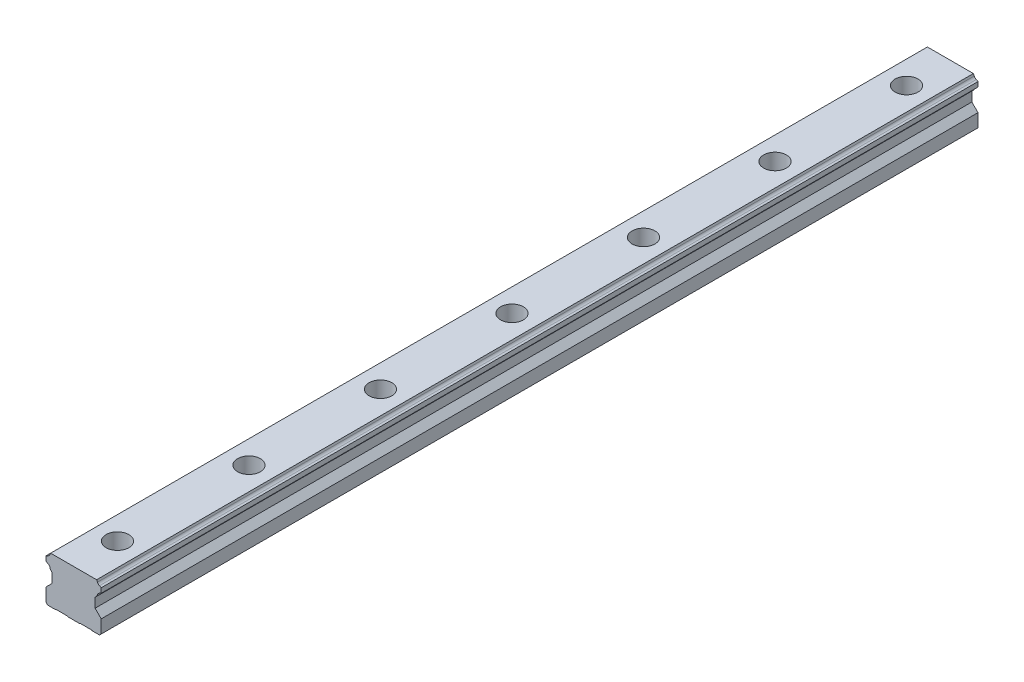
ISO-10303-21;
HEADER;
FILE_DESCRIPTION(('STEP AP214'),'2;1');
FILE_NAME('part.step','',(''),(''),'','','');
FILE_SCHEMA(('AUTOMOTIVE_DESIGN { 1 0 10303 214 1 1 1 1 }'));
ENDSEC;
DATA;
#1=APPLICATION_CONTEXT('core data for automotive mechanical design processes');
#2=APPLICATION_PROTOCOL_DEFINITION('international standard','automotive_design',2000,#1);
#3=PRODUCT_CONTEXT('',#1,'mechanical');
#4=PRODUCT('Part','Part','',(#3));
#5=PRODUCT_RELATED_PRODUCT_CATEGORY('part','',(#4));
#6=PRODUCT_DEFINITION_FORMATION('','',#4);
#7=PRODUCT_DEFINITION_CONTEXT('part definition',#1,'design');
#8=PRODUCT_DEFINITION('design','',#6,#7);
#9=PRODUCT_DEFINITION_SHAPE('','',#8);
#10=(LENGTH_UNIT() NAMED_UNIT(*) SI_UNIT(.MILLI.,.METRE.));
#11=(NAMED_UNIT(*) PLANE_ANGLE_UNIT() SI_UNIT($,.RADIAN.));
#12=(NAMED_UNIT(*) SI_UNIT($,.STERADIAN.) SOLID_ANGLE_UNIT());
#13=UNCERTAINTY_MEASURE_WITH_UNIT(LENGTH_MEASURE(1.E-05),#10,'distance_accuracy_value','');
#14=(GEOMETRIC_REPRESENTATION_CONTEXT(3) GLOBAL_UNCERTAINTY_ASSIGNED_CONTEXT((#13)) GLOBAL_UNIT_ASSIGNED_CONTEXT((#10,
#11,#12)) REPRESENTATION_CONTEXT('',''));
#15=CARTESIAN_POINT('',(0.,0.,0.));
#16=DIRECTION('',(0.,0.,1.));
#17=DIRECTION('',(1.,0.,0.));
#18=AXIS2_PLACEMENT_3D('',#15,#16,#17);
#19=CARTESIAN_POINT('',(-7.00000000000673,-6.72540824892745E-12,500.));
#20=DIRECTION('',(-0.707106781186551,-0.707106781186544,0.));
#21=DIRECTION('',(0.707106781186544,-0.707106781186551,0.));
#22=AXIS2_PLACEMENT_3D('',#19,#20,#21);
#23=PLANE('',#22);
#24=CARTESIAN_POINT('',(0.,-7.00000000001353,-450.));
#25=DIRECTION('',(-0.707106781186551,-0.707106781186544,0.));
#26=DIRECTION('',(-0.707106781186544,0.707106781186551,0.));
#27=AXIS2_PLACEMENT_3D('',#24,#25,#26);
#28=ELLIPSE('',#27,12.7279220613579,8.99999999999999);
#29=CARTESIAN_POINT('',(-7.35355339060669,0.353553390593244,-455.188954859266));
#30=VERTEX_POINT('',#29);
#31=CARTESIAN_POINT('',(-7.00000000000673,-6.7237881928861E-12,-455.656854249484));
#32=VERTEX_POINT('',#31);
#33=EDGE_CURVE('E1459',#30,#32,#28,.T.);
#34=ORIENTED_EDGE('',*,*,#33,.F.);
#35=DIRECTION('',(0.,0.,-1.));
#36=VECTOR('',#35,1.);
#37=CARTESIAN_POINT('',(-7.35355339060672,0.353553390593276,500.));
#38=LINE('',#37,#36);
#39=CARTESIAN_POINT('',(-7.35355339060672,0.353553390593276,-500.));
#40=VERTEX_POINT('',#39);
#41=EDGE_CURVE('E1043',#30,#40,#38,.T.);
#42=ORIENTED_EDGE('',*,*,#41,.T.);
#43=DIRECTION('',(-0.707106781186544,0.707106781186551,0.));
#44=VECTOR('',#43,1.);
#45=CARTESIAN_POINT('',(-7.00000000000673,-6.72540824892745E-12,-500.));
#46=LINE('',#45,#44);
#47=CARTESIAN_POINT('',(-7.00000000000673,-6.72540824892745E-12,-500.));
#48=VERTEX_POINT('',#47);
#49=EDGE_CURVE('E965',#48,#40,#46,.T.);
#50=ORIENTED_EDGE('',*,*,#49,.F.);
#51=DIRECTION('',(0.,0.,-1.));
#52=VECTOR('',#51,1.);
#53=CARTESIAN_POINT('',(-7.00000000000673,-6.72540824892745E-12,500.));
#54=LINE('',#53,#52);
#55=EDGE_CURVE('E549',#32,#48,#54,.T.);
#56=ORIENTED_EDGE('',*,*,#55,.F.);
#57=EDGE_LOOP('',(#34,#42,#50,#56));
#58=FACE_BOUND('',#57,.T.);
#59=ADVANCED_FACE('F35',(#58),#23,.T.);
#60=CARTESIAN_POINT('',(7.35355339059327,0.353553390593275,500.));
#61=DIRECTION('',(0.707106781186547,-0.707106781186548,0.));
#62=DIRECTION('',(0.707106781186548,0.707106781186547,0.));
#63=AXIS2_PLACEMENT_3D('',#60,#61,#62);
#64=PLANE('',#63);
#65=CARTESIAN_POINT('',(0.,-6.99999999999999,-450.));
#66=DIRECTION('',(0.707106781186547,-0.707106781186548,0.));
#67=DIRECTION('',(0.707106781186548,0.707106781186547,0.));
#68=AXIS2_PLACEMENT_3D('',#65,#66,#67);
#69=ELLIPSE('',#68,12.7279220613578,8.99999999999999);
#70=CARTESIAN_POINT('',(7.35355339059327,0.353553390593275,-444.811045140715));
#71=VERTEX_POINT('',#70);
#72=CARTESIAN_POINT('',(6.99999999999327,-6.7237881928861E-12,-444.343145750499));
#73=VERTEX_POINT('',#72);
#74=EDGE_CURVE('E510',#71,#73,#69,.T.);
#75=ORIENTED_EDGE('',*,*,#74,.F.);
#76=DIRECTION('',(0.,0.,-1.));
#77=VECTOR('',#76,1.);
#78=CARTESIAN_POINT('',(7.35355339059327,0.353553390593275,500.));
#79=LINE('',#78,#77);
#80=CARTESIAN_POINT('',(7.35355339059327,0.353553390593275,-305.188954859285));
#81=VERTEX_POINT('',#80);
#82=EDGE_CURVE('E1254',#81,#71,#79,.T.);
#83=ORIENTED_EDGE('',*,*,#82,.F.);
#84=CARTESIAN_POINT('',(0.,-6.99999999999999,-300.));
#85=DIRECTION('',(0.707106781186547,-0.707106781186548,0.));
#86=DIRECTION('',(0.707106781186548,0.707106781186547,0.));
#87=AXIS2_PLACEMENT_3D('',#84,#85,#86);
#88=ELLIPSE('',#87,12.7279220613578,8.99999999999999);
#89=CARTESIAN_POINT('',(6.99999999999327,-6.7237881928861E-12,-305.656854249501));
#90=VERTEX_POINT('',#89);
#91=EDGE_CURVE('E538',#90,#81,#88,.T.);
#92=ORIENTED_EDGE('',*,*,#91,.F.);
#93=DIRECTION('',(0.,0.,-1.));
#94=VECTOR('',#93,1.);
#95=CARTESIAN_POINT('',(6.99999999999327,-6.72540824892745E-12,500.));
#96=LINE('',#95,#94);
#97=EDGE_CURVE('E530',#90,#73,#96,.T.);
#98=ORIENTED_EDGE('',*,*,#97,.T.);
#99=EDGE_LOOP('',(#75,#83,#92,#98));
#100=FACE_BOUND('',#99,.T.);
#101=ADVANCED_FACE('F537',(#100),#64,.T.);
#102=CARTESIAN_POINT('',(6.99999999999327,-6.72540824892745E-12,500.));
#103=DIRECTION('',(0.,-1.,0.));
#104=DIRECTION('',(0.,0.,-1.));
#105=AXIS2_PLACEMENT_3D('',#102,#103,#104);
#106=PLANE('',#105);
#107=CARTESIAN_POINT('',(6.99999999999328,-6.7237881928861E-12,-455.656854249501));
#108=VERTEX_POINT('',#107);
#109=CARTESIAN_POINT('',(6.99999999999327,-6.72540824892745E-12,-500.));
#110=VERTEX_POINT('',#109);
#111=EDGE_CURVE('E540',#108,#110,#96,.T.);
#112=ORIENTED_EDGE('',*,*,#111,.F.);
#113=CARTESIAN_POINT('',(0.,-6.7237881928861E-12,-450.));
#114=DIRECTION('',(0.,1.,0.));
#115=DIRECTION('',(0.,0.,1.));
#116=AXIS2_PLACEMENT_3D('',#113,#114,#115);
#117=CIRCLE('',#116,8.99999999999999);
#118=EDGE_CURVE('E533',#108,#32,#117,.T.);
#119=ORIENTED_EDGE('',*,*,#118,.T.);
#120=ORIENTED_EDGE('',*,*,#55,.T.);
#121=DIRECTION('',(-1.,0.,0.));
#122=VECTOR('',#121,1.);
#123=CARTESIAN_POINT('',(6.99999999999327,-6.72540824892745E-12,-500.));
#124=LINE('',#123,#122);
#125=EDGE_CURVE('E962',#110,#48,#124,.T.);
#126=ORIENTED_EDGE('',*,*,#125,.F.);
#127=EDGE_LOOP('',(#112,#119,#120,#126));
#128=FACE_BOUND('',#127,.T.);
#129=ADVANCED_FACE('F1379',(#128),#106,.T.);
#130=CARTESIAN_POINT('',(-7.00000000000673,-6.7242218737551E-12,-305.656854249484));
#131=VERTEX_POINT('',#130);
#132=CARTESIAN_POINT('',(-7.00000000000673,-6.7237881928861E-12,-444.343145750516));
#133=VERTEX_POINT('',#132);
#134=EDGE_CURVE('E532',#131,#133,#54,.T.);
#135=ORIENTED_EDGE('',*,*,#134,.T.);
#136=EDGE_CURVE('E514',#133,#73,#117,.T.);
#137=ORIENTED_EDGE('',*,*,#136,.T.);
#138=ORIENTED_EDGE('',*,*,#97,.F.);
#139=CARTESIAN_POINT('',(0.,-6.7237881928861E-12,-300.));
#140=DIRECTION('',(0.,1.,0.));
#141=DIRECTION('',(0.,0.,1.));
#142=AXIS2_PLACEMENT_3D('',#139,#140,#141);
#143=CIRCLE('',#142,8.99999999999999);
#144=EDGE_CURVE('E773',#90,#131,#143,.T.);
#145=ORIENTED_EDGE('',*,*,#144,.T.);
#146=EDGE_LOOP('',(#135,#137,#138,#145));
#147=FACE_BOUND('',#146,.T.);
#148=ADVANCED_FACE('F528',(#147),#106,.T.);
#149=CARTESIAN_POINT('',(7.70710678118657,0.,500.));
#150=DIRECTION('',(0.,0.,-1.));
#151=DIRECTION('',(-1.,0.,0.));
#152=AXIS2_PLACEMENT_3D('',#149,#150,#151);
#153=CYLINDRICAL_SURFACE('',#152,0.500000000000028);
#154=CARTESIAN_POINT('',(7.70710678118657,0.500000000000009,-445.3523656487));
#155=CARTESIAN_POINT('',(7.68495955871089,0.499978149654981,-445.315633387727));
#156=CARTESIAN_POINT('',(7.66252883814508,0.498525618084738,-445.279036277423));
#157=CARTESIAN_POINT('',(7.61717191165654,0.492386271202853,-445.206199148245));
#158=CARTESIAN_POINT('',(7.59424392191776,0.487684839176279,-445.169961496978));
#159=CARTESIAN_POINT('',(7.54883351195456,0.474856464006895,-445.099303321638));
#160=CARTESIAN_POINT('',(7.52635736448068,0.466832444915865,-445.064860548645));
#161=CARTESIAN_POINT('',(7.48150511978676,0.446884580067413,-444.997128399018));
#162=CARTESIAN_POINT('',(7.45912891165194,0.434968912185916,-444.963836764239));
#163=CARTESIAN_POINT('',(7.42282527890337,0.411664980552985,-444.910569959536));
#164=CARTESIAN_POINT('',(7.40875089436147,0.401625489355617,-444.89010801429));
#165=CARTESIAN_POINT('',(7.38086754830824,0.37932322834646,-444.849912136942));
#166=CARTESIAN_POINT('',(7.36706220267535,0.367040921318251,-444.830186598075));
#167=CARTESIAN_POINT('',(7.35355339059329,0.353553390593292,-444.811045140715));
#168=B_SPLINE_CURVE_WITH_KNOTS('',3,(#154,#155,#156,#157,#158,#159,#160,#161,#162,#163,#164,
#165,#166,#167),.UNSPECIFIED.,.F.,.F.,(4,2,2,2,2,2,4),(0.,0.128699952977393,0.257982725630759,
0.383529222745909,0.508813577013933,0.589083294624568,0.670088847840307),.UNSPECIFIED.);
#169=CARTESIAN_POINT('',(7.70710678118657,0.500000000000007,-445.352365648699));
#170=VERTEX_POINT('',#169);
#171=EDGE_CURVE('E517',#170,#71,#168,.T.);
#172=ORIENTED_EDGE('',*,*,#171,.F.);
#173=DIRECTION('',(0.,0.,-1.));
#174=VECTOR('',#173,1.);
#175=CARTESIAN_POINT('',(7.70710678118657,0.500000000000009,500.));
#176=LINE('',#175,#174);
#177=CARTESIAN_POINT('',(7.70710678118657,0.500000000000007,-304.6476343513));
#178=VERTEX_POINT('',#177);
#179=EDGE_CURVE('E1274',#178,#170,#176,.T.);
#180=ORIENTED_EDGE('',*,*,#179,.F.);
#181=CARTESIAN_POINT('',(7.35355339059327,0.353553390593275,-305.188954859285));
#182=CARTESIAN_POINT('',(7.36752516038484,0.367500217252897,-305.169157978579));
#183=CARTESIAN_POINT('',(7.38181386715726,0.38016165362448,-305.148735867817));
#184=CARTESIAN_POINT('',(7.41078040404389,0.403157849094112,-305.106953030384));
#185=CARTESIAN_POINT('',(7.42545733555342,0.413497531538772,-305.085594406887));
#186=CARTESIAN_POINT('',(7.45478656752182,0.432006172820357,-305.042502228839));
#187=CARTESIAN_POINT('',(7.46943567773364,0.440206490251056,-305.020779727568));
#188=CARTESIAN_POINT('',(7.49881611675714,0.454845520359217,-304.97679188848));
#189=CARTESIAN_POINT('',(7.51354748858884,0.461283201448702,-304.95452624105));
#190=CARTESIAN_POINT('',(7.55825222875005,0.478409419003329,-304.886287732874));
#191=CARTESIAN_POINT('',(7.5882036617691,0.486591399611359,-304.839654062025));
#192=CARTESIAN_POINT('',(7.63290172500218,0.494698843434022,-304.768607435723));
#193=CARTESIAN_POINT('',(7.64788491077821,0.496705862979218,-304.744540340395));
#194=CARTESIAN_POINT('',(7.67765166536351,0.499354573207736,-304.696218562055));
#195=CARTESIAN_POINT('',(7.69243529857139,0.499996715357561,-304.671963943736));
#196=CARTESIAN_POINT('',(7.70710678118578,0.500000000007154,-304.647634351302));
#197=B_SPLINE_CURVE_WITH_KNOTS('',3,(#181,#182,#183,#184,#185,#186,#187,#188,#189,#190,#191,
#192,#193,#194,#195,#196),.UNSPECIFIED.,.F.,.F.,(4,2,2,2,2,2,2,4),(0.,0.0837771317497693,
0.167374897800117,0.249668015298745,0.332009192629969,0.499664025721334,0.584902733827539,
0.67011324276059),.UNSPECIFIED.);
#198=EDGE_CURVE('E62',#81,#178,#197,.T.);
#199=ORIENTED_EDGE('',*,*,#198,.F.);
#200=ORIENTED_EDGE('',*,*,#82,.T.);
#201=EDGE_LOOP('',(#172,#180,#199,#200));
#202=FACE_BOUND('',#201,.T.);
#203=ADVANCED_FACE('F1429',(#202),#153,.F.);
#204=CARTESIAN_POINT('',(-7.7071067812,0.,500.));
#205=DIRECTION('',(0.,0.,-1.));
#206=DIRECTION('',(-1.,0.,0.));
#207=AXIS2_PLACEMENT_3D('',#204,#205,#206);
#208=CYLINDRICAL_SURFACE('',#207,0.500000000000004);
#209=CARTESIAN_POINT('',(-7.35355339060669,0.353553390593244,-444.811045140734));
#210=CARTESIAN_POINT('',(-7.36752516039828,0.367500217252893,-444.83084202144));
#211=CARTESIAN_POINT('',(-7.38181386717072,0.380161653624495,-444.851264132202));
#212=CARTESIAN_POINT('',(-7.4107804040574,0.403157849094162,-444.893046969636));
#213=CARTESIAN_POINT('',(-7.42545733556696,0.413497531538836,-444.914405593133));
#214=CARTESIAN_POINT('',(-7.4547865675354,0.432006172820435,-444.957497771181));
#215=CARTESIAN_POINT('',(-7.46943567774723,0.440206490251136,-444.979220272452));
#216=CARTESIAN_POINT('',(-7.49881611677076,0.454845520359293,-445.023208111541));
#217=CARTESIAN_POINT('',(-7.51354748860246,0.461283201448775,-445.04547375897));
#218=CARTESIAN_POINT('',(-7.55825222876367,0.478409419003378,-445.113712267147));
#219=CARTESIAN_POINT('',(-7.58820366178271,0.486591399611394,-445.160345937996));
#220=CARTESIAN_POINT('',(-7.63290172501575,0.494698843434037,-445.231392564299));
#221=CARTESIAN_POINT('',(-7.64788491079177,0.496705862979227,-445.255459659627));
#222=CARTESIAN_POINT('',(-7.67765166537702,0.499354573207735,-445.303781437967));
#223=CARTESIAN_POINT('',(-7.69243529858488,0.499996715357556,-445.328036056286));
#224=CARTESIAN_POINT('',(-7.70710678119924,0.500000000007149,-445.35236564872));
#225=B_SPLINE_CURVE_WITH_KNOTS('',3,(#209,#210,#211,#212,#213,#214,#215,#216,#217,#218,#219,
#220,#221,#222,#223,#224),.UNSPECIFIED.,.F.,.F.,(4,2,2,2,2,2,2,4),(0.,0.0837771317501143,
0.167374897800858,0.249668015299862,0.332009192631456,0.499664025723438,0.584902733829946,
0.670113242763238),.UNSPECIFIED.);
#226=CARTESIAN_POINT('',(-7.35355339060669,0.353553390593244,-444.811045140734));
#227=VERTEX_POINT('',#226);
#228=CARTESIAN_POINT('',(-7.7071067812,0.499999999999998,-445.352365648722));
#229=VERTEX_POINT('',#228);
#230=EDGE_CURVE('E11',#227,#229,#225,.T.);
#231=ORIENTED_EDGE('',*,*,#230,.F.);
#232=CARTESIAN_POINT('',(-7.35355339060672,0.353553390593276,-305.188954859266));
#233=VERTEX_POINT('',#232);
#234=EDGE_CURVE('E1049',#233,#227,#38,.T.);
#235=ORIENTED_EDGE('',*,*,#234,.F.);
#236=CARTESIAN_POINT('',(-7.7071067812,0.500000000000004,-304.647634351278));
#237=CARTESIAN_POINT('',(-7.68495955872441,0.499978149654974,-304.68436661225));
#238=CARTESIAN_POINT('',(-7.66252883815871,0.498525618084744,-304.720963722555));
#239=CARTESIAN_POINT('',(-7.6171719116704,0.492386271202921,-304.793800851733));
#240=CARTESIAN_POINT('',(-7.59424392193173,0.487684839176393,-304.830038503));
#241=CARTESIAN_POINT('',(-7.54883351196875,0.474856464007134,-304.90069667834));
#242=CARTESIAN_POINT('',(-7.52635736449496,0.466832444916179,-304.935139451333));
#243=CARTESIAN_POINT('',(-7.48150511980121,0.446884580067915,-305.002871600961));
#244=CARTESIAN_POINT('',(-7.45912891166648,0.43496891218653,-305.036163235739));
#245=CARTESIAN_POINT('',(-7.42282527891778,0.411664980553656,-305.089430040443));
#246=CARTESIAN_POINT('',(-7.40875089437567,0.401625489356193,-305.109891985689));
#247=CARTESIAN_POINT('',(-7.38086754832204,0.379323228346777,-305.150087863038));
#248=CARTESIAN_POINT('',(-7.36706220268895,0.367040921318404,-305.169813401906));
#249=CARTESIAN_POINT('',(-7.35355339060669,0.353553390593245,-305.188954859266));
#250=B_SPLINE_CURVE_WITH_KNOTS('',3,(#236,#237,#238,#239,#240,#241,#242,#243,#244,#245,#246,
#247,#248,#249),.UNSPECIFIED.,.F.,.F.,(4,2,2,2,2,2,4),(0.,0.128699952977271,0.257982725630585,
0.38352922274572,0.508813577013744,0.589083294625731,0.670088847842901),.UNSPECIFIED.);
#251=CARTESIAN_POINT('',(-7.7071067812,0.500000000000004,-304.647634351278));
#252=VERTEX_POINT('',#251);
#253=EDGE_CURVE('E716',#252,#233,#250,.T.);
#254=ORIENTED_EDGE('',*,*,#253,.F.);
#255=DIRECTION('',(0.,0.,-1.));
#256=VECTOR('',#255,1.);
#257=CARTESIAN_POINT('',(-7.7071067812,0.500000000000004,500.));
#258=LINE('',#257,#256);
#259=EDGE_CURVE('E1046',#252,#229,#258,.T.);
#260=ORIENTED_EDGE('',*,*,#259,.T.);
#261=EDGE_LOOP('',(#231,#235,#254,#260));
#262=FACE_BOUND('',#261,.T.);
#263=ADVANCED_FACE('F645',(#262),#208,.F.);
#264=CARTESIAN_POINT('',(7.35355339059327,0.353553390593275,-294.811045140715));
#265=VERTEX_POINT('',#264);
#266=CARTESIAN_POINT('',(6.99999999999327,-6.7237881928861E-12,-294.343145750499));
#267=VERTEX_POINT('',#266);
#268=EDGE_CURVE('E1239',#265,#267,#88,.T.);
#269=ORIENTED_EDGE('',*,*,#268,.F.);
#270=CARTESIAN_POINT('',(7.35355339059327,0.353553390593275,-155.188954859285));
#271=VERTEX_POINT('',#270);
#272=EDGE_CURVE('E1250',#271,#265,#79,.T.);
#273=ORIENTED_EDGE('',*,*,#272,.F.);
#274=CARTESIAN_POINT('',(0.,-6.99999999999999,-150.));
#275=DIRECTION('',(0.707106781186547,-0.707106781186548,0.));
#276=DIRECTION('',(0.707106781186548,0.707106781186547,0.));
#277=AXIS2_PLACEMENT_3D('',#274,#275,#276);
#278=ELLIPSE('',#277,12.7279220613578,8.99999999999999);
#279=CARTESIAN_POINT('',(6.99999999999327,-6.7237881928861E-12,-155.656854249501));
#280=VERTEX_POINT('',#279);
#281=EDGE_CURVE('E1188',#280,#271,#278,.T.);
#282=ORIENTED_EDGE('',*,*,#281,.F.);
#283=EDGE_CURVE('E539',#280,#267,#96,.T.);
#284=ORIENTED_EDGE('',*,*,#283,.T.);
#285=EDGE_LOOP('',(#269,#273,#282,#284));
#286=FACE_BOUND('',#285,.T.);
#287=ADVANCED_FACE('F1249',(#286),#64,.T.);
#288=EDGE_CURVE('E754',#133,#227,#28,.T.);
#289=ORIENTED_EDGE('',*,*,#288,.F.);
#290=ORIENTED_EDGE('',*,*,#134,.F.);
#291=CARTESIAN_POINT('',(0.,-7.00000000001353,-300.));
#292=DIRECTION('',(-0.707106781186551,-0.707106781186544,0.));
#293=DIRECTION('',(-0.707106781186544,0.707106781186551,0.));
#294=AXIS2_PLACEMENT_3D('',#291,#292,#293);
#295=ELLIPSE('',#294,12.7279220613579,8.99999999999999);
#296=EDGE_CURVE('E1236',#233,#131,#295,.T.);
#297=ORIENTED_EDGE('',*,*,#296,.F.);
#298=ORIENTED_EDGE('',*,*,#234,.T.);
#299=EDGE_LOOP('',(#289,#290,#297,#298));
#300=FACE_BOUND('',#299,.T.);
#301=ADVANCED_FACE('F1375',(#300),#23,.T.);
#302=CARTESIAN_POINT('',(-7.35355339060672,0.353553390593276,-294.811045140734));
#303=CARTESIAN_POINT('',(-7.36752516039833,0.367500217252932,-294.83084202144));
#304=CARTESIAN_POINT('',(-7.38181386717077,0.380161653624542,-294.851264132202));
#305=CARTESIAN_POINT('',(-7.41078040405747,0.403157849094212,-294.893046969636));
#306=CARTESIAN_POINT('',(-7.42545733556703,0.413497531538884,-294.914405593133));
#307=CARTESIAN_POINT('',(-7.45478656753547,0.432006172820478,-294.957497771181));
#308=CARTESIAN_POINT('',(-7.46943567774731,0.440206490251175,-294.979220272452));
#309=CARTESIAN_POINT('',(-7.49881611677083,0.454845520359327,-295.023208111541));
#310=CARTESIAN_POINT('',(-7.51354748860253,0.461283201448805,-295.04547375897));
#311=CARTESIAN_POINT('',(-7.55825222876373,0.478409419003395,-295.113712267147));
#312=CARTESIAN_POINT('',(-7.58820366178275,0.486591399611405,-295.160345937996));
#313=CARTESIAN_POINT('',(-7.63290172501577,0.494698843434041,-295.231392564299));
#314=CARTESIAN_POINT('',(-7.64788491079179,0.496705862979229,-295.255459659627));
#315=CARTESIAN_POINT('',(-7.67765166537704,0.499354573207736,-295.303781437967));
#316=CARTESIAN_POINT('',(-7.69243529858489,0.499996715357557,-295.328036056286));
#317=CARTESIAN_POINT('',(-7.70710678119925,0.500000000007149,-295.352365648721));
#318=B_SPLINE_CURVE_WITH_KNOTS('',3,(#302,#303,#304,#305,#306,#307,#308,#309,#310,#311,#312,
#313,#314,#315,#316,#317),.UNSPECIFIED.,.F.,.F.,(4,2,2,2,2,2,2,4),(0.,0.0837771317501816,
0.167374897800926,0.249668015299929,0.332009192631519,0.499664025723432,0.584902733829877,
0.670113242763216),.UNSPECIFIED.);
#319=CARTESIAN_POINT('',(-7.35355339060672,0.353553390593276,-294.811045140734));
#320=VERTEX_POINT('',#319);
#321=CARTESIAN_POINT('',(-7.7071067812,0.499999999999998,-295.352365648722));
#322=VERTEX_POINT('',#321);
#323=EDGE_CURVE('E724',#320,#322,#318,.T.);
#324=ORIENTED_EDGE('',*,*,#323,.F.);
#325=CARTESIAN_POINT('',(-7.35355339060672,0.353553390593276,-155.188954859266));
#326=VERTEX_POINT('',#325);
#327=EDGE_CURVE('E1056',#326,#320,#38,.T.);
#328=ORIENTED_EDGE('',*,*,#327,.F.);
#329=CARTESIAN_POINT('',(-7.7071067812,0.500000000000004,-154.647634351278));
#330=CARTESIAN_POINT('',(-7.68495955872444,0.499978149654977,-154.68436661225));
#331=CARTESIAN_POINT('',(-7.66252883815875,0.498525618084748,-154.720963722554));
#332=CARTESIAN_POINT('',(-7.61717191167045,0.492386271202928,-154.793800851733));
#333=CARTESIAN_POINT('',(-7.59424392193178,0.487684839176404,-154.830038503));
#334=CARTESIAN_POINT('',(-7.54883351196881,0.474856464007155,-154.90069667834));
#335=CARTESIAN_POINT('',(-7.52635736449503,0.466832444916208,-154.935139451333));
#336=CARTESIAN_POINT('',(-7.48150511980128,0.44688458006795,-155.002871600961));
#337=CARTESIAN_POINT('',(-7.45912891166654,0.434968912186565,-155.036163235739));
#338=CARTESIAN_POINT('',(-7.42282527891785,0.411664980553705,-155.089430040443));
#339=CARTESIAN_POINT('',(-7.40875089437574,0.401625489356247,-155.109891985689));
#340=CARTESIAN_POINT('',(-7.38086754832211,0.379323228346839,-155.150087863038));
#341=CARTESIAN_POINT('',(-7.36706220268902,0.36704092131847,-155.169813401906));
#342=CARTESIAN_POINT('',(-7.35355339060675,0.353553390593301,-155.188954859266));
#343=B_SPLINE_CURVE_WITH_KNOTS('',3,(#329,#330,#331,#332,#333,#334,#335,#336,#337,#338,#339,
#340,#341,#342),.UNSPECIFIED.,.F.,.F.,(4,2,2,2,2,2,4),(0.,0.128699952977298,0.257982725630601,
0.383529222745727,0.50881357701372,0.589083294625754,0.670088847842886),.UNSPECIFIED.);
#344=CARTESIAN_POINT('',(-7.7071067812,0.500000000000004,-154.647634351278));
#345=VERTEX_POINT('',#344);
#346=EDGE_CURVE('E699',#345,#326,#343,.T.);
#347=ORIENTED_EDGE('',*,*,#346,.F.);
#348=EDGE_CURVE('E1232',#345,#322,#258,.T.);
#349=ORIENTED_EDGE('',*,*,#348,.T.);
#350=EDGE_LOOP('',(#324,#328,#347,#349));
#351=FACE_BOUND('',#350,.T.);
#352=ADVANCED_FACE('F1229',(#351),#208,.F.);
#353=CARTESIAN_POINT('',(-7.00000000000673,-6.7237881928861E-12,-155.656854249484));
#354=VERTEX_POINT('',#353);
#355=CARTESIAN_POINT('',(-7.00000000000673,-6.7237881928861E-12,-294.343145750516));
#356=VERTEX_POINT('',#355);
#357=EDGE_CURVE('E1066',#354,#356,#54,.T.);
#358=ORIENTED_EDGE('',*,*,#357,.T.);
#359=EDGE_CURVE('E770',#356,#267,#143,.T.);
#360=ORIENTED_EDGE('',*,*,#359,.T.);
#361=ORIENTED_EDGE('',*,*,#283,.F.);
#362=CARTESIAN_POINT('',(0.,-6.7237881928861E-12,-150.));
#363=DIRECTION('',(0.,1.,0.));
#364=DIRECTION('',(0.,0.,1.));
#365=AXIS2_PLACEMENT_3D('',#362,#363,#364);
#366=CIRCLE('',#365,8.99999999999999);
#367=EDGE_CURVE('E1179',#280,#354,#366,.T.);
#368=ORIENTED_EDGE('',*,*,#367,.T.);
#369=EDGE_LOOP('',(#358,#360,#361,#368));
#370=FACE_BOUND('',#369,.T.);
#371=ADVANCED_FACE('F1425',(#370),#106,.T.);
#372=CARTESIAN_POINT('',(7.70710678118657,0.500000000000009,-295.3523656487));
#373=CARTESIAN_POINT('',(7.68495955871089,0.499978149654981,-295.315633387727));
#374=CARTESIAN_POINT('',(7.66252883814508,0.498525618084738,-295.279036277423));
#375=CARTESIAN_POINT('',(7.61717191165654,0.492386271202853,-295.206199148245));
#376=CARTESIAN_POINT('',(7.59424392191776,0.487684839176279,-295.169961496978));
#377=CARTESIAN_POINT('',(7.54883351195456,0.474856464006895,-295.099303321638));
#378=CARTESIAN_POINT('',(7.52635736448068,0.466832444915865,-295.064860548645));
#379=CARTESIAN_POINT('',(7.48150511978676,0.446884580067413,-294.997128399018));
#380=CARTESIAN_POINT('',(7.45912891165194,0.434968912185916,-294.963836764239));
#381=CARTESIAN_POINT('',(7.42282527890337,0.411664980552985,-294.910569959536));
#382=CARTESIAN_POINT('',(7.40875089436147,0.401625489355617,-294.89010801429));
#383=CARTESIAN_POINT('',(7.38086754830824,0.37932322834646,-294.849912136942));
#384=CARTESIAN_POINT('',(7.36706220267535,0.367040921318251,-294.830186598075));
#385=CARTESIAN_POINT('',(7.35355339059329,0.353553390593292,-294.811045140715));
#386=B_SPLINE_CURVE_WITH_KNOTS('',3,(#372,#373,#374,#375,#376,#377,#378,#379,#380,#381,#382,
#383,#384,#385),.UNSPECIFIED.,.F.,.F.,(4,2,2,2,2,2,4),(0.,0.128699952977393,0.257982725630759,
0.383529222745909,0.508813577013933,0.589083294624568,0.670088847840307),.UNSPECIFIED.);
#387=CARTESIAN_POINT('',(7.70710678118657,0.500000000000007,-295.3523656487));
#388=VERTEX_POINT('',#387);
#389=EDGE_CURVE('E778',#388,#265,#386,.T.);
#390=ORIENTED_EDGE('',*,*,#389,.F.);
#391=CARTESIAN_POINT('',(7.70710678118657,0.500000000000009,-154.6476343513));
#392=VERTEX_POINT('',#391);
#393=EDGE_CURVE('E1275',#392,#388,#176,.T.);
#394=ORIENTED_EDGE('',*,*,#393,.F.);
#395=CARTESIAN_POINT('',(7.35355339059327,0.353553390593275,-155.188954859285));
#396=CARTESIAN_POINT('',(7.36752516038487,0.36750021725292,-155.169157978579));
#397=CARTESIAN_POINT('',(7.38181386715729,0.380161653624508,-155.148735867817));
#398=CARTESIAN_POINT('',(7.41078040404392,0.403157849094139,-155.106953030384));
#399=CARTESIAN_POINT('',(7.42545733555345,0.413497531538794,-155.085594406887));
#400=CARTESIAN_POINT('',(7.45478656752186,0.432006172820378,-155.042502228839));
#401=CARTESIAN_POINT('',(7.46943567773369,0.440206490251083,-155.020779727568));
#402=CARTESIAN_POINT('',(7.49881611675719,0.454845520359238,-154.97679188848));
#403=CARTESIAN_POINT('',(7.51354748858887,0.461283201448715,-154.95452624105));
#404=CARTESIAN_POINT('',(7.55825222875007,0.478409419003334,-154.886287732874));
#405=CARTESIAN_POINT('',(7.58820366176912,0.486591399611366,-154.839654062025));
#406=CARTESIAN_POINT('',(7.63290172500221,0.494698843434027,-154.768607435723));
#407=CARTESIAN_POINT('',(7.64788491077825,0.496705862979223,-154.744540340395));
#408=CARTESIAN_POINT('',(7.67765166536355,0.499354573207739,-154.696218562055));
#409=CARTESIAN_POINT('',(7.69243529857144,0.499996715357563,-154.671963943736));
#410=CARTESIAN_POINT('',(7.70710678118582,0.500000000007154,-154.647634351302));
#411=B_SPLINE_CURVE_WITH_KNOTS('',3,(#395,#396,#397,#398,#399,#400,#401,#402,#403,#404,#405,
#406,#407,#408,#409,#410),.UNSPECIFIED.,.F.,.F.,(4,2,2,2,2,2,2,4),(0.,0.0837771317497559,
0.167374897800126,0.249668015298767,0.332009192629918,0.499664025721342,0.584902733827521,
0.670113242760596),.UNSPECIFIED.);
#412=EDGE_CURVE('E806',#271,#392,#411,.T.);
#413=ORIENTED_EDGE('',*,*,#412,.F.);
#414=ORIENTED_EDGE('',*,*,#272,.T.);
#415=EDGE_LOOP('',(#390,#394,#413,#414));
#416=FACE_BOUND('',#415,.T.);
#417=ADVANCED_FACE('F1252',(#416),#153,.F.);
#418=CARTESIAN_POINT('',(7.35355339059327,0.353553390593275,-144.811045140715));
#419=VERTEX_POINT('',#418);
#420=CARTESIAN_POINT('',(6.99999999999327,-6.7237881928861E-12,-144.343145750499));
#421=VERTEX_POINT('',#420);
#422=EDGE_CURVE('E1174',#419,#421,#278,.T.);
#423=ORIENTED_EDGE('',*,*,#422,.F.);
#424=CARTESIAN_POINT('',(7.35355339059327,0.353553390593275,-5.18895485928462));
#425=VERTEX_POINT('',#424);
#426=EDGE_CURVE('E1253',#425,#419,#79,.T.);
#427=ORIENTED_EDGE('',*,*,#426,.F.);
#428=CARTESIAN_POINT('',(0.,-6.99999999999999,0.));
#429=DIRECTION('',(0.707106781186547,-0.707106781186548,0.));
#430=DIRECTION('',(0.707106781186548,0.707106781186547,0.));
#431=AXIS2_PLACEMENT_3D('',#428,#429,#430);
#432=ELLIPSE('',#431,12.7279220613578,8.99999999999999);
#433=CARTESIAN_POINT('',(6.99999999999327,-6.7237881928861E-12,-5.65685424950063));
#434=VERTEX_POINT('',#433);
#435=EDGE_CURVE('E1126',#434,#425,#432,.T.);
#436=ORIENTED_EDGE('',*,*,#435,.F.);
#437=EDGE_CURVE('E543',#434,#421,#96,.T.);
#438=ORIENTED_EDGE('',*,*,#437,.T.);
#439=EDGE_LOOP('',(#423,#427,#436,#438));
#440=FACE_BOUND('',#439,.T.);
#441=ADVANCED_FACE('F1172',(#440),#64,.T.);
#442=EDGE_CURVE('E1226',#356,#320,#295,.T.);
#443=ORIENTED_EDGE('',*,*,#442,.F.);
#444=ORIENTED_EDGE('',*,*,#357,.F.);
#445=CARTESIAN_POINT('',(0.,-7.00000000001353,-150.));
#446=DIRECTION('',(-0.707106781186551,-0.707106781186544,0.));
#447=DIRECTION('',(-0.707106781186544,0.707106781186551,0.));
#448=AXIS2_PLACEMENT_3D('',#445,#446,#447);
#449=ELLIPSE('',#448,12.7279220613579,8.99999999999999);
#450=EDGE_CURVE('E1193',#326,#354,#449,.T.);
#451=ORIENTED_EDGE('',*,*,#450,.F.);
#452=ORIENTED_EDGE('',*,*,#327,.T.);
#453=EDGE_LOOP('',(#443,#444,#451,#452));
#454=FACE_BOUND('',#453,.T.);
#455=ADVANCED_FACE('F1225',(#454),#23,.T.);
#456=CARTESIAN_POINT('',(-7.00000000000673,-6.7237881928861E-12,-5.65685424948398));
#457=VERTEX_POINT('',#456);
#458=CARTESIAN_POINT('',(-7.00000000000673,-6.7237881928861E-12,-144.343145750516));
#459=VERTEX_POINT('',#458);
#460=EDGE_CURVE('E1068',#457,#459,#54,.T.);
#461=ORIENTED_EDGE('',*,*,#460,.T.);
#462=EDGE_CURVE('E1177',#459,#421,#366,.T.);
#463=ORIENTED_EDGE('',*,*,#462,.T.);
#464=ORIENTED_EDGE('',*,*,#437,.F.);
#465=CARTESIAN_POINT('',(0.,-6.7237881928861E-12,0.));
#466=DIRECTION('',(0.,1.,0.));
#467=DIRECTION('',(0.,0.,1.));
#468=AXIS2_PLACEMENT_3D('',#465,#466,#467);
#469=CIRCLE('',#468,8.99999999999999);
#470=EDGE_CURVE('E1162',#434,#457,#469,.T.);
#471=ORIENTED_EDGE('',*,*,#470,.T.);
#472=EDGE_LOOP('',(#461,#463,#464,#471));
#473=FACE_BOUND('',#472,.T.);
#474=ADVANCED_FACE('F1176',(#473),#106,.T.);
#475=CARTESIAN_POINT('',(-7.35355339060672,0.353553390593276,-144.811045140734));
#476=CARTESIAN_POINT('',(-7.36752516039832,0.367500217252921,-144.83084202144));
#477=CARTESIAN_POINT('',(-7.38181386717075,0.380161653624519,-144.851264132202));
#478=CARTESIAN_POINT('',(-7.41078040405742,0.403157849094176,-144.893046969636));
#479=CARTESIAN_POINT('',(-7.42545733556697,0.413497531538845,-144.914405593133));
#480=CARTESIAN_POINT('',(-7.45478656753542,0.432006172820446,-144.957497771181));
#481=CARTESIAN_POINT('',(-7.46943567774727,0.440206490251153,-144.979220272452));
#482=CARTESIAN_POINT('',(-7.49881611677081,0.454845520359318,-145.023208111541));
#483=CARTESIAN_POINT('',(-7.51354748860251,0.461283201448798,-145.04547375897));
#484=CARTESIAN_POINT('',(-7.55825222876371,0.478409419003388,-145.113712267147));
#485=CARTESIAN_POINT('',(-7.58820366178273,0.4865913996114,-145.160345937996));
#486=CARTESIAN_POINT('',(-7.63290172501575,0.494698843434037,-145.231392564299));
#487=CARTESIAN_POINT('',(-7.64788491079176,0.496705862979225,-145.255459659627));
#488=CARTESIAN_POINT('',(-7.677651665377,0.499354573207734,-145.303781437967));
#489=CARTESIAN_POINT('',(-7.69243529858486,0.499996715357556,-145.328036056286));
#490=CARTESIAN_POINT('',(-7.70710678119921,0.500000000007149,-145.35236564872));
#491=B_SPLINE_CURVE_WITH_KNOTS('',3,(#475,#476,#477,#478,#479,#480,#481,#482,#483,#484,#485,
#486,#487,#488,#489,#490),.UNSPECIFIED.,.F.,.F.,(4,2,2,2,2,2,2,4),(0.,0.0837771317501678,
0.167374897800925,0.249668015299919,0.332009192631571,0.499664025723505,0.584902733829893,
0.670113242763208),.UNSPECIFIED.);
#492=CARTESIAN_POINT('',(-7.35355339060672,0.353553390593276,-144.811045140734));
#493=VERTEX_POINT('',#492);
#494=CARTESIAN_POINT('',(-7.7071067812,0.499999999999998,-145.352365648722));
#495=VERTEX_POINT('',#494);
#496=EDGE_CURVE('E708',#493,#495,#491,.T.);
#497=ORIENTED_EDGE('',*,*,#496,.F.);
#498=CARTESIAN_POINT('',(-7.35355339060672,0.353553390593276,-5.18895485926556));
#499=VERTEX_POINT('',#498);
#500=EDGE_CURVE('E1217',#499,#493,#38,.T.);
#501=ORIENTED_EDGE('',*,*,#500,.F.);
#502=CARTESIAN_POINT('',(-7.7071067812,0.500000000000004,-4.64763435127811));
#503=CARTESIAN_POINT('',(-7.68495955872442,0.499978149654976,-4.68436661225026));
#504=CARTESIAN_POINT('',(-7.66252883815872,0.498525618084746,-4.72096372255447));
#505=CARTESIAN_POINT('',(-7.61717191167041,0.492386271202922,-4.79380085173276));
#506=CARTESIAN_POINT('',(-7.59424392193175,0.487684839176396,-4.83003850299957));
#507=CARTESIAN_POINT('',(-7.54883351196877,0.474856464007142,-4.90069667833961));
#508=CARTESIAN_POINT('',(-7.52635736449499,0.466832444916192,-4.93513945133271));
#509=CARTESIAN_POINT('',(-7.48150511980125,0.446884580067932,-5.00287160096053));
#510=CARTESIAN_POINT('',(-7.45912891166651,0.434968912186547,-5.03616323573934));
#511=CARTESIAN_POINT('',(-7.42282527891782,0.411664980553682,-5.08943004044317));
#512=CARTESIAN_POINT('',(-7.40875089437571,0.401625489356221,-5.10989198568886));
#513=CARTESIAN_POINT('',(-7.38086754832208,0.37932322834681,-5.15008786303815));
#514=CARTESIAN_POINT('',(-7.36706220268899,0.36704092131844,-5.16981340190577));
#515=CARTESIAN_POINT('',(-7.35355339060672,0.353553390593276,-5.18895485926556));
#516=B_SPLINE_CURVE_WITH_KNOTS('',3,(#502,#503,#504,#505,#506,#507,#508,#509,#510,#511,#512,
#513,#514,#515),.UNSPECIFIED.,.F.,.F.,(4,2,2,2,2,2,4),(0.,0.128699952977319,0.257982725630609,
0.383529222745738,0.508813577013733,0.589083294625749,0.670088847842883),.UNSPECIFIED.);
#517=CARTESIAN_POINT('',(-7.7071067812,0.500000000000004,-4.64763435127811));
#518=VERTEX_POINT('',#517);
#519=EDGE_CURVE('E685',#518,#499,#516,.T.);
#520=ORIENTED_EDGE('',*,*,#519,.F.);
#521=EDGE_CURVE('E1451',#518,#495,#258,.T.);
#522=ORIENTED_EDGE('',*,*,#521,.T.);
#523=EDGE_LOOP('',(#497,#501,#520,#522));
#524=FACE_BOUND('',#523,.T.);
#525=ADVANCED_FACE('F1413',(#524),#208,.F.);
#526=CARTESIAN_POINT('',(7.70710678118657,0.500000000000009,-145.352365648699));
#527=CARTESIAN_POINT('',(7.68495955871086,0.49997814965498,-145.315633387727));
#528=CARTESIAN_POINT('',(7.66252883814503,0.498525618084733,-145.279036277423));
#529=CARTESIAN_POINT('',(7.61717191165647,0.492386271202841,-145.206199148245));
#530=CARTESIAN_POINT('',(7.5942439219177,0.487684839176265,-145.169961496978));
#531=CARTESIAN_POINT('',(7.54883351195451,0.474856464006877,-145.099303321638));
#532=CARTESIAN_POINT('',(7.52635736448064,0.466832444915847,-145.064860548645));
#533=CARTESIAN_POINT('',(7.48150511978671,0.446884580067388,-144.997128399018));
#534=CARTESIAN_POINT('',(7.45912891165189,0.434968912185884,-144.963836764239));
#535=CARTESIAN_POINT('',(7.42282527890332,0.41166498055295,-144.910569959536));
#536=CARTESIAN_POINT('',(7.40875089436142,0.401625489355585,-144.89010801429));
#537=CARTESIAN_POINT('',(7.38086754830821,0.379323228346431,-144.849912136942));
#538=CARTESIAN_POINT('',(7.36706220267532,0.367040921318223,-144.830186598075));
#539=CARTESIAN_POINT('',(7.35355339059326,0.353553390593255,-144.811045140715));
#540=B_SPLINE_CURVE_WITH_KNOTS('',3,(#526,#527,#528,#529,#530,#531,#532,#533,#534,#535,#536,
#537,#538,#539),.UNSPECIFIED.,.F.,.F.,(4,2,2,2,2,2,4),(0.,0.128699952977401,0.257982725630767,
0.383529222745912,0.508813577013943,0.58908329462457,0.67008884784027),.UNSPECIFIED.);
#541=CARTESIAN_POINT('',(7.70710678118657,0.500000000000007,-145.3523656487));
#542=VERTEX_POINT('',#541);
#543=EDGE_CURVE('E811',#542,#419,#540,.T.);
#544=ORIENTED_EDGE('',*,*,#543,.F.);
#545=CARTESIAN_POINT('',(7.70710678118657,0.500000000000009,-4.64763435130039));
#546=VERTEX_POINT('',#545);
#547=EDGE_CURVE('E1277',#546,#542,#176,.T.);
#548=ORIENTED_EDGE('',*,*,#547,.F.);
#549=CARTESIAN_POINT('',(7.35355339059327,0.353553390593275,-5.18895485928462));
#550=CARTESIAN_POINT('',(7.36752516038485,0.367500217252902,-5.1691579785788));
#551=CARTESIAN_POINT('',(7.38181386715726,0.380161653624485,-5.14873586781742));
#552=CARTESIAN_POINT('',(7.41078040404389,0.403157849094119,-5.10695303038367));
#553=CARTESIAN_POINT('',(7.42545733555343,0.413497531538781,-5.08559440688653));
#554=CARTESIAN_POINT('',(7.45478656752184,0.432006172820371,-5.04250222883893));
#555=CARTESIAN_POINT('',(7.46943567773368,0.440206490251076,-5.020779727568));
#556=CARTESIAN_POINT('',(7.49881611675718,0.454845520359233,-4.97679188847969));
#557=CARTESIAN_POINT('',(7.51354748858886,0.461283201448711,-4.95452624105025));
#558=CARTESIAN_POINT('',(7.55825222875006,0.478409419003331,-4.8862877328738));
#559=CARTESIAN_POINT('',(7.58820366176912,0.486591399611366,-4.83965406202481));
#560=CARTESIAN_POINT('',(7.63290172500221,0.494698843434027,-4.76860743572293));
#561=CARTESIAN_POINT('',(7.64788491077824,0.496705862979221,-4.7445403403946));
#562=CARTESIAN_POINT('',(7.67765166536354,0.499354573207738,-4.69621856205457));
#563=CARTESIAN_POINT('',(7.69243529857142,0.499996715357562,-4.67196394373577));
#564=CARTESIAN_POINT('',(7.7071067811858,0.500000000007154,-4.64763435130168));
#565=B_SPLINE_CURVE_WITH_KNOTS('',3,(#549,#550,#551,#552,#553,#554,#555,#556,#557,#558,#559,
#560,#561,#562,#563,#564),.UNSPECIFIED.,.F.,.F.,(4,2,2,2,2,2,2,4),(0.,0.0837771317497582,
0.167374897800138,0.24966801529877,0.332009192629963,0.499664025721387,0.584902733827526,
0.670113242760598),.UNSPECIFIED.);
#566=EDGE_CURVE('E1139',#425,#546,#565,.T.);
#567=ORIENTED_EDGE('',*,*,#566,.F.);
#568=ORIENTED_EDGE('',*,*,#426,.T.);
#569=EDGE_LOOP('',(#544,#548,#567,#568));
#570=FACE_BOUND('',#569,.T.);
#571=ADVANCED_FACE('F1419',(#570),#153,.F.);
#572=CARTESIAN_POINT('',(7.35355339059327,0.353553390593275,5.18895485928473));
#573=VERTEX_POINT('',#572);
#574=CARTESIAN_POINT('',(6.99999999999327,-6.7237881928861E-12,5.65685424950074));
#575=VERTEX_POINT('',#574);
#576=EDGE_CURVE('E1120',#573,#575,#432,.T.);
#577=ORIENTED_EDGE('',*,*,#576,.F.);
#578=CARTESIAN_POINT('',(7.35355339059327,0.353553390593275,144.811045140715));
#579=VERTEX_POINT('',#578);
#580=EDGE_CURVE('E1255',#579,#573,#79,.T.);
#581=ORIENTED_EDGE('',*,*,#580,.F.);
#582=CARTESIAN_POINT('',(0.,-6.99999999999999,150.));
#583=DIRECTION('',(0.707106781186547,-0.707106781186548,0.));
#584=DIRECTION('',(0.707106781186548,0.707106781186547,0.));
#585=AXIS2_PLACEMENT_3D('',#582,#583,#584);
#586=ELLIPSE('',#585,12.7279220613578,8.99999999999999);
#587=CARTESIAN_POINT('',(6.99999999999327,-6.7237881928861E-12,144.343145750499));
#588=VERTEX_POINT('',#587);
#589=EDGE_CURVE('E1167',#588,#579,#586,.T.);
#590=ORIENTED_EDGE('',*,*,#589,.F.);
#591=EDGE_CURVE('E1161',#588,#575,#96,.T.);
#592=ORIENTED_EDGE('',*,*,#591,.T.);
#593=EDGE_LOOP('',(#577,#581,#590,#592));
#594=FACE_BOUND('',#593,.T.);
#595=ADVANCED_FACE('F1166',(#594),#64,.T.);
#596=EDGE_CURVE('E1195',#459,#493,#449,.T.);
#597=ORIENTED_EDGE('',*,*,#596,.F.);
#598=ORIENTED_EDGE('',*,*,#460,.F.);
#599=CARTESIAN_POINT('',(0.,-7.00000000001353,0.));
#600=DIRECTION('',(-0.707106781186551,-0.707106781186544,0.));
#601=DIRECTION('',(-0.707106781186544,0.707106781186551,0.));
#602=AXIS2_PLACEMENT_3D('',#599,#600,#601);
#603=ELLIPSE('',#602,12.7279220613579,8.99999999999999);
#604=EDGE_CURVE('E1146',#499,#457,#603,.T.);
#605=ORIENTED_EDGE('',*,*,#604,.F.);
#606=ORIENTED_EDGE('',*,*,#500,.T.);
#607=EDGE_LOOP('',(#597,#598,#605,#606));
#608=FACE_BOUND('',#607,.T.);
#609=ADVANCED_FACE('F1408',(#608),#23,.T.);
#610=CARTESIAN_POINT('',(-7.00000000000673,-6.7237881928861E-12,144.343145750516));
#611=VERTEX_POINT('',#610);
#612=CARTESIAN_POINT('',(-7.00000000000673,-6.7237881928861E-12,5.65685424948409));
#613=VERTEX_POINT('',#612);
#614=EDGE_CURVE('E1073',#611,#613,#54,.T.);
#615=ORIENTED_EDGE('',*,*,#614,.T.);
#616=EDGE_CURVE('E1154',#613,#575,#469,.T.);
#617=ORIENTED_EDGE('',*,*,#616,.T.);
#618=ORIENTED_EDGE('',*,*,#591,.F.);
#619=CARTESIAN_POINT('',(0.,-6.7237881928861E-12,150.));
#620=DIRECTION('',(0.,1.,0.));
#621=DIRECTION('',(0.,0.,1.));
#622=AXIS2_PLACEMENT_3D('',#619,#620,#621);
#623=CIRCLE('',#622,8.99999999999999);
#624=EDGE_CURVE('E1108',#588,#611,#623,.T.);
#625=ORIENTED_EDGE('',*,*,#624,.T.);
#626=EDGE_LOOP('',(#615,#617,#618,#625));
#627=FACE_BOUND('',#626,.T.);
#628=ADVANCED_FACE('F1160',(#627),#106,.T.);
#629=CARTESIAN_POINT('',(7.70710678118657,0.500000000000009,4.6476343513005));
#630=CARTESIAN_POINT('',(7.68495955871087,0.499978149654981,4.6843666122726));
#631=CARTESIAN_POINT('',(7.66252883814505,0.498525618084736,4.72096372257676));
#632=CARTESIAN_POINT('',(7.61717191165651,0.492386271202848,4.79380085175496));
#633=CARTESIAN_POINT('',(7.59424392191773,0.487684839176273,4.83003850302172));
#634=CARTESIAN_POINT('',(7.54883351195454,0.474856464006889,4.90069667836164));
#635=CARTESIAN_POINT('',(7.52635736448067,0.466832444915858,4.93513945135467));
#636=CARTESIAN_POINT('',(7.48150511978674,0.446884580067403,5.00287160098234));
#637=CARTESIAN_POINT('',(7.45912891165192,0.434968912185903,5.03616323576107));
#638=CARTESIAN_POINT('',(7.42282527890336,0.411664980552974,5.08943004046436));
#639=CARTESIAN_POINT('',(7.40875089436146,0.401625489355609,5.10989198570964));
#640=CARTESIAN_POINT('',(7.38086754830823,0.379323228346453,5.1500878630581));
#641=CARTESIAN_POINT('',(7.36706220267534,0.367040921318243,5.16981340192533));
#642=CARTESIAN_POINT('',(7.35355339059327,0.353553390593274,5.18895485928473));
#643=B_SPLINE_CURVE_WITH_KNOTS('',3,(#629,#630,#631,#632,#633,#634,#635,#636,#637,#638,#639,
#640,#641,#642),.UNSPECIFIED.,.F.,.F.,(4,2,2,2,2,2,4),(0.,0.128699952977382,0.257982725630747,
0.383529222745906,0.508813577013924,0.589083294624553,0.670088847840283),.UNSPECIFIED.);
#644=CARTESIAN_POINT('',(7.70710678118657,0.500000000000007,4.6476343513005));
#645=VERTEX_POINT('',#644);
#646=EDGE_CURVE('E1121',#645,#573,#643,.T.);
#647=ORIENTED_EDGE('',*,*,#646,.F.);
#648=CARTESIAN_POINT('',(7.70710678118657,0.500000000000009,145.3523656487));
#649=VERTEX_POINT('',#648);
#650=EDGE_CURVE('E1279',#649,#645,#176,.T.);
#651=ORIENTED_EDGE('',*,*,#650,.F.);
#652=CARTESIAN_POINT('',(7.35355339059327,0.353553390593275,144.811045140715));
#653=CARTESIAN_POINT('',(7.36752516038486,0.367500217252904,144.830842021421));
#654=CARTESIAN_POINT('',(7.38181386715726,0.380161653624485,144.851264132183));
#655=CARTESIAN_POINT('',(7.41078040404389,0.403157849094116,144.893046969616));
#656=CARTESIAN_POINT('',(7.42545733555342,0.413497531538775,144.914405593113));
#657=CARTESIAN_POINT('',(7.45478656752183,0.432006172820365,144.957497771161));
#658=CARTESIAN_POINT('',(7.46943567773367,0.44020649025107,144.979220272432));
#659=CARTESIAN_POINT('',(7.49881611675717,0.454845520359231,145.02320811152));
#660=CARTESIAN_POINT('',(7.51354748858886,0.461283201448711,145.04547375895));
#661=CARTESIAN_POINT('',(7.55825222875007,0.478409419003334,145.113712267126));
#662=CARTESIAN_POINT('',(7.58820366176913,0.486591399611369,145.160345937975));
#663=CARTESIAN_POINT('',(7.63290172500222,0.494698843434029,145.231392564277));
#664=CARTESIAN_POINT('',(7.64788491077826,0.496705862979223,145.255459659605));
#665=CARTESIAN_POINT('',(7.67765166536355,0.499354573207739,145.303781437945));
#666=CARTESIAN_POINT('',(7.69243529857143,0.499996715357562,145.328036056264));
#667=CARTESIAN_POINT('',(7.7071067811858,0.500000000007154,145.352365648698));
#668=B_SPLINE_CURVE_WITH_KNOTS('',3,(#652,#653,#654,#655,#656,#657,#658,#659,#660,#661,#662,
#663,#664,#665,#666,#667),.UNSPECIFIED.,.F.,.F.,(4,2,2,2,2,2,2,4),(0.,0.0837771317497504,
0.167374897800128,0.249668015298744,0.332009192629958,0.499664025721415,0.584902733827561,
0.670113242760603),.UNSPECIFIED.);
#669=EDGE_CURVE('E1100',#579,#649,#668,.T.);
#670=ORIENTED_EDGE('',*,*,#669,.F.);
#671=ORIENTED_EDGE('',*,*,#580,.T.);
#672=EDGE_LOOP('',(#647,#651,#670,#671));
#673=FACE_BOUND('',#672,.T.);
#674=ADVANCED_FACE('F1343',(#673),#153,.F.);
#675=CARTESIAN_POINT('',(-7.35355339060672,0.353553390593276,5.18895485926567));
#676=CARTESIAN_POINT('',(-7.36752516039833,0.367500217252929,5.16915797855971));
#677=CARTESIAN_POINT('',(-7.38181386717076,0.380161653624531,5.14873586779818));
#678=CARTESIAN_POINT('',(-7.41078040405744,0.403157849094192,5.10695303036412));
#679=CARTESIAN_POINT('',(-7.425457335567,0.413497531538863,5.08559440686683));
#680=CARTESIAN_POINT('',(-7.45478656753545,0.432006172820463,5.04250222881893));
#681=CARTESIAN_POINT('',(-7.4694356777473,0.440206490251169,5.02077972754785));
#682=CARTESIAN_POINT('',(-7.49881611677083,0.454845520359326,4.97679188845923));
#683=CARTESIAN_POINT('',(-7.51354748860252,0.461283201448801,4.95452624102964));
#684=CARTESIAN_POINT('',(-7.55825222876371,0.47840941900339,4.8862877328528));
#685=CARTESIAN_POINT('',(-7.58820366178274,0.486591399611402,4.83965406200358));
#686=CARTESIAN_POINT('',(-7.63290172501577,0.494698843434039,4.76860743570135));
#687=CARTESIAN_POINT('',(-7.64788491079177,0.496705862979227,4.7445403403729));
#688=CARTESIAN_POINT('',(-7.67765166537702,0.499354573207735,4.69621856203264));
#689=CARTESIAN_POINT('',(-7.69243529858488,0.499996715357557,4.67196394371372));
#690=CARTESIAN_POINT('',(-7.70710678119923,0.500000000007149,4.64763435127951));
#691=B_SPLINE_CURVE_WITH_KNOTS('',3,(#675,#676,#677,#678,#679,#680,#681,#682,#683,#684,#685,
#686,#687,#688,#689,#690),.UNSPECIFIED.,.F.,.F.,(4,2,2,2,2,2,2,4),(0.,0.0837771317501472,
0.167374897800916,0.249668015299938,0.33200919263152,0.499664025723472,0.584902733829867,
0.670113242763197),.UNSPECIFIED.);
#692=CARTESIAN_POINT('',(-7.35355339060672,0.353553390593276,5.18895485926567));
#693=VERTEX_POINT('',#692);
#694=CARTESIAN_POINT('',(-7.7071067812,0.499999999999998,4.64763435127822));
#695=VERTEX_POINT('',#694);
#696=EDGE_CURVE('E692',#693,#695,#691,.T.);
#697=ORIENTED_EDGE('',*,*,#696,.F.);
#698=CARTESIAN_POINT('',(-7.35355339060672,0.353553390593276,144.811045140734));
#699=VERTEX_POINT('',#698);
#700=EDGE_CURVE('E1213',#699,#693,#38,.T.);
#701=ORIENTED_EDGE('',*,*,#700,.F.);
#702=CARTESIAN_POINT('',(-7.7071067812,0.500000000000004,145.352365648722));
#703=CARTESIAN_POINT('',(-7.68495955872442,0.499978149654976,145.31563338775));
#704=CARTESIAN_POINT('',(-7.66252883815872,0.498525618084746,145.279036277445));
#705=CARTESIAN_POINT('',(-7.61717191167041,0.492386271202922,145.206199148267));
#706=CARTESIAN_POINT('',(-7.59424392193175,0.487684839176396,145.169961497));
#707=CARTESIAN_POINT('',(-7.54883351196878,0.474856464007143,145.09930332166));
#708=CARTESIAN_POINT('',(-7.526357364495,0.466832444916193,145.064860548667));
#709=CARTESIAN_POINT('',(-7.48150511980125,0.446884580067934,144.997128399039));
#710=CARTESIAN_POINT('',(-7.45912891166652,0.43496891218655,144.963836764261));
#711=CARTESIAN_POINT('',(-7.42282527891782,0.411664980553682,144.910569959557));
#712=CARTESIAN_POINT('',(-7.40875089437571,0.401625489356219,144.890108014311));
#713=CARTESIAN_POINT('',(-7.38086754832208,0.379323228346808,144.849912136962));
#714=CARTESIAN_POINT('',(-7.36706220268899,0.36704092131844,144.830186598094));
#715=CARTESIAN_POINT('',(-7.35355339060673,0.35355339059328,144.811045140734));
#716=B_SPLINE_CURVE_WITH_KNOTS('',3,(#702,#703,#704,#705,#706,#707,#708,#709,#710,#711,#712,
#713,#714,#715),.UNSPECIFIED.,.F.,.F.,(4,2,2,2,2,2,4),(0.,0.128699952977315,0.25798272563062,
0.383529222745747,0.508813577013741,0.589083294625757,0.670088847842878),.UNSPECIFIED.);
#717=CARTESIAN_POINT('',(-7.7071067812,0.500000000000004,145.352365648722));
#718=VERTEX_POINT('',#717);
#719=EDGE_CURVE('E672',#718,#699,#716,.T.);
#720=ORIENTED_EDGE('',*,*,#719,.F.);
#721=EDGE_CURVE('E1215',#718,#695,#258,.T.);
#722=ORIENTED_EDGE('',*,*,#721,.T.);
#723=EDGE_LOOP('',(#697,#701,#720,#722));
#724=FACE_BOUND('',#723,.T.);
#725=ADVANCED_FACE('F1212',(#724),#208,.F.);
#726=EDGE_CURVE('E1145',#613,#693,#603,.T.);
#727=ORIENTED_EDGE('',*,*,#726,.F.);
#728=ORIENTED_EDGE('',*,*,#614,.F.);
#729=CARTESIAN_POINT('',(0.,-7.00000000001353,150.));
#730=DIRECTION('',(-0.707106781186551,-0.707106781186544,0.));
#731=DIRECTION('',(-0.707106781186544,0.707106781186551,0.));
#732=AXIS2_PLACEMENT_3D('',#729,#730,#731);
#733=ELLIPSE('',#732,12.7279220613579,8.99999999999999);
#734=EDGE_CURVE('E1103',#699,#611,#733,.T.);
#735=ORIENTED_EDGE('',*,*,#734,.F.);
#736=ORIENTED_EDGE('',*,*,#700,.T.);
#737=EDGE_LOOP('',(#727,#728,#735,#736));
#738=FACE_BOUND('',#737,.T.);
#739=ADVANCED_FACE('F1216',(#738),#23,.T.);
#740=CARTESIAN_POINT('',(7.35355339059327,0.353553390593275,155.188954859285));
#741=VERTEX_POINT('',#740);
#742=CARTESIAN_POINT('',(6.99999999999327,-6.7237881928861E-12,155.656854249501));
#743=VERTEX_POINT('',#742);
#744=EDGE_CURVE('E1340',#741,#743,#586,.T.);
#745=ORIENTED_EDGE('',*,*,#744,.F.);
#746=CARTESIAN_POINT('',(7.35355339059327,0.353553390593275,294.811045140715));
#747=VERTEX_POINT('',#746);
#748=EDGE_CURVE('E1336',#747,#741,#79,.T.);
#749=ORIENTED_EDGE('',*,*,#748,.F.);
#750=CARTESIAN_POINT('',(0.,-6.99999999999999,300.));
#751=DIRECTION('',(0.707106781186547,-0.707106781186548,0.));
#752=DIRECTION('',(0.707106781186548,0.707106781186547,0.));
#753=AXIS2_PLACEMENT_3D('',#750,#751,#752);
#754=ELLIPSE('',#753,12.7279220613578,8.99999999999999);
#755=CARTESIAN_POINT('',(6.99999999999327,-6.7237881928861E-12,294.343145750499));
#756=VERTEX_POINT('',#755);
#757=EDGE_CURVE('E1300',#756,#747,#754,.T.);
#758=ORIENTED_EDGE('',*,*,#757,.F.);
#759=EDGE_CURVE('E1168',#756,#743,#96,.T.);
#760=ORIENTED_EDGE('',*,*,#759,.T.);
#761=EDGE_LOOP('',(#745,#749,#758,#760));
#762=FACE_BOUND('',#761,.T.);
#763=ADVANCED_FACE('F1339',(#762),#64,.T.);
#764=CARTESIAN_POINT('',(-7.00000000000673,-6.7237881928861E-12,294.343145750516));
#765=VERTEX_POINT('',#764);
#766=CARTESIAN_POINT('',(-7.00000000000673,-6.7237881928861E-12,155.656854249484));
#767=VERTEX_POINT('',#766);
#768=EDGE_CURVE('E1061',#765,#767,#54,.T.);
#769=ORIENTED_EDGE('',*,*,#768,.T.);
#770=EDGE_CURVE('E1090',#767,#743,#623,.T.);
#771=ORIENTED_EDGE('',*,*,#770,.T.);
#772=ORIENTED_EDGE('',*,*,#759,.F.);
#773=CARTESIAN_POINT('',(0.,-6.7237881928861E-12,300.));
#774=DIRECTION('',(0.,1.,0.));
#775=DIRECTION('',(0.,0.,1.));
#776=AXIS2_PLACEMENT_3D('',#773,#774,#775);
#777=CIRCLE('',#776,8.99999999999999);
#778=EDGE_CURVE('E1092',#756,#765,#777,.T.);
#779=ORIENTED_EDGE('',*,*,#778,.T.);
#780=EDGE_LOOP('',(#769,#771,#772,#779));
#781=FACE_BOUND('',#780,.T.);
#782=ADVANCED_FACE('F1088',(#781),#106,.T.);
#783=CARTESIAN_POINT('',(7.70710678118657,0.500000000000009,154.6476343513));
#784=CARTESIAN_POINT('',(7.68495955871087,0.499978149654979,154.684366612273));
#785=CARTESIAN_POINT('',(7.66252883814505,0.498525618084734,154.720963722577));
#786=CARTESIAN_POINT('',(7.6171719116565,0.492386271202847,154.793800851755));
#787=CARTESIAN_POINT('',(7.59424392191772,0.487684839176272,154.830038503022));
#788=CARTESIAN_POINT('',(7.54883351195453,0.474856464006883,154.900696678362));
#789=CARTESIAN_POINT('',(7.52635736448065,0.466832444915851,154.935139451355));
#790=CARTESIAN_POINT('',(7.48150511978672,0.446884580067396,155.002871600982));
#791=CARTESIAN_POINT('',(7.45912891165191,0.434968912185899,155.036163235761));
#792=CARTESIAN_POINT('',(7.42282527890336,0.411664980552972,155.089430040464));
#793=CARTESIAN_POINT('',(7.40875089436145,0.401625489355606,155.10989198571));
#794=CARTESIAN_POINT('',(7.38086754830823,0.379323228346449,155.150087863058));
#795=CARTESIAN_POINT('',(7.36706220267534,0.36704092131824,155.169813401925));
#796=CARTESIAN_POINT('',(7.35355339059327,0.353553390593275,155.188954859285));
#797=B_SPLINE_CURVE_WITH_KNOTS('',3,(#783,#784,#785,#786,#787,#788,#789,#790,#791,#792,#793,
#794,#795,#796),.UNSPECIFIED.,.F.,.F.,(4,2,2,2,2,2,4),(0.,0.128699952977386,0.257982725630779,
0.38352922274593,0.508813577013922,0.589083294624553,0.670088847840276),.UNSPECIFIED.);
#798=CARTESIAN_POINT('',(7.70710678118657,0.500000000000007,154.6476343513));
#799=VERTEX_POINT('',#798);
#800=EDGE_CURVE('E1347',#799,#741,#797,.T.);
#801=ORIENTED_EDGE('',*,*,#800,.F.);
#802=CARTESIAN_POINT('',(7.70710678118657,0.500000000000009,295.3523656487));
#803=VERTEX_POINT('',#802);
#804=EDGE_CURVE('E1282',#803,#799,#176,.T.);
#805=ORIENTED_EDGE('',*,*,#804,.F.);
#806=CARTESIAN_POINT('',(7.35355339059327,0.353553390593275,294.811045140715));
#807=CARTESIAN_POINT('',(7.36752516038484,0.367500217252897,294.830842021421));
#808=CARTESIAN_POINT('',(7.38181386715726,0.380161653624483,294.851264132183));
#809=CARTESIAN_POINT('',(7.4107804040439,0.403157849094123,294.893046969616));
#810=CARTESIAN_POINT('',(7.42545733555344,0.413497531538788,294.914405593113));
#811=CARTESIAN_POINT('',(7.45478656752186,0.432006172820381,294.957497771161));
#812=CARTESIAN_POINT('',(7.46943567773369,0.440206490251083,294.979220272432));
#813=CARTESIAN_POINT('',(7.49881611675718,0.454845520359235,295.02320811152));
#814=CARTESIAN_POINT('',(7.51354748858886,0.461283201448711,295.04547375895));
#815=CARTESIAN_POINT('',(7.55825222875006,0.47840941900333,295.113712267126));
#816=CARTESIAN_POINT('',(7.58820366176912,0.486591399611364,295.160345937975));
#817=CARTESIAN_POINT('',(7.63290172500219,0.494698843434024,295.231392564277));
#818=CARTESIAN_POINT('',(7.64788491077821,0.496705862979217,295.255459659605));
#819=CARTESIAN_POINT('',(7.67765166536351,0.499354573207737,295.303781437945));
#820=CARTESIAN_POINT('',(7.6924352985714,0.499996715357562,295.328036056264));
#821=CARTESIAN_POINT('',(7.70710678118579,0.500000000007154,295.352365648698));
#822=B_SPLINE_CURVE_WITH_KNOTS('',3,(#806,#807,#808,#809,#810,#811,#812,#813,#814,#815,#816,
#817,#818,#819,#820,#821),.UNSPECIFIED.,.F.,.F.,(4,2,2,2,2,2,2,4),(0.,0.0837771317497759,
0.167374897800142,0.249668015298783,0.332009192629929,0.499664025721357,0.584902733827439,
0.670113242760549),.UNSPECIFIED.);
#823=EDGE_CURVE('E1321',#747,#803,#822,.T.);
#824=ORIENTED_EDGE('',*,*,#823,.F.);
#825=ORIENTED_EDGE('',*,*,#748,.T.);
#826=EDGE_LOOP('',(#801,#805,#824,#825));
#827=FACE_BOUND('',#826,.T.);
#828=ADVANCED_FACE('F1335',(#827),#153,.F.);
#829=CARTESIAN_POINT('',(-7.35355339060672,0.353553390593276,155.188954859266));
#830=CARTESIAN_POINT('',(-7.36752516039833,0.367500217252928,155.16915797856));
#831=CARTESIAN_POINT('',(-7.38181386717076,0.380161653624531,155.148735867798));
#832=CARTESIAN_POINT('',(-7.41078040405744,0.403157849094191,155.106953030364));
#833=CARTESIAN_POINT('',(-7.425457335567,0.413497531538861,155.085594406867));
#834=CARTESIAN_POINT('',(-7.45478656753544,0.432006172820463,155.042502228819));
#835=CARTESIAN_POINT('',(-7.4694356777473,0.440206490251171,155.020779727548));
#836=CARTESIAN_POINT('',(-7.49881611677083,0.454845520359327,154.976791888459));
#837=CARTESIAN_POINT('',(-7.51354748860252,0.461283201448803,154.95452624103));
#838=CARTESIAN_POINT('',(-7.55825222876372,0.478409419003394,154.886287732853));
#839=CARTESIAN_POINT('',(-7.58820366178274,0.486591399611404,154.839654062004));
#840=CARTESIAN_POINT('',(-7.63290172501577,0.49469884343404,154.768607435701));
#841=CARTESIAN_POINT('',(-7.64788491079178,0.496705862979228,154.744540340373));
#842=CARTESIAN_POINT('',(-7.67765166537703,0.499354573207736,154.696218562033));
#843=CARTESIAN_POINT('',(-7.69243529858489,0.499996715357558,154.671963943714));
#844=CARTESIAN_POINT('',(-7.70710678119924,0.500000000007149,154.647634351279));
#845=B_SPLINE_CURVE_WITH_KNOTS('',3,(#829,#830,#831,#832,#833,#834,#835,#836,#837,#838,#839,
#840,#841,#842,#843,#844),.UNSPECIFIED.,.F.,.F.,(4,2,2,2,2,2,2,4),(0.,0.0837771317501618,
0.167374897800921,0.249668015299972,0.332009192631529,0.499664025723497,0.584902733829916,
0.670113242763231),.UNSPECIFIED.);
#846=CARTESIAN_POINT('',(-7.35355339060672,0.353553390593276,155.188954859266));
#847=VERTEX_POINT('',#846);
#848=CARTESIAN_POINT('',(-7.7071067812,0.499999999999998,154.647634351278));
#849=VERTEX_POINT('',#848);
#850=EDGE_CURVE('E679',#847,#849,#845,.T.);
#851=ORIENTED_EDGE('',*,*,#850,.F.);
#852=CARTESIAN_POINT('',(-7.35355339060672,0.353553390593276,294.811045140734));
#853=VERTEX_POINT('',#852);
#854=EDGE_CURVE('E1048',#853,#847,#38,.T.);
#855=ORIENTED_EDGE('',*,*,#854,.F.);
#856=CARTESIAN_POINT('',(-7.7071067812,0.500000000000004,295.352365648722));
#857=CARTESIAN_POINT('',(-7.6849595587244,0.499978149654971,295.31563338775));
#858=CARTESIAN_POINT('',(-7.66252883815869,0.498525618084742,295.279036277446));
#859=CARTESIAN_POINT('',(-7.61717191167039,0.492386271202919,295.206199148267));
#860=CARTESIAN_POINT('',(-7.59424392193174,0.487684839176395,295.169961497));
#861=CARTESIAN_POINT('',(-7.54883351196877,0.474856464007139,295.09930332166));
#862=CARTESIAN_POINT('',(-7.52635736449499,0.466832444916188,295.064860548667));
#863=CARTESIAN_POINT('',(-7.48150511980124,0.446884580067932,294.997128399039));
#864=CARTESIAN_POINT('',(-7.45912891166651,0.43496891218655,294.963836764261));
#865=CARTESIAN_POINT('',(-7.42282527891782,0.411664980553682,294.910569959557));
#866=CARTESIAN_POINT('',(-7.40875089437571,0.401625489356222,294.890108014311));
#867=CARTESIAN_POINT('',(-7.38086754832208,0.37932322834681,294.849912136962));
#868=CARTESIAN_POINT('',(-7.36706220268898,0.367040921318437,294.830186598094));
#869=CARTESIAN_POINT('',(-7.35355339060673,0.353553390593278,294.811045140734));
#870=B_SPLINE_CURVE_WITH_KNOTS('',3,(#856,#857,#858,#859,#860,#861,#862,#863,#864,#865,#866,
#867,#868,#869),.UNSPECIFIED.,.F.,.F.,(4,2,2,2,2,2,4),(0.,0.12869995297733,0.257982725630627,
0.383529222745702,0.50881357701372,0.589083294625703,0.670088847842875),.UNSPECIFIED.);
#871=CARTESIAN_POINT('',(-7.7071067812,0.500000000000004,295.352365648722));
#872=VERTEX_POINT('',#871);
#873=EDGE_CURVE('E659',#872,#853,#870,.T.);
#874=ORIENTED_EDGE('',*,*,#873,.F.);
#875=EDGE_CURVE('E2145',#872,#849,#258,.T.);
#876=ORIENTED_EDGE('',*,*,#875,.T.);
#877=EDGE_LOOP('',(#851,#855,#874,#876));
#878=FACE_BOUND('',#877,.T.);
#879=ADVANCED_FACE('F1397',(#878),#208,.F.);
#880=EDGE_CURVE('E1099',#767,#847,#733,.T.);
#881=ORIENTED_EDGE('',*,*,#880,.F.);
#882=ORIENTED_EDGE('',*,*,#768,.F.);
#883=CARTESIAN_POINT('',(0.,-7.00000000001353,300.));
#884=DIRECTION('',(-0.707106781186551,-0.707106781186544,0.));
#885=DIRECTION('',(-0.707106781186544,0.707106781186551,0.));
#886=AXIS2_PLACEMENT_3D('',#883,#884,#885);
#887=ELLIPSE('',#886,12.7279220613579,8.99999999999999);
#888=EDGE_CURVE('E1097',#853,#765,#887,.T.);
#889=ORIENTED_EDGE('',*,*,#888,.F.);
#890=ORIENTED_EDGE('',*,*,#854,.T.);
#891=EDGE_LOOP('',(#881,#882,#889,#890));
#892=FACE_BOUND('',#891,.T.);
#893=ADVANCED_FACE('F1095',(#892),#23,.T.);
#894=CARTESIAN_POINT('',(7.35355339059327,0.353553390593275,305.188954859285));
#895=VERTEX_POINT('',#894);
#896=CARTESIAN_POINT('',(6.99999999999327,-6.7237881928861E-12,305.656854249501));
#897=VERTEX_POINT('',#896);
#898=EDGE_CURVE('E1299',#895,#897,#754,.T.);
#899=ORIENTED_EDGE('',*,*,#898,.F.);
#900=CARTESIAN_POINT('',(7.35355339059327,0.353553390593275,444.811045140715));
#901=VERTEX_POINT('',#900);
#902=EDGE_CURVE('E555',#901,#895,#79,.T.);
#903=ORIENTED_EDGE('',*,*,#902,.F.);
#904=CARTESIAN_POINT('',(0.,-6.99999999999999,450.));
#905=DIRECTION('',(0.707106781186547,-0.707106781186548,0.));
#906=DIRECTION('',(0.707106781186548,0.707106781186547,0.));
#907=AXIS2_PLACEMENT_3D('',#904,#905,#906);
#908=ELLIPSE('',#907,12.7279220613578,8.99999999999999);
#909=CARTESIAN_POINT('',(6.99999999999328,-6.7237881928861E-12,444.343145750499));
#910=VERTEX_POINT('',#909);
#911=EDGE_CURVE('E844',#910,#901,#908,.T.);
#912=ORIENTED_EDGE('',*,*,#911,.F.);
#913=EDGE_CURVE('E550',#910,#897,#96,.T.);
#914=ORIENTED_EDGE('',*,*,#913,.T.);
#915=EDGE_LOOP('',(#899,#903,#912,#914));
#916=FACE_BOUND('',#915,.T.);
#917=ADVANCED_FACE('F1400',(#916),#64,.T.);
#918=CARTESIAN_POINT('',(7.70710678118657,0.500000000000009,304.6476343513));
#919=CARTESIAN_POINT('',(7.68495955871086,0.499978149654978,304.684366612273));
#920=CARTESIAN_POINT('',(7.66252883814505,0.498525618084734,304.720963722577));
#921=CARTESIAN_POINT('',(7.61717191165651,0.492386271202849,304.793800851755));
#922=CARTESIAN_POINT('',(7.59424392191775,0.487684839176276,304.830038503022));
#923=CARTESIAN_POINT('',(7.54883351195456,0.474856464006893,304.900696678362));
#924=CARTESIAN_POINT('',(7.52635736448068,0.466832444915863,304.935139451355));
#925=CARTESIAN_POINT('',(7.48150511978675,0.44688458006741,305.002871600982));
#926=CARTESIAN_POINT('',(7.45912891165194,0.434968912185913,305.036163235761));
#927=CARTESIAN_POINT('',(7.42282527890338,0.411664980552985,305.089430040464));
#928=CARTESIAN_POINT('',(7.40875089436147,0.401625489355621,305.10989198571));
#929=CARTESIAN_POINT('',(7.38086754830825,0.379323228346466,305.150087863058));
#930=CARTESIAN_POINT('',(7.36706220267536,0.367040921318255,305.169813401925));
#931=CARTESIAN_POINT('',(7.35355339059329,0.35355339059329,305.188954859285));
#932=B_SPLINE_CURVE_WITH_KNOTS('',3,(#918,#919,#920,#921,#922,#923,#924,#925,#926,#927,#928,
#929,#930,#931),.UNSPECIFIED.,.F.,.F.,(4,2,2,2,2,2,4),(0.,0.12869995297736,0.257982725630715,
0.383529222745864,0.508813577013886,0.589083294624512,0.670088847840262),.UNSPECIFIED.);
#933=CARTESIAN_POINT('',(7.70710678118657,0.500000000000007,304.6476343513));
#934=VERTEX_POINT('',#933);
#935=EDGE_CURVE('E1297',#934,#895,#932,.T.);
#936=ORIENTED_EDGE('',*,*,#935,.F.);
#937=CARTESIAN_POINT('',(7.70710678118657,0.500000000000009,445.3523656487));
#938=VERTEX_POINT('',#937);
#939=EDGE_CURVE('E560',#938,#934,#176,.T.);
#940=ORIENTED_EDGE('',*,*,#939,.F.);
#941=CARTESIAN_POINT('',(7.35355339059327,0.353553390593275,444.811045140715));
#942=CARTESIAN_POINT('',(7.36752516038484,0.367500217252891,444.830842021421));
#943=CARTESIAN_POINT('',(7.38181386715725,0.380161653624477,444.851264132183));
#944=CARTESIAN_POINT('',(7.41078040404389,0.403157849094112,444.893046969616));
#945=CARTESIAN_POINT('',(7.42545733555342,0.413497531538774,444.914405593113));
#946=CARTESIAN_POINT('',(7.45478656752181,0.432006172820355,444.957497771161));
#947=CARTESIAN_POINT('',(7.46943567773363,0.44020649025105,444.979220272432));
#948=CARTESIAN_POINT('',(7.49881611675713,0.454845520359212,445.02320811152));
#949=CARTESIAN_POINT('',(7.51354748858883,0.4612832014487,445.04547375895));
#950=CARTESIAN_POINT('',(7.55825222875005,0.478409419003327,445.113712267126));
#951=CARTESIAN_POINT('',(7.5882036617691,0.486591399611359,445.160345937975));
#952=CARTESIAN_POINT('',(7.63290172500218,0.494698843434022,445.231392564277));
#953=CARTESIAN_POINT('',(7.64788491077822,0.496705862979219,445.255459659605));
#954=CARTESIAN_POINT('',(7.67765166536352,0.499354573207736,445.303781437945));
#955=CARTESIAN_POINT('',(7.6924352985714,0.499996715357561,445.328036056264));
#956=CARTESIAN_POINT('',(7.70710678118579,0.500000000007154,445.352365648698));
#957=B_SPLINE_CURVE_WITH_KNOTS('',3,(#941,#942,#943,#944,#945,#946,#947,#948,#949,#950,#951,
#952,#953,#954,#955,#956),.UNSPECIFIED.,.F.,.F.,(4,2,2,2,2,2,2,4),(0.,0.0837771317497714,
0.167374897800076,0.249668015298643,0.332009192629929,0.499664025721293,0.584902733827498,
0.670113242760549),.UNSPECIFIED.);
#958=EDGE_CURVE('E593',#901,#938,#957,.T.);
#959=ORIENTED_EDGE('',*,*,#958,.F.);
#960=ORIENTED_EDGE('',*,*,#902,.T.);
#961=EDGE_LOOP('',(#936,#940,#959,#960));
#962=FACE_BOUND('',#961,.T.);
#963=ADVANCED_FACE('F1294',(#962),#153,.F.);
#964=CARTESIAN_POINT('',(-7.00000000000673,-6.7237881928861E-12,444.343145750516));
#965=VERTEX_POINT('',#964);
#966=CARTESIAN_POINT('',(-7.00000000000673,-6.7237881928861E-12,305.656854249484));
#967=VERTEX_POINT('',#966);
#968=EDGE_CURVE('E1058',#965,#967,#54,.T.);
#969=ORIENTED_EDGE('',*,*,#968,.T.);
#970=EDGE_CURVE('E2147',#967,#897,#777,.T.);
#971=ORIENTED_EDGE('',*,*,#970,.T.);
#972=ORIENTED_EDGE('',*,*,#913,.F.);
#973=CARTESIAN_POINT('',(0.,-6.7237881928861E-12,450.));
#974=DIRECTION('',(0.,1.,0.));
#975=DIRECTION('',(0.,0.,1.));
#976=AXIS2_PLACEMENT_3D('',#973,#974,#975);
#977=CIRCLE('',#976,8.99999999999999);
#978=EDGE_CURVE('E2161',#910,#965,#977,.T.);
#979=ORIENTED_EDGE('',*,*,#978,.T.);
#980=EDGE_LOOP('',(#969,#971,#972,#979));
#981=FACE_BOUND('',#980,.T.);
#982=ADVANCED_FACE('F1395',(#981),#106,.T.);
#983=CARTESIAN_POINT('',(-7.35355339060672,0.353553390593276,305.188954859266));
#984=CARTESIAN_POINT('',(-7.36752516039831,0.367500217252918,305.16915797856));
#985=CARTESIAN_POINT('',(-7.38181386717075,0.380161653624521,305.148735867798));
#986=CARTESIAN_POINT('',(-7.41078040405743,0.403157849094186,305.106953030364));
#987=CARTESIAN_POINT('',(-7.425457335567,0.41349753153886,305.085594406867));
#988=CARTESIAN_POINT('',(-7.45478656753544,0.432006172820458,305.042502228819));
#989=CARTESIAN_POINT('',(-7.46943567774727,0.440206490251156,305.020779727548));
#990=CARTESIAN_POINT('',(-7.4988161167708,0.454845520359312,304.976791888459));
#991=CARTESIAN_POINT('',(-7.5135474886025,0.461283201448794,304.95452624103));
#992=CARTESIAN_POINT('',(-7.55825222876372,0.478409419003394,304.886287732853));
#993=CARTESIAN_POINT('',(-7.58820366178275,0.486591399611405,304.839654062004));
#994=CARTESIAN_POINT('',(-7.63290172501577,0.494698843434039,304.768607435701));
#995=CARTESIAN_POINT('',(-7.64788491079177,0.496705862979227,304.744540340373));
#996=CARTESIAN_POINT('',(-7.67765166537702,0.499354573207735,304.696218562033));
#997=CARTESIAN_POINT('',(-7.69243529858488,0.499996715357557,304.671963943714));
#998=CARTESIAN_POINT('',(-7.70710678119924,0.500000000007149,304.64763435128));
#999=B_SPLINE_CURVE_WITH_KNOTS('',3,(#983,#984,#985,#986,#987,#988,#989,#990,#991,#992,#993,
#994,#995,#996,#997,#998),.UNSPECIFIED.,.F.,.F.,(4,2,2,2,2,2,2,4),(0.,0.0837771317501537,
0.167374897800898,0.249668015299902,0.3320091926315,0.499664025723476,0.584902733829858,
0.670113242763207),.UNSPECIFIED.);
#1000=CARTESIAN_POINT('',(-7.35355339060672,0.353553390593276,305.188954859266));
#1001=VERTEX_POINT('',#1000);
#1002=CARTESIAN_POINT('',(-7.7071067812,0.499999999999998,304.647634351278));
#1003=VERTEX_POINT('',#1002);
#1004=EDGE_CURVE('E666',#1001,#1003,#999,.T.);
#1005=ORIENTED_EDGE('',*,*,#1004,.F.);
#1006=CARTESIAN_POINT('',(-7.35355339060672,0.353553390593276,444.811045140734));
#1007=VERTEX_POINT('',#1006);
#1008=EDGE_CURVE('E1042',#1007,#1001,#38,.T.);
#1009=ORIENTED_EDGE('',*,*,#1008,.F.);
#1010=CARTESIAN_POINT('',(-7.7071067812,0.500000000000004,445.352365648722));
#1011=CARTESIAN_POINT('',(-7.68495955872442,0.499978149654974,445.31563338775));
#1012=CARTESIAN_POINT('',(-7.66252883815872,0.498525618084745,445.279036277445));
#1013=CARTESIAN_POINT('',(-7.61717191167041,0.492386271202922,445.206199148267));
#1014=CARTESIAN_POINT('',(-7.59424392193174,0.487684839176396,445.169961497));
#1015=CARTESIAN_POINT('',(-7.54883351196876,0.474856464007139,445.09930332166));
#1016=CARTESIAN_POINT('',(-7.52635736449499,0.466832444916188,445.064860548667));
#1017=CARTESIAN_POINT('',(-7.48150511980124,0.446884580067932,444.997128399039));
#1018=CARTESIAN_POINT('',(-7.45912891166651,0.43496891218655,444.963836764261));
#1019=CARTESIAN_POINT('',(-7.42282527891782,0.411664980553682,444.910569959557));
#1020=CARTESIAN_POINT('',(-7.40875089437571,0.401625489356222,444.890108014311));
#1021=CARTESIAN_POINT('',(-7.38086754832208,0.37932322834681,444.849912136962));
#1022=CARTESIAN_POINT('',(-7.36706220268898,0.367040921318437,444.830186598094));
#1023=CARTESIAN_POINT('',(-7.35355339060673,0.353553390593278,444.811045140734));
#1024=B_SPLINE_CURVE_WITH_KNOTS('',3,(#1010,#1011,#1012,#1013,#1014,#1015,#1016,#1017,#1018,
#1019,#1020,#1021,#1022,#1023),.UNSPECIFIED.,.F.,.F.,(4,2,2,2,2,2,4),(0.,0.128699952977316,
0.257982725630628,0.383529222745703,0.50881357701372,0.589083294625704,0.670088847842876),.UNSPECIFIED.);
#1025=CARTESIAN_POINT('',(-7.7071067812,0.500000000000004,445.352365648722));
#1026=VERTEX_POINT('',#1025);
#1027=EDGE_CURVE('E626',#1026,#1007,#1024,.T.);
#1028=ORIENTED_EDGE('',*,*,#1027,.F.);
#1029=EDGE_CURVE('E1038',#1026,#1003,#258,.T.);
#1030=ORIENTED_EDGE('',*,*,#1029,.T.);
#1031=EDGE_LOOP('',(#1005,#1009,#1028,#1030));
#1032=FACE_BOUND('',#1031,.T.);
#1033=ADVANCED_FACE('F1389',(#1032),#208,.F.);
#1034=EDGE_CURVE('E1326',#967,#1001,#887,.T.);
#1035=ORIENTED_EDGE('',*,*,#1034,.F.);
#1036=ORIENTED_EDGE('',*,*,#968,.F.);
#1037=CARTESIAN_POINT('',(0.,-7.00000000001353,450.));
#1038=DIRECTION('',(-0.707106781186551,-0.707106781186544,0.));
#1039=DIRECTION('',(-0.707106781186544,0.707106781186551,0.));
#1040=AXIS2_PLACEMENT_3D('',#1037,#1038,#1039);
#1041=ELLIPSE('',#1040,12.7279220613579,8.99999999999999);
#1042=EDGE_CURVE('E2137',#1007,#965,#1041,.T.);
#1043=ORIENTED_EDGE('',*,*,#1042,.F.);
#1044=ORIENTED_EDGE('',*,*,#1008,.T.);
#1045=EDGE_LOOP('',(#1035,#1036,#1043,#1044));
#1046=FACE_BOUND('',#1045,.T.);
#1047=ADVANCED_FACE('F1383',(#1046),#23,.T.);
#1048=CARTESIAN_POINT('',(-7.00000000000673,-6.72540824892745E-12,500.));
#1049=VERTEX_POINT('',#1048);
#1050=CARTESIAN_POINT('',(-7.00000000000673,-6.7237881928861E-12,455.656854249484));
#1051=VERTEX_POINT('',#1050);
#1052=EDGE_CURVE('E551',#1049,#1051,#54,.T.);
#1053=ORIENTED_EDGE('',*,*,#1052,.T.);
#1054=CARTESIAN_POINT('',(6.99999999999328,-6.7237881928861E-12,455.656854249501));
#1055=VERTEX_POINT('',#1054);
#1056=EDGE_CURVE('E2162',#1051,#1055,#977,.T.);
#1057=ORIENTED_EDGE('',*,*,#1056,.T.);
#1058=CARTESIAN_POINT('',(6.99999999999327,-6.72540824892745E-12,500.));
#1059=VERTEX_POINT('',#1058);
#1060=EDGE_CURVE('E545',#1059,#1055,#96,.T.);
#1061=ORIENTED_EDGE('',*,*,#1060,.F.);
#1062=DIRECTION('',(-1.,0.,0.));
#1063=VECTOR('',#1062,1.);
#1064=CARTESIAN_POINT('',(6.99999999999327,-6.72540824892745E-12,500.));
#1065=LINE('',#1064,#1063);
#1066=EDGE_CURVE('E855',#1059,#1049,#1065,.T.);
#1067=ORIENTED_EDGE('',*,*,#1066,.T.);
#1068=EDGE_LOOP('',(#1053,#1057,#1061,#1067));
#1069=FACE_BOUND('',#1068,.T.);
#1070=ADVANCED_FACE('F1388',(#1069),#106,.T.);
#1071=CARTESIAN_POINT('',(-7.35355339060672,0.353553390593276,455.188954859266));
#1072=CARTESIAN_POINT('',(-7.36752516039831,0.36750021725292,455.16915797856));
#1073=CARTESIAN_POINT('',(-7.38181386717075,0.380161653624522,455.148735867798));
#1074=CARTESIAN_POINT('',(-7.41078040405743,0.403157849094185,455.106953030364));
#1075=CARTESIAN_POINT('',(-7.42545733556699,0.413497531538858,455.085594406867));
#1076=CARTESIAN_POINT('',(-7.45478656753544,0.432006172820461,455.042502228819));
#1077=CARTESIAN_POINT('',(-7.46943567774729,0.440206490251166,455.020779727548));
#1078=CARTESIAN_POINT('',(-7.49881611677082,0.454845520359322,454.976791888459));
#1079=CARTESIAN_POINT('',(-7.51354748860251,0.461283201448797,454.95452624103));
#1080=CARTESIAN_POINT('',(-7.55825222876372,0.478409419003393,454.886287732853));
#1081=CARTESIAN_POINT('',(-7.58820366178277,0.486591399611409,454.839654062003));
#1082=CARTESIAN_POINT('',(-7.6329017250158,0.494698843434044,454.768607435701));
#1083=CARTESIAN_POINT('',(-7.6478849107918,0.49670586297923,454.744540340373));
#1084=CARTESIAN_POINT('',(-7.67765166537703,0.499354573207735,454.696218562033));
#1085=CARTESIAN_POINT('',(-7.69243529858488,0.499996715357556,454.671963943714));
#1086=CARTESIAN_POINT('',(-7.70710678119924,0.500000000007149,454.647634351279));
#1087=B_SPLINE_CURVE_WITH_KNOTS('',3,(#1071,#1072,#1073,#1074,#1075,#1076,#1077,#1078,#1079,
#1080,#1081,#1082,#1083,#1084,#1085,#1086),.UNSPECIFIED.,.F.,.F.,(4,2,2,2,2,2,2,4),(0.,
0.0837771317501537,0.167374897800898,0.249668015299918,0.332009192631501,0.499664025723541,
0.584902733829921,0.670113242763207),.UNSPECIFIED.);
#1088=CARTESIAN_POINT('',(-7.35355339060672,0.353553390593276,455.188954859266));
#1089=VERTEX_POINT('',#1088);
#1090=CARTESIAN_POINT('',(-7.7071067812,0.499999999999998,454.647634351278));
#1091=VERTEX_POINT('',#1090);
#1092=EDGE_CURVE('E653',#1089,#1091,#1087,.T.);
#1093=ORIENTED_EDGE('',*,*,#1092,.F.);
#1094=CARTESIAN_POINT('',(-7.35355339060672,0.353553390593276,500.));
#1095=VERTEX_POINT('',#1094);
#1096=EDGE_CURVE('E1040',#1095,#1089,#38,.T.);
#1097=ORIENTED_EDGE('',*,*,#1096,.F.);
#1098=CARTESIAN_POINT('',(-7.7071067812,0.,500.));
#1099=DIRECTION('',(0.,0.,1.));
#1100=DIRECTION('',(1.,0.,0.));
#1101=AXIS2_PLACEMENT_3D('',#1098,#1099,#1100);
#1102=CIRCLE('',#1101,0.500000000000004);
#1103=CARTESIAN_POINT('',(-7.7071067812,0.500000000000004,500.));
#1104=VERTEX_POINT('',#1103);
#1105=EDGE_CURVE('E866',#1095,#1104,#1102,.T.);
#1106=ORIENTED_EDGE('',*,*,#1105,.T.);
#1107=EDGE_CURVE('E1036',#1104,#1091,#258,.T.);
#1108=ORIENTED_EDGE('',*,*,#1107,.T.);
#1109=EDGE_LOOP('',(#1093,#1097,#1106,#1108));
#1110=FACE_BOUND('',#1109,.T.);
#1111=ADVANCED_FACE('F646',(#1110),#208,.F.);
#1112=CARTESIAN_POINT('',(7.35355339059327,0.353553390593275,455.188954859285));
#1113=VERTEX_POINT('',#1112);
#1114=EDGE_CURVE('E633',#1113,#1055,#908,.T.);
#1115=ORIENTED_EDGE('',*,*,#1114,.F.);
#1116=CARTESIAN_POINT('',(7.35355339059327,0.353553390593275,500.));
#1117=VERTEX_POINT('',#1116);
#1118=EDGE_CURVE('E544',#1117,#1113,#79,.T.);
#1119=ORIENTED_EDGE('',*,*,#1118,.F.);
#1120=DIRECTION('',(-0.707106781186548,-0.707106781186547,0.));
#1121=VECTOR('',#1120,1.);
#1122=CARTESIAN_POINT('',(7.35355339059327,0.353553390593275,500.));
#1123=LINE('',#1122,#1121);
#1124=EDGE_CURVE('E852',#1117,#1059,#1123,.T.);
#1125=ORIENTED_EDGE('',*,*,#1124,.T.);
#1126=ORIENTED_EDGE('',*,*,#1060,.T.);
#1127=EDGE_LOOP('',(#1115,#1119,#1125,#1126));
#1128=FACE_BOUND('',#1127,.T.);
#1129=ADVANCED_FACE('F841',(#1128),#64,.T.);
#1130=CARTESIAN_POINT('',(7.70710678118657,0.500000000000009,454.6476343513));
#1131=CARTESIAN_POINT('',(7.68495955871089,0.499978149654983,454.684366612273));
#1132=CARTESIAN_POINT('',(7.66252883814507,0.498525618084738,454.720963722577));
#1133=CARTESIAN_POINT('',(7.61717191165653,0.492386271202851,454.793800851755));
#1134=CARTESIAN_POINT('',(7.59424392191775,0.487684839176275,454.830038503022));
#1135=CARTESIAN_POINT('',(7.54883351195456,0.474856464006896,454.900696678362));
#1136=CARTESIAN_POINT('',(7.5263573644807,0.466832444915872,454.935139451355));
#1137=CARTESIAN_POINT('',(7.48150511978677,0.446884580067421,455.002871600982));
#1138=CARTESIAN_POINT('',(7.45912891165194,0.434968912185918,455.036163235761));
#1139=CARTESIAN_POINT('',(7.42282527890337,0.411664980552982,455.089430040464));
#1140=CARTESIAN_POINT('',(7.40875089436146,0.401625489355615,455.10989198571));
#1141=CARTESIAN_POINT('',(7.38086754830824,0.379323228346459,455.150087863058));
#1142=CARTESIAN_POINT('',(7.36706220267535,0.36704092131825,455.169813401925));
#1143=CARTESIAN_POINT('',(7.35355339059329,0.35355339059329,455.188954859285));
#1144=B_SPLINE_CURVE_WITH_KNOTS('',3,(#1130,#1131,#1132,#1133,#1134,#1135,#1136,#1137,#1138,
#1139,#1140,#1141,#1142,#1143),.UNSPECIFIED.,.F.,.F.,(4,2,2,2,2,2,4),(0.,0.128699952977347,
0.257982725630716,0.383529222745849,0.508813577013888,0.589083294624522,0.670088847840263),.UNSPECIFIED.);
#1145=CARTESIAN_POINT('',(7.70710678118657,0.500000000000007,454.6476343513));
#1146=VERTEX_POINT('',#1145);
#1147=EDGE_CURVE('E600',#1146,#1113,#1144,.T.);
#1148=ORIENTED_EDGE('',*,*,#1147,.F.);
#1149=CARTESIAN_POINT('',(7.70710678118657,0.500000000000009,500.));
#1150=VERTEX_POINT('',#1149);
#1151=EDGE_CURVE('E557',#1150,#1146,#176,.T.);
#1152=ORIENTED_EDGE('',*,*,#1151,.F.);
#1153=CARTESIAN_POINT('',(7.70710678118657,0.,500.));
#1154=DIRECTION('',(0.,0.,1.));
#1155=DIRECTION('',(1.,0.,0.));
#1156=AXIS2_PLACEMENT_3D('',#1153,#1154,#1155);
#1157=CIRCLE('',#1156,0.500000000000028);
#1158=EDGE_CURVE('E848',#1150,#1117,#1157,.T.);
#1159=ORIENTED_EDGE('',*,*,#1158,.T.);
#1160=ORIENTED_EDGE('',*,*,#1118,.T.);
#1161=EDGE_LOOP('',(#1148,#1152,#1159,#1160));
#1162=FACE_BOUND('',#1161,.T.);
#1163=ADVANCED_FACE('F846',(#1162),#153,.F.);
#1164=CARTESIAN_POINT('',(-27.1609806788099,51.0157185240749,500.));
#1165=DIRECTION('',(-0.905310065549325,0.424751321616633,0.));
#1166=DIRECTION('',(-0.424751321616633,-0.905310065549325,0.));
#1167=AXIS2_PLACEMENT_3D('',#1164,#1165,#1166);
#1168=PLANE('',#1167);
#1169=DIRECTION('',(0.424751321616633,0.905310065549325,0.));
#1170=VECTOR('',#1169,1.);
#1171=CARTESIAN_POINT('',(-27.1609806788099,51.0157185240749,-500.));
#1172=LINE('',#1171,#1170);
#1173=CARTESIAN_POINT('',(-27.1609806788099,51.0157185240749,-500.));
#1174=VERTEX_POINT('',#1173);
#1175=CARTESIAN_POINT('',(-26.23,53.,-500.));
#1176=VERTEX_POINT('',#1175);
#1177=EDGE_CURVE('E907',#1174,#1176,#1172,.T.);
#1178=ORIENTED_EDGE('',*,*,#1177,.F.);
#1179=DIRECTION('',(0.,0.,-1.));
#1180=VECTOR('',#1179,1.);
#1181=CARTESIAN_POINT('',(-27.1609806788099,51.0157185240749,500.));
#1182=LINE('',#1181,#1180);
#1183=CARTESIAN_POINT('',(-27.1609806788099,51.0157185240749,500.));
#1184=VERTEX_POINT('',#1183);
#1185=EDGE_CURVE('E601',#1184,#1174,#1182,.T.);
#1186=ORIENTED_EDGE('',*,*,#1185,.F.);
#1187=DIRECTION('',(0.424751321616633,0.905310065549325,0.));
#1188=VECTOR('',#1187,1.);
#1189=CARTESIAN_POINT('',(-27.1609806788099,51.0157185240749,500.));
#1190=LINE('',#1189,#1188);
#1191=CARTESIAN_POINT('',(-26.23,53.,500.));
#1192=VERTEX_POINT('',#1191);
#1193=EDGE_CURVE('E1010',#1184,#1192,#1190,.T.);
#1194=ORIENTED_EDGE('',*,*,#1193,.T.);
#1195=DIRECTION('',(0.,0.,-1.));
#1196=VECTOR('',#1195,1.);
#1197=CARTESIAN_POINT('',(-26.23,53.,500.));
#1198=LINE('',#1197,#1196);
#1199=EDGE_CURVE('E590',#1192,#1176,#1198,.T.);
#1200=ORIENTED_EDGE('',*,*,#1199,.T.);
#1201=EDGE_LOOP('',(#1178,#1186,#1194,#1200));
#1202=FACE_BOUND('',#1201,.T.);
#1203=ADVANCED_FACE('F37',(#1202),#1168,.T.);
#1204=CARTESIAN_POINT('',(-31.597,53.097,500.));
#1205=DIRECTION('',(0.,0.,-1.));
#1206=DIRECTION('',(-1.,0.,0.));
#1207=AXIS2_PLACEMENT_3D('',#1204,#1205,#1206);
#1208=CYLINDRICAL_SURFACE('',#1207,4.90000000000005);
#1209=CARTESIAN_POINT('',(-31.597,53.097,-500.));
#1210=DIRECTION('',(0.,0.,1.));
#1211=DIRECTION('',(1.,0.,0.));
#1212=AXIS2_PLACEMENT_3D('',#1209,#1210,#1211);
#1213=CIRCLE('',#1212,4.90000000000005);
#1214=CARTESIAN_POINT('',(-29.5157185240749,48.6609806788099,-500.));
#1215=VERTEX_POINT('',#1214);
#1216=EDGE_CURVE('E1007',#1215,#1174,#1213,.T.);
#1217=ORIENTED_EDGE('',*,*,#1216,.F.);
#1218=DIRECTION('',(0.,0.,-1.));
#1219=VECTOR('',#1218,1.);
#1220=CARTESIAN_POINT('',(-29.5157185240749,48.6609806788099,500.));
#1221=LINE('',#1220,#1219);
#1222=CARTESIAN_POINT('',(-29.5157185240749,48.6609806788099,500.));
#1223=VERTEX_POINT('',#1222);
#1224=EDGE_CURVE('E1012',#1223,#1215,#1221,.T.);
#1225=ORIENTED_EDGE('',*,*,#1224,.F.);
#1226=CARTESIAN_POINT('',(-31.597,53.097,500.));
#1227=DIRECTION('',(0.,0.,1.));
#1228=DIRECTION('',(1.,0.,0.));
#1229=AXIS2_PLACEMENT_3D('',#1226,#1227,#1228);
#1230=CIRCLE('',#1229,4.90000000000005);
#1231=EDGE_CURVE('E592',#1223,#1184,#1230,.T.);
#1232=ORIENTED_EDGE('',*,*,#1231,.T.);
#1233=ORIENTED_EDGE('',*,*,#1185,.T.);
#1234=EDGE_LOOP('',(#1217,#1225,#1232,#1233));
#1235=FACE_BOUND('',#1234,.T.);
#1236=ADVANCED_FACE('F1627',(#1235),#1208,.F.);
#1237=CARTESIAN_POINT('',(-31.5,47.73,500.));
#1238=DIRECTION('',(-0.424751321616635,0.905310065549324,0.));
#1239=DIRECTION('',(-0.905310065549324,-0.424751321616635,0.));
#1240=AXIS2_PLACEMENT_3D('',#1237,#1238,#1239);
#1241=PLANE('',#1240);
#1242=DIRECTION('',(0.905310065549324,0.424751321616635,0.));
#1243=VECTOR('',#1242,1.);
#1244=CARTESIAN_POINT('',(-31.5,47.73,-500.));
#1245=LINE('',#1244,#1243);
#1246=CARTESIAN_POINT('',(-31.5,47.73,-500.));
#1247=VERTEX_POINT('',#1246);
#1248=EDGE_CURVE('E1004',#1247,#1215,#1245,.T.);
#1249=ORIENTED_EDGE('',*,*,#1248,.F.);
#1250=DIRECTION('',(0.,0.,-1.));
#1251=VECTOR('',#1250,1.);
#1252=CARTESIAN_POINT('',(-31.5,47.73,500.));
#1253=LINE('',#1252,#1251);
#1254=CARTESIAN_POINT('',(-31.5,47.73,500.));
#1255=VERTEX_POINT('',#1254);
#1256=EDGE_CURVE('E1014',#1255,#1247,#1253,.T.);
#1257=ORIENTED_EDGE('',*,*,#1256,.F.);
#1258=DIRECTION('',(0.905310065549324,0.424751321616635,0.));
#1259=VECTOR('',#1258,1.);
#1260=CARTESIAN_POINT('',(-31.5,47.73,500.));
#1261=LINE('',#1260,#1259);
#1262=EDGE_CURVE('E902',#1255,#1223,#1261,.T.);
#1263=ORIENTED_EDGE('',*,*,#1262,.T.);
#1264=ORIENTED_EDGE('',*,*,#1224,.T.);
#1265=EDGE_LOOP('',(#1249,#1257,#1263,#1264));
#1266=FACE_BOUND('',#1265,.T.);
#1267=ADVANCED_FACE('F2078',(#1266),#1241,.T.);
#1268=CARTESIAN_POINT('',(-31.5,42.271,500.));
#1269=DIRECTION('',(-1.,0.,0.));
#1270=DIRECTION('',(0.,0.,1.));
#1271=AXIS2_PLACEMENT_3D('',#1268,#1269,#1270);
#1272=PLANE('',#1271);
#1273=DIRECTION('',(0.,1.,0.));
#1274=VECTOR('',#1273,1.);
#1275=CARTESIAN_POINT('',(-31.5,42.271,-500.));
#1276=LINE('',#1275,#1274);
#1277=CARTESIAN_POINT('',(-31.5,42.271,-500.));
#1278=VERTEX_POINT('',#1277);
#1279=EDGE_CURVE('E1001',#1278,#1247,#1276,.T.);
#1280=ORIENTED_EDGE('',*,*,#1279,.F.);
#1281=DIRECTION('',(0.,0.,-1.));
#1282=VECTOR('',#1281,1.);
#1283=CARTESIAN_POINT('',(-31.5,42.271,500.));
#1284=LINE('',#1283,#1282);
#1285=CARTESIAN_POINT('',(-31.5,42.271,500.));
#1286=VERTEX_POINT('',#1285);
#1287=EDGE_CURVE('E1016',#1286,#1278,#1284,.T.);
#1288=ORIENTED_EDGE('',*,*,#1287,.F.);
#1289=DIRECTION('',(0.,1.,0.));
#1290=VECTOR('',#1289,1.);
#1291=CARTESIAN_POINT('',(-31.5,42.271,500.));
#1292=LINE('',#1291,#1290);
#1293=EDGE_CURVE('E899',#1286,#1255,#1292,.T.);
#1294=ORIENTED_EDGE('',*,*,#1293,.T.);
#1295=ORIENTED_EDGE('',*,*,#1256,.T.);
#1296=EDGE_LOOP('',(#1280,#1288,#1294,#1295));
#1297=FACE_BOUND('',#1296,.T.);
#1298=ADVANCED_FACE('F2068',(#1297),#1272,.T.);
#1299=CARTESIAN_POINT('',(-29.5138876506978,41.338159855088,500.));
#1300=DIRECTION('',(-0.425124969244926,-0.905134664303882,0.));
#1301=DIRECTION('',(0.905134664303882,-0.425124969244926,0.));
#1302=AXIS2_PLACEMENT_3D('',#1299,#1300,#1301);
#1303=PLANE('',#1302);
#1304=DIRECTION('',(-0.905134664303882,0.425124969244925,0.));
#1305=VECTOR('',#1304,1.);
#1306=CARTESIAN_POINT('',(-29.5138876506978,41.338159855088,-500.));
#1307=LINE('',#1306,#1305);
#1308=CARTESIAN_POINT('',(-29.5138876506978,41.338159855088,-500.));
#1309=VERTEX_POINT('',#1308);
#1310=EDGE_CURVE('E998',#1309,#1278,#1307,.T.);
#1311=ORIENTED_EDGE('',*,*,#1310,.F.);
#1312=DIRECTION('',(0.,0.,-1.));
#1313=VECTOR('',#1312,1.);
#1314=CARTESIAN_POINT('',(-29.5138876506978,41.338159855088,500.));
#1315=LINE('',#1314,#1313);
#1316=CARTESIAN_POINT('',(-29.5138876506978,41.338159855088,500.));
#1317=VERTEX_POINT('',#1316);
#1318=EDGE_CURVE('E1018',#1317,#1309,#1315,.T.);
#1319=ORIENTED_EDGE('',*,*,#1318,.F.);
#1320=DIRECTION('',(-0.905134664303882,0.425124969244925,0.));
#1321=VECTOR('',#1320,1.);
#1322=CARTESIAN_POINT('',(-29.5138876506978,41.338159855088,500.));
#1323=LINE('',#1322,#1321);
#1324=EDGE_CURVE('E896',#1317,#1286,#1323,.T.);
#1325=ORIENTED_EDGE('',*,*,#1324,.T.);
#1326=ORIENTED_EDGE('',*,*,#1287,.T.);
#1327=EDGE_LOOP('',(#1311,#1319,#1325,#1326));
#1328=FACE_BOUND('',#1327,.T.);
#1329=ADVANCED_FACE('F2058',(#1328),#1303,.T.);
#1330=CARTESIAN_POINT('',(-31.597,36.903,500.));
#1331=DIRECTION('',(0.,0.,-1.));
#1332=DIRECTION('',(-1.,0.,0.));
#1333=AXIS2_PLACEMENT_3D('',#1330,#1331,#1332);
#1334=CYLINDRICAL_SURFACE('',#1333,4.9);
#1335=CARTESIAN_POINT('',(-31.597,36.903,-500.));
#1336=DIRECTION('',(0.,0.,1.));
#1337=DIRECTION('',(1.,0.,0.));
#1338=AXIS2_PLACEMENT_3D('',#1335,#1336,#1337);
#1339=CIRCLE('',#1338,4.9);
#1340=CARTESIAN_POINT('',(-26.6979210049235,36.9980000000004,-500.));
#1341=VERTEX_POINT('',#1340);
#1342=EDGE_CURVE('E995',#1341,#1309,#1339,.T.);
#1343=ORIENTED_EDGE('',*,*,#1342,.F.);
#1344=DIRECTION('',(0.,0.,-1.));
#1345=VECTOR('',#1344,1.);
#1346=CARTESIAN_POINT('',(-26.6979210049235,36.9980000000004,500.));
#1347=LINE('',#1346,#1345);
#1348=CARTESIAN_POINT('',(-26.6979210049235,36.9980000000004,500.));
#1349=VERTEX_POINT('',#1348);
#1350=EDGE_CURVE('E1020',#1349,#1341,#1347,.T.);
#1351=ORIENTED_EDGE('',*,*,#1350,.F.);
#1352=CARTESIAN_POINT('',(-31.597,36.903,500.));
#1353=DIRECTION('',(0.,0.,1.));
#1354=DIRECTION('',(1.,0.,0.));
#1355=AXIS2_PLACEMENT_3D('',#1352,#1353,#1354);
#1356=CIRCLE('',#1355,4.9);
#1357=EDGE_CURVE('E893',#1349,#1317,#1356,.T.);
#1358=ORIENTED_EDGE('',*,*,#1357,.T.);
#1359=ORIENTED_EDGE('',*,*,#1318,.T.);
#1360=EDGE_LOOP('',(#1343,#1351,#1358,#1359));
#1361=FACE_BOUND('',#1360,.T.);
#1362=ADVANCED_FACE('F2048',(#1361),#1334,.F.);
#1363=CARTESIAN_POINT('',(-24.5,34.8,500.));
#1364=DIRECTION('',(-0.707119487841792,-0.707094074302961,0.));
#1365=DIRECTION('',(0.707094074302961,-0.707119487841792,0.));
#1366=AXIS2_PLACEMENT_3D('',#1363,#1364,#1365);
#1367=PLANE('',#1366);
#1368=DIRECTION('',(-0.707094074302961,0.707119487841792,0.));
#1369=VECTOR('',#1368,1.);
#1370=CARTESIAN_POINT('',(-24.5,34.8,-500.));
#1371=LINE('',#1370,#1369);
#1372=CARTESIAN_POINT('',(-24.5,34.8,-500.));
#1373=VERTEX_POINT('',#1372);
#1374=EDGE_CURVE('E992',#1373,#1341,#1371,.T.);
#1375=ORIENTED_EDGE('',*,*,#1374,.F.);
#1376=DIRECTION('',(0.,0.,-1.));
#1377=VECTOR('',#1376,1.);
#1378=CARTESIAN_POINT('',(-24.5,34.8,500.));
#1379=LINE('',#1378,#1377);
#1380=CARTESIAN_POINT('',(-24.5,34.8,500.));
#1381=VERTEX_POINT('',#1380);
#1382=EDGE_CURVE('E1022',#1381,#1373,#1379,.T.);
#1383=ORIENTED_EDGE('',*,*,#1382,.F.);
#1384=DIRECTION('',(-0.707094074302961,0.707119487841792,0.));
#1385=VECTOR('',#1384,1.);
#1386=CARTESIAN_POINT('',(-24.5,34.8,500.));
#1387=LINE('',#1386,#1385);
#1388=EDGE_CURVE('E890',#1381,#1349,#1387,.T.);
#1389=ORIENTED_EDGE('',*,*,#1388,.T.);
#1390=ORIENTED_EDGE('',*,*,#1350,.T.);
#1391=EDGE_LOOP('',(#1375,#1383,#1389,#1390));
#1392=FACE_BOUND('',#1391,.T.);
#1393=ADVANCED_FACE('F2038',(#1392),#1367,.T.);
#1394=CARTESIAN_POINT('',(-24.5,24.,500.));
#1395=DIRECTION('',(-1.,0.,0.));
#1396=DIRECTION('',(0.,0.,1.));
#1397=AXIS2_PLACEMENT_3D('',#1394,#1395,#1396);
#1398=PLANE('',#1397);
#1399=DIRECTION('',(0.,1.,0.));
#1400=VECTOR('',#1399,1.);
#1401=CARTESIAN_POINT('',(-24.5,24.,-500.));
#1402=LINE('',#1401,#1400);
#1403=CARTESIAN_POINT('',(-24.5,24.,-500.));
#1404=VERTEX_POINT('',#1403);
#1405=EDGE_CURVE('E989',#1404,#1373,#1402,.T.);
#1406=ORIENTED_EDGE('',*,*,#1405,.F.);
#1407=DIRECTION('',(0.,0.,-1.));
#1408=VECTOR('',#1407,1.);
#1409=CARTESIAN_POINT('',(-24.5,24.,500.));
#1410=LINE('',#1409,#1408);
#1411=CARTESIAN_POINT('',(-24.5,24.,500.));
#1412=VERTEX_POINT('',#1411);
#1413=EDGE_CURVE('E1024',#1412,#1404,#1410,.T.);
#1414=ORIENTED_EDGE('',*,*,#1413,.F.);
#1415=DIRECTION('',(0.,1.,0.));
#1416=VECTOR('',#1415,1.);
#1417=CARTESIAN_POINT('',(-24.5,24.,500.));
#1418=LINE('',#1417,#1416);
#1419=EDGE_CURVE('E887',#1412,#1381,#1418,.T.);
#1420=ORIENTED_EDGE('',*,*,#1419,.T.);
#1421=ORIENTED_EDGE('',*,*,#1382,.T.);
#1422=EDGE_LOOP('',(#1406,#1414,#1420,#1421));
#1423=FACE_BOUND('',#1422,.T.);
#1424=ADVANCED_FACE('F2028',(#1423),#1398,.T.);
#1425=CARTESIAN_POINT('',(-31.5,17.,500.));
#1426=DIRECTION('',(-0.707106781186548,0.707106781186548,0.));
#1427=DIRECTION('',(-0.707106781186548,-0.707106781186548,0.));
#1428=AXIS2_PLACEMENT_3D('',#1425,#1426,#1427);
#1429=PLANE('',#1428);
#1430=DIRECTION('',(0.707106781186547,0.707106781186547,0.));
#1431=VECTOR('',#1430,1.);
#1432=CARTESIAN_POINT('',(-31.5,17.,-500.));
#1433=LINE('',#1432,#1431);
#1434=CARTESIAN_POINT('',(-31.5,17.,-500.));
#1435=VERTEX_POINT('',#1434);
#1436=EDGE_CURVE('E986',#1435,#1404,#1433,.T.);
#1437=ORIENTED_EDGE('',*,*,#1436,.F.);
#1438=DIRECTION('',(0.,0.,-1.));
#1439=VECTOR('',#1438,1.);
#1440=CARTESIAN_POINT('',(-31.5,17.,500.));
#1441=LINE('',#1440,#1439);
#1442=CARTESIAN_POINT('',(-31.5,17.,500.));
#1443=VERTEX_POINT('',#1442);
#1444=EDGE_CURVE('E1026',#1443,#1435,#1441,.T.);
#1445=ORIENTED_EDGE('',*,*,#1444,.F.);
#1446=DIRECTION('',(0.707106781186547,0.707106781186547,0.));
#1447=VECTOR('',#1446,1.);
#1448=CARTESIAN_POINT('',(-31.5,17.,500.));
#1449=LINE('',#1448,#1447);
#1450=EDGE_CURVE('E884',#1443,#1412,#1449,.T.);
#1451=ORIENTED_EDGE('',*,*,#1450,.T.);
#1452=ORIENTED_EDGE('',*,*,#1413,.T.);
#1453=EDGE_LOOP('',(#1437,#1445,#1451,#1452));
#1454=FACE_BOUND('',#1453,.T.);
#1455=ADVANCED_FACE('F2018',(#1454),#1429,.T.);
#1456=CARTESIAN_POINT('',(-31.5,2.,500.));
#1457=DIRECTION('',(-1.,0.,0.));
#1458=DIRECTION('',(0.,0.,1.));
#1459=AXIS2_PLACEMENT_3D('',#1456,#1457,#1458);
#1460=PLANE('',#1459);
#1461=DIRECTION('',(0.,1.,0.));
#1462=VECTOR('',#1461,1.);
#1463=CARTESIAN_POINT('',(-31.5,2.,-500.));
#1464=LINE('',#1463,#1462);
#1465=CARTESIAN_POINT('',(-31.5,2.,-500.));
#1466=VERTEX_POINT('',#1465);
#1467=EDGE_CURVE('E983',#1466,#1435,#1464,.T.);
#1468=ORIENTED_EDGE('',*,*,#1467,.F.);
#1469=DIRECTION('',(0.,0.,-1.));
#1470=VECTOR('',#1469,1.);
#1471=CARTESIAN_POINT('',(-31.5,2.,500.));
#1472=LINE('',#1471,#1470);
#1473=CARTESIAN_POINT('',(-31.5,2.,500.));
#1474=VERTEX_POINT('',#1473);
#1475=EDGE_CURVE('E1028',#1474,#1466,#1472,.T.);
#1476=ORIENTED_EDGE('',*,*,#1475,.F.);
#1477=DIRECTION('',(0.,1.,0.));
#1478=VECTOR('',#1477,1.);
#1479=CARTESIAN_POINT('',(-31.5,2.,500.));
#1480=LINE('',#1479,#1478);
#1481=EDGE_CURVE('E881',#1474,#1443,#1480,.T.);
#1482=ORIENTED_EDGE('',*,*,#1481,.T.);
#1483=ORIENTED_EDGE('',*,*,#1444,.T.);
#1484=EDGE_LOOP('',(#1468,#1476,#1482,#1483));
#1485=FACE_BOUND('',#1484,.T.);
#1486=ADVANCED_FACE('F2008',(#1485),#1460,.T.);
#1487=CARTESIAN_POINT('',(-29.5,0.,500.));
#1488=DIRECTION('',(-0.707106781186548,-0.707106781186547,0.));
#1489=DIRECTION('',(0.707106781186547,-0.707106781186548,0.));
#1490=AXIS2_PLACEMENT_3D('',#1487,#1488,#1489);
#1491=PLANE('',#1490);
#1492=DIRECTION('',(-0.707106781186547,0.707106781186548,0.));
#1493=VECTOR('',#1492,1.);
#1494=CARTESIAN_POINT('',(-29.5,0.,-500.));
#1495=LINE('',#1494,#1493);
#1496=CARTESIAN_POINT('',(-29.5,0.,-500.));
#1497=VERTEX_POINT('',#1496);
#1498=EDGE_CURVE('E980',#1497,#1466,#1495,.T.);
#1499=ORIENTED_EDGE('',*,*,#1498,.F.);
#1500=DIRECTION('',(0.,0.,-1.));
#1501=VECTOR('',#1500,1.);
#1502=CARTESIAN_POINT('',(-29.5,0.,500.));
#1503=LINE('',#1502,#1501);
#1504=CARTESIAN_POINT('',(-29.5,0.,500.));
#1505=VERTEX_POINT('',#1504);
#1506=EDGE_CURVE('E1030',#1505,#1497,#1503,.T.);
#1507=ORIENTED_EDGE('',*,*,#1506,.F.);
#1508=DIRECTION('',(-0.707106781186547,0.707106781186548,0.));
#1509=VECTOR('',#1508,1.);
#1510=CARTESIAN_POINT('',(-29.5,0.,500.));
#1511=LINE('',#1510,#1509);
#1512=EDGE_CURVE('E878',#1505,#1474,#1511,.T.);
#1513=ORIENTED_EDGE('',*,*,#1512,.T.);
#1514=ORIENTED_EDGE('',*,*,#1475,.T.);
#1515=EDGE_LOOP('',(#1499,#1507,#1513,#1514));
#1516=FACE_BOUND('',#1515,.T.);
#1517=ADVANCED_FACE('F1998',(#1516),#1491,.T.);
#1518=CARTESIAN_POINT('',(-21.,0.,500.));
#1519=DIRECTION('',(0.,-1.,0.));
#1520=DIRECTION('',(0.,0.,-1.));
#1521=AXIS2_PLACEMENT_3D('',#1518,#1519,#1520);
#1522=PLANE('',#1521);
#1523=DIRECTION('',(-1.,0.,0.));
#1524=VECTOR('',#1523,1.);
#1525=CARTESIAN_POINT('',(-21.,0.,-500.));
#1526=LINE('',#1525,#1524);
#1527=CARTESIAN_POINT('',(-21.,0.,-500.));
#1528=VERTEX_POINT('',#1527);
#1529=EDGE_CURVE('E977',#1528,#1497,#1526,.T.);
#1530=ORIENTED_EDGE('',*,*,#1529,.F.);
#1531=DIRECTION('',(0.,0.,-1.));
#1532=VECTOR('',#1531,1.);
#1533=CARTESIAN_POINT('',(-21.,0.,500.));
#1534=LINE('',#1533,#1532);
#1535=CARTESIAN_POINT('',(-21.,0.,500.));
#1536=VERTEX_POINT('',#1535);
#1537=EDGE_CURVE('E1032',#1536,#1528,#1534,.T.);
#1538=ORIENTED_EDGE('',*,*,#1537,.F.);
#1539=DIRECTION('',(-1.,0.,0.));
#1540=VECTOR('',#1539,1.);
#1541=CARTESIAN_POINT('',(-21.,0.,500.));
#1542=LINE('',#1541,#1540);
#1543=EDGE_CURVE('E875',#1536,#1505,#1542,.T.);
#1544=ORIENTED_EDGE('',*,*,#1543,.T.);
#1545=ORIENTED_EDGE('',*,*,#1506,.T.);
#1546=EDGE_LOOP('',(#1530,#1538,#1544,#1545));
#1547=FACE_BOUND('',#1546,.T.);
#1548=ADVANCED_FACE('F1989',(#1547),#1522,.T.);
#1549=CARTESIAN_POINT('',(-20.5,0.5,500.));
#1550=DIRECTION('',(0.707106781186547,-0.707106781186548,0.));
#1551=DIRECTION('',(0.707106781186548,0.707106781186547,0.));
#1552=AXIS2_PLACEMENT_3D('',#1549,#1550,#1551);
#1553=PLANE('',#1552);
#1554=DIRECTION('',(-0.707106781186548,-0.707106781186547,0.));
#1555=VECTOR('',#1554,1.);
#1556=CARTESIAN_POINT('',(-20.5,0.5,-500.));
#1557=LINE('',#1556,#1555);
#1558=CARTESIAN_POINT('',(-20.5,0.5,-500.));
#1559=VERTEX_POINT('',#1558);
#1560=EDGE_CURVE('E974',#1559,#1528,#1557,.T.);
#1561=ORIENTED_EDGE('',*,*,#1560,.F.);
#1562=DIRECTION('',(0.,0.,-1.));
#1563=VECTOR('',#1562,1.);
#1564=CARTESIAN_POINT('',(-20.5,0.5,500.));
#1565=LINE('',#1564,#1563);
#1566=CARTESIAN_POINT('',(-20.5,0.5,500.));
#1567=VERTEX_POINT('',#1566);
#1568=EDGE_CURVE('E1034',#1567,#1559,#1565,.T.);
#1569=ORIENTED_EDGE('',*,*,#1568,.F.);
#1570=DIRECTION('',(-0.707106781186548,-0.707106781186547,0.));
#1571=VECTOR('',#1570,1.);
#1572=CARTESIAN_POINT('',(-20.5,0.5,500.));
#1573=LINE('',#1572,#1571);
#1574=EDGE_CURVE('E872',#1567,#1536,#1573,.T.);
#1575=ORIENTED_EDGE('',*,*,#1574,.T.);
#1576=ORIENTED_EDGE('',*,*,#1537,.T.);
#1577=EDGE_LOOP('',(#1561,#1569,#1575,#1576));
#1578=FACE_BOUND('',#1577,.T.);
#1579=ADVANCED_FACE('F1714',(#1578),#1553,.T.);
#1580=CARTESIAN_POINT('',(-7.7071067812,0.500000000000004,500.));
#1581=DIRECTION('',(0.,-1.,0.));
#1582=DIRECTION('',(1.,0.,0.));
#1583=AXIS2_PLACEMENT_3D('',#1580,#1581,#1582);
#1584=PLANE('',#1583);
#1585=CARTESIAN_POINT('',(0.,0.5,-450.));
#1586=DIRECTION('',(0.,-1.,0.));
#1587=DIRECTION('',(1.,0.,0.));
#1588=AXIS2_PLACEMENT_3D('',#1585,#1586,#1587);
#1589=CIRCLE('',#1588,8.99999999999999);
#1590=CARTESIAN_POINT('',(-7.7071067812,0.500000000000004,-454.647634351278));
#1591=VERTEX_POINT('',#1590);
#1592=EDGE_CURVE('E54',#229,#1591,#1589,.T.);
#1593=ORIENTED_EDGE('',*,*,#1592,.F.);
#1594=ORIENTED_EDGE('',*,*,#259,.F.);
#1595=CARTESIAN_POINT('',(0.,0.5,-300.));
#1596=DIRECTION('',(0.,-1.,0.));
#1597=DIRECTION('',(1.,0.,0.));
#1598=AXIS2_PLACEMENT_3D('',#1595,#1596,#1597);
#1599=CIRCLE('',#1598,8.99999999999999);
#1600=EDGE_CURVE('E1234',#322,#252,#1599,.T.);
#1601=ORIENTED_EDGE('',*,*,#1600,.F.);
#1602=ORIENTED_EDGE('',*,*,#348,.F.);
#1603=CARTESIAN_POINT('',(0.,0.5,-150.));
#1604=DIRECTION('',(0.,-1.,0.));
#1605=DIRECTION('',(1.,0.,0.));
#1606=AXIS2_PLACEMENT_3D('',#1603,#1604,#1605);
#1607=CIRCLE('',#1606,8.99999999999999);
#1608=EDGE_CURVE('E1190',#495,#345,#1607,.T.);
#1609=ORIENTED_EDGE('',*,*,#1608,.F.);
#1610=ORIENTED_EDGE('',*,*,#521,.F.);
#1611=CARTESIAN_POINT('',(0.,0.5,0.));
#1612=DIRECTION('',(0.,-1.,0.));
#1613=DIRECTION('',(1.,0.,0.));
#1614=AXIS2_PLACEMENT_3D('',#1611,#1612,#1613);
#1615=CIRCLE('',#1614,8.99999999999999);
#1616=EDGE_CURVE('E1206',#695,#518,#1615,.T.);
#1617=ORIENTED_EDGE('',*,*,#1616,.F.);
#1618=ORIENTED_EDGE('',*,*,#721,.F.);
#1619=CARTESIAN_POINT('',(0.,0.5,150.));
#1620=DIRECTION('',(0.,-1.,0.));
#1621=DIRECTION('',(1.,0.,0.));
#1622=AXIS2_PLACEMENT_3D('',#1619,#1620,#1621);
#1623=CIRCLE('',#1622,8.99999999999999);
#1624=EDGE_CURVE('E1101',#849,#718,#1623,.T.);
#1625=ORIENTED_EDGE('',*,*,#1624,.F.);
#1626=ORIENTED_EDGE('',*,*,#875,.F.);
#1627=CARTESIAN_POINT('',(0.,0.5,300.));
#1628=DIRECTION('',(0.,-1.,0.));
#1629=DIRECTION('',(1.,0.,0.));
#1630=AXIS2_PLACEMENT_3D('',#1627,#1628,#1629);
#1631=CIRCLE('',#1630,8.99999999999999);
#1632=EDGE_CURVE('E2144',#1003,#872,#1631,.T.);
#1633=ORIENTED_EDGE('',*,*,#1632,.F.);
#1634=ORIENTED_EDGE('',*,*,#1029,.F.);
#1635=CARTESIAN_POINT('',(0.,0.5,450.));
#1636=DIRECTION('',(0.,-1.,0.));
#1637=DIRECTION('',(1.,0.,0.));
#1638=AXIS2_PLACEMENT_3D('',#1635,#1636,#1637);
#1639=CIRCLE('',#1638,8.99999999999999);
#1640=EDGE_CURVE('E632',#1091,#1026,#1639,.T.);
#1641=ORIENTED_EDGE('',*,*,#1640,.F.);
#1642=ORIENTED_EDGE('',*,*,#1107,.F.);
#1643=DIRECTION('',(-1.,0.,0.));
#1644=VECTOR('',#1643,1.);
#1645=CARTESIAN_POINT('',(-7.7071067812,0.500000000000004,500.));
#1646=LINE('',#1645,#1644);
#1647=EDGE_CURVE('E869',#1104,#1567,#1646,.T.);
#1648=ORIENTED_EDGE('',*,*,#1647,.T.);
#1649=ORIENTED_EDGE('',*,*,#1568,.T.);
#1650=DIRECTION('',(-1.,0.,0.));
#1651=VECTOR('',#1650,1.);
#1652=CARTESIAN_POINT('',(-7.7071067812,0.500000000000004,-500.));
#1653=LINE('',#1652,#1651);
#1654=CARTESIAN_POINT('',(-7.7071067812,0.500000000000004,-500.));
#1655=VERTEX_POINT('',#1654);
#1656=EDGE_CURVE('E971',#1655,#1559,#1653,.T.);
#1657=ORIENTED_EDGE('',*,*,#1656,.F.);
#1658=EDGE_CURVE('E1039',#1591,#1655,#258,.T.);
#1659=ORIENTED_EDGE('',*,*,#1658,.F.);
#1660=EDGE_LOOP('',(#1593,#1594,#1601,#1602,#1609,#1610,#1617,#1618,#1625,#1626,#1633,#1634,
#1641,#1642,#1648,#1649,#1657,#1659));
#1661=FACE_BOUND('',#1660,.T.);
#1662=ADVANCED_FACE('F643',(#1661),#1584,.T.);
#1663=CARTESIAN_POINT('',(-7.7071067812,0.500000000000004,-454.647634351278));
#1664=CARTESIAN_POINT('',(-7.68495955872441,0.499978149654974,-454.68436661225));
#1665=CARTESIAN_POINT('',(-7.66252883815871,0.498525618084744,-454.720963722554));
#1666=CARTESIAN_POINT('',(-7.6171719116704,0.492386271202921,-454.793800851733));
#1667=CARTESIAN_POINT('',(-7.59424392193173,0.487684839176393,-454.830038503));
#1668=CARTESIAN_POINT('',(-7.54883351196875,0.474856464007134,-454.90069667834));
#1669=CARTESIAN_POINT('',(-7.52635736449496,0.46683244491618,-454.935139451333));
#1670=CARTESIAN_POINT('',(-7.48150511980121,0.446884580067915,-455.002871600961));
#1671=CARTESIAN_POINT('',(-7.45912891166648,0.434968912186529,-455.036163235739));
#1672=CARTESIAN_POINT('',(-7.42282527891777,0.411664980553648,-455.089430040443));
#1673=CARTESIAN_POINT('',(-7.40875089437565,0.401625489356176,-455.109891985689));
#1674=CARTESIAN_POINT('',(-7.38086754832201,0.379323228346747,-455.150087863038));
#1675=CARTESIAN_POINT('',(-7.36706220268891,0.36704092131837,-455.169813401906));
#1676=CARTESIAN_POINT('',(-7.35355339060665,0.353553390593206,-455.188954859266));
#1677=B_SPLINE_CURVE_WITH_KNOTS('',3,(#1663,#1664,#1665,#1666,#1667,#1668,#1669,#1670,#1671,
#1672,#1673,#1674,#1675,#1676),.UNSPECIFIED.,.F.,.F.,(4,2,2,2,2,2,4),(0.,0.128699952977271,
0.257982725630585,0.38352922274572,0.508813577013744,0.589083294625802,0.670088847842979),.UNSPECIFIED.);
#1678=EDGE_CURVE('E48',#1591,#30,#1677,.T.);
#1679=ORIENTED_EDGE('',*,*,#1678,.F.);
#1680=ORIENTED_EDGE('',*,*,#1658,.T.);
#1681=CARTESIAN_POINT('',(-7.7071067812,0.,-500.));
#1682=DIRECTION('',(0.,0.,1.));
#1683=DIRECTION('',(1.,0.,0.));
#1684=AXIS2_PLACEMENT_3D('',#1681,#1682,#1683);
#1685=CIRCLE('',#1684,0.500000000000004);
#1686=EDGE_CURVE('E968',#40,#1655,#1685,.T.);
#1687=ORIENTED_EDGE('',*,*,#1686,.F.);
#1688=ORIENTED_EDGE('',*,*,#41,.F.);
#1689=EDGE_LOOP('',(#1679,#1680,#1687,#1688));
#1690=FACE_BOUND('',#1689,.T.);
#1691=ADVANCED_FACE('F637',(#1690),#208,.F.);
#1692=EDGE_CURVE('E911',#1051,#1089,#1041,.T.);
#1693=ORIENTED_EDGE('',*,*,#1692,.F.);
#1694=ORIENTED_EDGE('',*,*,#1052,.F.);
#1695=DIRECTION('',(-0.707106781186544,0.707106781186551,0.));
#1696=VECTOR('',#1695,1.);
#1697=CARTESIAN_POINT('',(-7.00000000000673,-6.72540824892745E-12,500.));
#1698=LINE('',#1697,#1696);
#1699=EDGE_CURVE('E863',#1049,#1095,#1698,.T.);
#1700=ORIENTED_EDGE('',*,*,#1699,.T.);
#1701=ORIENTED_EDGE('',*,*,#1096,.T.);
#1702=EDGE_LOOP('',(#1693,#1694,#1700,#1701));
#1703=FACE_BOUND('',#1702,.T.);
#1704=ADVANCED_FACE('F642',(#1703),#23,.T.);
#1705=CARTESIAN_POINT('',(7.35355339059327,0.353553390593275,-455.188954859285));
#1706=VERTEX_POINT('',#1705);
#1707=EDGE_CURVE('E524',#108,#1706,#69,.T.);
#1708=ORIENTED_EDGE('',*,*,#1707,.F.);
#1709=ORIENTED_EDGE('',*,*,#111,.T.);
#1710=DIRECTION('',(-0.707106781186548,-0.707106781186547,0.));
#1711=VECTOR('',#1710,1.);
#1712=CARTESIAN_POINT('',(7.35355339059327,0.353553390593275,-500.));
#1713=LINE('',#1712,#1711);
#1714=CARTESIAN_POINT('',(7.35355339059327,0.353553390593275,-500.));
#1715=VERTEX_POINT('',#1714);
#1716=EDGE_CURVE('E959',#1715,#110,#1713,.T.);
#1717=ORIENTED_EDGE('',*,*,#1716,.F.);
#1718=EDGE_CURVE('E556',#1706,#1715,#79,.T.);
#1719=ORIENTED_EDGE('',*,*,#1718,.F.);
#1720=EDGE_LOOP('',(#1708,#1709,#1717,#1719));
#1721=FACE_BOUND('',#1720,.T.);
#1722=ADVANCED_FACE('F1265',(#1721),#64,.T.);
#1723=CARTESIAN_POINT('',(7.35355339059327,0.353553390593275,-455.188954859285));
#1724=CARTESIAN_POINT('',(7.36752516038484,0.367500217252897,-455.169157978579));
#1725=CARTESIAN_POINT('',(7.38181386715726,0.38016165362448,-455.148735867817));
#1726=CARTESIAN_POINT('',(7.41078040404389,0.403157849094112,-455.106953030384));
#1727=CARTESIAN_POINT('',(7.42545733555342,0.413497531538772,-455.085594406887));
#1728=CARTESIAN_POINT('',(7.45478656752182,0.432006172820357,-455.042502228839));
#1729=CARTESIAN_POINT('',(7.46943567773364,0.440206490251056,-455.020779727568));
#1730=CARTESIAN_POINT('',(7.49881611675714,0.454845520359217,-454.97679188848));
#1731=CARTESIAN_POINT('',(7.51354748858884,0.461283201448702,-454.95452624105));
#1732=CARTESIAN_POINT('',(7.55825222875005,0.478409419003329,-454.886287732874));
#1733=CARTESIAN_POINT('',(7.5882036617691,0.486591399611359,-454.839654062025));
#1734=CARTESIAN_POINT('',(7.63290172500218,0.494698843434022,-454.768607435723));
#1735=CARTESIAN_POINT('',(7.64788491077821,0.496705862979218,-454.744540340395));
#1736=CARTESIAN_POINT('',(7.67765166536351,0.499354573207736,-454.696218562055));
#1737=CARTESIAN_POINT('',(7.69243529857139,0.499996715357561,-454.671963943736));
#1738=CARTESIAN_POINT('',(7.70710678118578,0.500000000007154,-454.647634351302));
#1739=B_SPLINE_CURVE_WITH_KNOTS('',3,(#1723,#1724,#1725,#1726,#1727,#1728,#1729,#1730,#1731,
#1732,#1733,#1734,#1735,#1736,#1737,#1738),.UNSPECIFIED.,.F.,.F.,(4,2,2,2,2,2,2,4),(0.,
0.0837771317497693,0.167374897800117,0.249668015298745,0.332009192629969,0.499664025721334,
0.584902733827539,0.67011324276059),.UNSPECIFIED.);
#1740=CARTESIAN_POINT('',(7.70710678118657,0.500000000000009,-454.6476343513));
#1741=VERTEX_POINT('',#1740);
#1742=EDGE_CURVE('E749',#1706,#1741,#1739,.T.);
#1743=ORIENTED_EDGE('',*,*,#1742,.F.);
#1744=ORIENTED_EDGE('',*,*,#1718,.T.);
#1745=CARTESIAN_POINT('',(7.70710678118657,0.,-500.));
#1746=DIRECTION('',(0.,0.,1.));
#1747=DIRECTION('',(1.,0.,0.));
#1748=AXIS2_PLACEMENT_3D('',#1745,#1746,#1747);
#1749=CIRCLE('',#1748,0.500000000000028);
#1750=CARTESIAN_POINT('',(7.70710678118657,0.500000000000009,-500.));
#1751=VERTEX_POINT('',#1750);
#1752=EDGE_CURVE('E956',#1751,#1715,#1749,.T.);
#1753=ORIENTED_EDGE('',*,*,#1752,.F.);
#1754=EDGE_CURVE('E561',#1741,#1751,#176,.T.);
#1755=ORIENTED_EDGE('',*,*,#1754,.F.);
#1756=EDGE_LOOP('',(#1743,#1744,#1753,#1755));
#1757=FACE_BOUND('',#1756,.T.);
#1758=ADVANCED_FACE('F606',(#1757),#153,.F.);
#1759=CARTESIAN_POINT('',(20.4999999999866,0.500000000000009,500.));
#1760=DIRECTION('',(0.,-1.,0.));
#1761=DIRECTION('',(0.,0.,-1.));
#1762=AXIS2_PLACEMENT_3D('',#1759,#1760,#1761);
#1763=PLANE('',#1762);
#1764=CARTESIAN_POINT('',(0.,0.500000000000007,-450.));
#1765=DIRECTION('',(0.,-1.,0.));
#1766=DIRECTION('',(0.,0.,-1.));
#1767=AXIS2_PLACEMENT_3D('',#1764,#1765,#1766);
#1768=CIRCLE('',#1767,8.99999999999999);
#1769=EDGE_CURVE('E757',#1741,#170,#1768,.T.);
#1770=ORIENTED_EDGE('',*,*,#1769,.F.);
#1771=ORIENTED_EDGE('',*,*,#1754,.T.);
#1772=DIRECTION('',(-1.,0.,0.));
#1773=VECTOR('',#1772,1.);
#1774=CARTESIAN_POINT('',(20.4999999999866,0.500000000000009,-500.));
#1775=LINE('',#1774,#1773);
#1776=CARTESIAN_POINT('',(20.4999999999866,0.500000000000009,-500.));
#1777=VERTEX_POINT('',#1776);
#1778=EDGE_CURVE('E953',#1777,#1751,#1775,.T.);
#1779=ORIENTED_EDGE('',*,*,#1778,.F.);
#1780=DIRECTION('',(0.,0.,-1.));
#1781=VECTOR('',#1780,1.);
#1782=CARTESIAN_POINT('',(20.4999999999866,0.500000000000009,500.));
#1783=LINE('',#1782,#1781);
#1784=CARTESIAN_POINT('',(20.4999999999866,0.500000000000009,500.));
#1785=VERTEX_POINT('',#1784);
#1786=EDGE_CURVE('E562',#1785,#1777,#1783,.T.);
#1787=ORIENTED_EDGE('',*,*,#1786,.F.);
#1788=DIRECTION('',(-1.,0.,0.));
#1789=VECTOR('',#1788,1.);
#1790=CARTESIAN_POINT('',(20.4999999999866,0.500000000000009,500.));
#1791=LINE('',#1790,#1789);
#1792=EDGE_CURVE('E853',#1785,#1150,#1791,.T.);
#1793=ORIENTED_EDGE('',*,*,#1792,.T.);
#1794=ORIENTED_EDGE('',*,*,#1151,.T.);
#1795=CARTESIAN_POINT('',(0.,0.500000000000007,450.));
#1796=DIRECTION('',(0.,-1.,0.));
#1797=DIRECTION('',(0.,0.,-1.));
#1798=AXIS2_PLACEMENT_3D('',#1795,#1796,#1797);
#1799=CIRCLE('',#1798,8.99999999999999);
#1800=EDGE_CURVE('E634',#938,#1146,#1799,.T.);
#1801=ORIENTED_EDGE('',*,*,#1800,.F.);
#1802=ORIENTED_EDGE('',*,*,#939,.T.);
#1803=CARTESIAN_POINT('',(0.,0.500000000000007,300.));
#1804=DIRECTION('',(0.,-1.,0.));
#1805=DIRECTION('',(0.,0.,-1.));
#1806=AXIS2_PLACEMENT_3D('',#1803,#1804,#1805);
#1807=CIRCLE('',#1806,8.99999999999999);
#1808=EDGE_CURVE('E1290',#803,#934,#1807,.T.);
#1809=ORIENTED_EDGE('',*,*,#1808,.F.);
#1810=ORIENTED_EDGE('',*,*,#804,.T.);
#1811=CARTESIAN_POINT('',(0.,0.500000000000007,150.));
#1812=DIRECTION('',(0.,-1.,0.));
#1813=DIRECTION('',(0.,0.,-1.));
#1814=AXIS2_PLACEMENT_3D('',#1811,#1812,#1813);
#1815=CIRCLE('',#1814,8.99999999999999);
#1816=EDGE_CURVE('E1104',#649,#799,#1815,.T.);
#1817=ORIENTED_EDGE('',*,*,#1816,.F.);
#1818=ORIENTED_EDGE('',*,*,#650,.T.);
#1819=CARTESIAN_POINT('',(0.,0.500000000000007,0.));
#1820=DIRECTION('',(0.,-1.,0.));
#1821=DIRECTION('',(0.,0.,-1.));
#1822=AXIS2_PLACEMENT_3D('',#1819,#1820,#1821);
#1823=CIRCLE('',#1822,8.99999999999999);
#1824=EDGE_CURVE('E1144',#546,#645,#1823,.T.);
#1825=ORIENTED_EDGE('',*,*,#1824,.F.);
#1826=ORIENTED_EDGE('',*,*,#547,.T.);
#1827=CARTESIAN_POINT('',(0.,0.500000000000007,-150.));
#1828=DIRECTION('',(0.,-1.,0.));
#1829=DIRECTION('',(0.,0.,-1.));
#1830=AXIS2_PLACEMENT_3D('',#1827,#1828,#1829);
#1831=CIRCLE('',#1830,8.99999999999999);
#1832=EDGE_CURVE('E1182',#392,#542,#1831,.T.);
#1833=ORIENTED_EDGE('',*,*,#1832,.F.);
#1834=ORIENTED_EDGE('',*,*,#393,.T.);
#1835=CARTESIAN_POINT('',(0.,0.500000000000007,-300.));
#1836=DIRECTION('',(0.,-1.,0.));
#1837=DIRECTION('',(0.,0.,-1.));
#1838=AXIS2_PLACEMENT_3D('',#1835,#1836,#1837);
#1839=CIRCLE('',#1838,8.99999999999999);
#1840=EDGE_CURVE('E734',#178,#388,#1839,.T.);
#1841=ORIENTED_EDGE('',*,*,#1840,.F.);
#1842=ORIENTED_EDGE('',*,*,#179,.T.);
#1843=EDGE_LOOP('',(#1770,#1771,#1779,#1787,#1793,#1794,#1801,#1802,#1809,#1810,#1817,#1818,
#1825,#1826,#1833,#1834,#1841,#1842));
#1844=FACE_BOUND('',#1843,.T.);
#1845=ADVANCED_FACE('F1272',(#1844),#1763,.T.);
#1846=CARTESIAN_POINT('',(20.9999999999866,0.,500.));
#1847=DIRECTION('',(-0.707106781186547,-0.707106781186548,0.));
#1848=DIRECTION('',(0.707106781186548,-0.707106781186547,0.));
#1849=AXIS2_PLACEMENT_3D('',#1846,#1847,#1848);
#1850=PLANE('',#1849);
#1851=DIRECTION('',(-0.707106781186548,0.707106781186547,0.));
#1852=VECTOR('',#1851,1.);
#1853=CARTESIAN_POINT('',(20.9999999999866,0.,-500.));
#1854=LINE('',#1853,#1852);
#1855=CARTESIAN_POINT('',(20.9999999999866,0.,-500.));
#1856=VERTEX_POINT('',#1855);
#1857=EDGE_CURVE('E950',#1856,#1777,#1854,.T.);
#1858=ORIENTED_EDGE('',*,*,#1857,.F.);
#1859=DIRECTION('',(0.,0.,-1.));
#1860=VECTOR('',#1859,1.);
#1861=CARTESIAN_POINT('',(20.9999999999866,0.,500.));
#1862=LINE('',#1861,#1860);
#1863=CARTESIAN_POINT('',(20.9999999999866,0.,500.));
#1864=VERTEX_POINT('',#1863);
#1865=EDGE_CURVE('E564',#1864,#1856,#1862,.T.);
#1866=ORIENTED_EDGE('',*,*,#1865,.F.);
#1867=DIRECTION('',(-0.707106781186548,0.707106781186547,0.));
#1868=VECTOR('',#1867,1.);
#1869=CARTESIAN_POINT('',(20.9999999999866,0.,500.));
#1870=LINE('',#1869,#1868);
#1871=EDGE_CURVE('E857',#1864,#1785,#1870,.T.);
#1872=ORIENTED_EDGE('',*,*,#1871,.T.);
#1873=ORIENTED_EDGE('',*,*,#1786,.T.);
#1874=EDGE_LOOP('',(#1858,#1866,#1872,#1873));
#1875=FACE_BOUND('',#1874,.T.);
#1876=ADVANCED_FACE('F1541',(#1875),#1850,.T.);
#1877=CARTESIAN_POINT('',(29.4999999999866,0.,500.));
#1878=DIRECTION('',(0.,-1.,0.));
#1879=DIRECTION('',(0.,0.,-1.));
#1880=AXIS2_PLACEMENT_3D('',#1877,#1878,#1879);
#1881=PLANE('',#1880);
#1882=DIRECTION('',(-1.,0.,0.));
#1883=VECTOR('',#1882,1.);
#1884=CARTESIAN_POINT('',(29.4999999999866,0.,-500.));
#1885=LINE('',#1884,#1883);
#1886=CARTESIAN_POINT('',(29.4999999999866,0.,-500.));
#1887=VERTEX_POINT('',#1886);
#1888=EDGE_CURVE('E947',#1887,#1856,#1885,.T.);
#1889=ORIENTED_EDGE('',*,*,#1888,.F.);
#1890=DIRECTION('',(0.,0.,-1.));
#1891=VECTOR('',#1890,1.);
#1892=CARTESIAN_POINT('',(29.4999999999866,0.,500.));
#1893=LINE('',#1892,#1891);
#1894=CARTESIAN_POINT('',(29.4999999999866,0.,500.));
#1895=VERTEX_POINT('',#1894);
#1896=EDGE_CURVE('E566',#1895,#1887,#1893,.T.);
#1897=ORIENTED_EDGE('',*,*,#1896,.F.);
#1898=DIRECTION('',(-1.,0.,0.));
#1899=VECTOR('',#1898,1.);
#1900=CARTESIAN_POINT('',(29.4999999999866,0.,500.));
#1901=LINE('',#1900,#1899);
#1902=EDGE_CURVE('E1536',#1895,#1864,#1901,.T.);
#1903=ORIENTED_EDGE('',*,*,#1902,.T.);
#1904=ORIENTED_EDGE('',*,*,#1865,.T.);
#1905=EDGE_LOOP('',(#1889,#1897,#1903,#1904));
#1906=FACE_BOUND('',#1905,.T.);
#1907=ADVANCED_FACE('F1546',(#1906),#1881,.T.);
#1908=CARTESIAN_POINT('',(31.4999999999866,2.00000000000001,500.));
#1909=DIRECTION('',(0.707106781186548,-0.707106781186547,0.));
#1910=DIRECTION('',(0.707106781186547,0.707106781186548,0.));
#1911=AXIS2_PLACEMENT_3D('',#1908,#1909,#1910);
#1912=PLANE('',#1911);
#1913=DIRECTION('',(-0.707106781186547,-0.707106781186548,0.));
#1914=VECTOR('',#1913,1.);
#1915=CARTESIAN_POINT('',(31.4999999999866,2.00000000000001,-500.));
#1916=LINE('',#1915,#1914);
#1917=CARTESIAN_POINT('',(31.4999999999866,2.00000000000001,-500.));
#1918=VERTEX_POINT('',#1917);
#1919=EDGE_CURVE('E944',#1918,#1887,#1916,.T.);
#1920=ORIENTED_EDGE('',*,*,#1919,.F.);
#1921=DIRECTION('',(0.,0.,-1.));
#1922=VECTOR('',#1921,1.);
#1923=CARTESIAN_POINT('',(31.4999999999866,2.00000000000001,500.));
#1924=LINE('',#1923,#1922);
#1925=CARTESIAN_POINT('',(31.4999999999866,2.00000000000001,500.));
#1926=VERTEX_POINT('',#1925);
#1927=EDGE_CURVE('E568',#1926,#1918,#1924,.T.);
#1928=ORIENTED_EDGE('',*,*,#1927,.F.);
#1929=DIRECTION('',(-0.707106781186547,-0.707106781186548,0.));
#1930=VECTOR('',#1929,1.);
#1931=CARTESIAN_POINT('',(31.4999999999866,2.00000000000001,500.));
#1932=LINE('',#1931,#1930);
#1933=EDGE_CURVE('E1533',#1926,#1895,#1932,.T.);
#1934=ORIENTED_EDGE('',*,*,#1933,.T.);
#1935=ORIENTED_EDGE('',*,*,#1896,.T.);
#1936=EDGE_LOOP('',(#1920,#1928,#1934,#1935));
#1937=FACE_BOUND('',#1936,.T.);
#1938=ADVANCED_FACE('F1549',(#1937),#1912,.T.);
#1939=CARTESIAN_POINT('',(31.4999999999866,17.,500.));
#1940=DIRECTION('',(1.,0.,0.));
#1941=DIRECTION('',(0.,0.,-1.));
#1942=AXIS2_PLACEMENT_3D('',#1939,#1940,#1941);
#1943=PLANE('',#1942);
#1944=DIRECTION('',(0.,-1.,0.));
#1945=VECTOR('',#1944,1.);
#1946=CARTESIAN_POINT('',(31.4999999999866,17.,-500.));
#1947=LINE('',#1946,#1945);
#1948=CARTESIAN_POINT('',(31.4999999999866,17.,-500.));
#1949=VERTEX_POINT('',#1948);
#1950=EDGE_CURVE('E941',#1949,#1918,#1947,.T.);
#1951=ORIENTED_EDGE('',*,*,#1950,.F.);
#1952=DIRECTION('',(0.,0.,-1.));
#1953=VECTOR('',#1952,1.);
#1954=CARTESIAN_POINT('',(31.4999999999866,17.,500.));
#1955=LINE('',#1954,#1953);
#1956=CARTESIAN_POINT('',(31.4999999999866,17.,500.));
#1957=VERTEX_POINT('',#1956);
#1958=EDGE_CURVE('E570',#1957,#1949,#1955,.T.);
#1959=ORIENTED_EDGE('',*,*,#1958,.F.);
#1960=DIRECTION('',(0.,-1.,0.));
#1961=VECTOR('',#1960,1.);
#1962=CARTESIAN_POINT('',(31.4999999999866,17.,500.));
#1963=LINE('',#1962,#1961);
#1964=EDGE_CURVE('E1530',#1957,#1926,#1963,.T.);
#1965=ORIENTED_EDGE('',*,*,#1964,.T.);
#1966=ORIENTED_EDGE('',*,*,#1927,.T.);
#1967=EDGE_LOOP('',(#1951,#1959,#1965,#1966));
#1968=FACE_BOUND('',#1967,.T.);
#1969=ADVANCED_FACE('F1554',(#1968),#1943,.T.);
#1970=CARTESIAN_POINT('',(24.4999999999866,24.,500.));
#1971=DIRECTION('',(0.707106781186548,0.707106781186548,0.));
#1972=DIRECTION('',(-0.707106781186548,0.707106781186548,0.));
#1973=AXIS2_PLACEMENT_3D('',#1970,#1971,#1972);
#1974=PLANE('',#1973);
#1975=DIRECTION('',(0.707106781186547,-0.707106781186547,0.));
#1976=VECTOR('',#1975,1.);
#1977=CARTESIAN_POINT('',(24.4999999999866,24.,-500.));
#1978=LINE('',#1977,#1976);
#1979=CARTESIAN_POINT('',(24.4999999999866,24.,-500.));
#1980=VERTEX_POINT('',#1979);
#1981=EDGE_CURVE('E938',#1980,#1949,#1978,.T.);
#1982=ORIENTED_EDGE('',*,*,#1981,.F.);
#1983=DIRECTION('',(0.,0.,-1.));
#1984=VECTOR('',#1983,1.);
#1985=CARTESIAN_POINT('',(24.4999999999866,24.,500.));
#1986=LINE('',#1985,#1984);
#1987=CARTESIAN_POINT('',(24.4999999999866,24.,500.));
#1988=VERTEX_POINT('',#1987);
#1989=EDGE_CURVE('E572',#1988,#1980,#1986,.T.);
#1990=ORIENTED_EDGE('',*,*,#1989,.F.);
#1991=DIRECTION('',(0.707106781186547,-0.707106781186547,0.));
#1992=VECTOR('',#1991,1.);
#1993=CARTESIAN_POINT('',(24.4999999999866,24.,500.));
#1994=LINE('',#1993,#1992);
#1995=EDGE_CURVE('E1527',#1988,#1957,#1994,.T.);
#1996=ORIENTED_EDGE('',*,*,#1995,.T.);
#1997=ORIENTED_EDGE('',*,*,#1958,.T.);
#1998=EDGE_LOOP('',(#1982,#1990,#1996,#1997));
#1999=FACE_BOUND('',#1998,.T.);
#2000=ADVANCED_FACE('F1557',(#1999),#1974,.T.);
#2001=CARTESIAN_POINT('',(24.4999999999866,34.8,500.));
#2002=DIRECTION('',(1.,0.,0.));
#2003=DIRECTION('',(0.,0.,-1.));
#2004=AXIS2_PLACEMENT_3D('',#2001,#2002,#2003);
#2005=PLANE('',#2004);
#2006=DIRECTION('',(0.,-1.,0.));
#2007=VECTOR('',#2006,1.);
#2008=CARTESIAN_POINT('',(24.4999999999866,34.8,-500.));
#2009=LINE('',#2008,#2007);
#2010=CARTESIAN_POINT('',(24.4999999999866,34.8,-500.));
#2011=VERTEX_POINT('',#2010);
#2012=EDGE_CURVE('E935',#2011,#1980,#2009,.T.);
#2013=ORIENTED_EDGE('',*,*,#2012,.F.);
#2014=DIRECTION('',(0.,0.,-1.));
#2015=VECTOR('',#2014,1.);
#2016=CARTESIAN_POINT('',(24.4999999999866,34.8,500.));
#2017=LINE('',#2016,#2015);
#2018=CARTESIAN_POINT('',(24.4999999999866,34.8,500.));
#2019=VERTEX_POINT('',#2018);
#2020=EDGE_CURVE('E574',#2019,#2011,#2017,.T.);
#2021=ORIENTED_EDGE('',*,*,#2020,.F.);
#2022=DIRECTION('',(0.,-1.,0.));
#2023=VECTOR('',#2022,1.);
#2024=CARTESIAN_POINT('',(24.4999999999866,34.8,500.));
#2025=LINE('',#2024,#2023);
#2026=EDGE_CURVE('E1524',#2019,#1988,#2025,.T.);
#2027=ORIENTED_EDGE('',*,*,#2026,.T.);
#2028=ORIENTED_EDGE('',*,*,#1989,.T.);
#2029=EDGE_LOOP('',(#2013,#2021,#2027,#2028));
#2030=FACE_BOUND('',#2029,.T.);
#2031=ADVANCED_FACE('F1562',(#2030),#2005,.T.);
#2032=CARTESIAN_POINT('',(26.6979210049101,36.9980000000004,500.));
#2033=DIRECTION('',(0.707119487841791,-0.707094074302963,0.));
#2034=DIRECTION('',(0.707094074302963,0.707119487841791,0.));
#2035=AXIS2_PLACEMENT_3D('',#2032,#2033,#2034);
#2036=PLANE('',#2035);
#2037=DIRECTION('',(-0.707094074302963,-0.707119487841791,0.));
#2038=VECTOR('',#2037,1.);
#2039=CARTESIAN_POINT('',(26.6979210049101,36.9980000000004,-500.));
#2040=LINE('',#2039,#2038);
#2041=CARTESIAN_POINT('',(26.6979210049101,36.9980000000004,-500.));
#2042=VERTEX_POINT('',#2041);
#2043=EDGE_CURVE('E932',#2042,#2011,#2040,.T.);
#2044=ORIENTED_EDGE('',*,*,#2043,.F.);
#2045=DIRECTION('',(0.,0.,-1.));
#2046=VECTOR('',#2045,1.);
#2047=CARTESIAN_POINT('',(26.6979210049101,36.9980000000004,500.));
#2048=LINE('',#2047,#2046);
#2049=CARTESIAN_POINT('',(26.6979210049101,36.9980000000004,500.));
#2050=VERTEX_POINT('',#2049);
#2051=EDGE_CURVE('E576',#2050,#2042,#2048,.T.);
#2052=ORIENTED_EDGE('',*,*,#2051,.F.);
#2053=DIRECTION('',(-0.707094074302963,-0.707119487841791,0.));
#2054=VECTOR('',#2053,1.);
#2055=CARTESIAN_POINT('',(26.6979210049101,36.9980000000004,500.));
#2056=LINE('',#2055,#2054);
#2057=EDGE_CURVE('E1521',#2050,#2019,#2056,.T.);
#2058=ORIENTED_EDGE('',*,*,#2057,.T.);
#2059=ORIENTED_EDGE('',*,*,#2020,.T.);
#2060=EDGE_LOOP('',(#2044,#2052,#2058,#2059));
#2061=FACE_BOUND('',#2060,.T.);
#2062=ADVANCED_FACE('F1565',(#2061),#2036,.T.);
#2063=CARTESIAN_POINT('',(31.5969999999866,36.903,500.));
#2064=DIRECTION('',(0.,0.,-1.));
#2065=DIRECTION('',(-1.,0.,0.));
#2066=AXIS2_PLACEMENT_3D('',#2063,#2064,#2065);
#2067=CYLINDRICAL_SURFACE('',#2066,4.9);
#2068=CARTESIAN_POINT('',(31.5969999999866,36.903,-500.));
#2069=DIRECTION('',(0.,0.,1.));
#2070=DIRECTION('',(1.,0.,0.));
#2071=AXIS2_PLACEMENT_3D('',#2068,#2069,#2070);
#2072=CIRCLE('',#2071,4.9);
#2073=CARTESIAN_POINT('',(29.5138876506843,41.338159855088,-500.));
#2074=VERTEX_POINT('',#2073);
#2075=EDGE_CURVE('E929',#2074,#2042,#2072,.T.);
#2076=ORIENTED_EDGE('',*,*,#2075,.F.);
#2077=DIRECTION('',(0.,0.,-1.));
#2078=VECTOR('',#2077,1.);
#2079=CARTESIAN_POINT('',(29.5138876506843,41.338159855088,500.));
#2080=LINE('',#2079,#2078);
#2081=CARTESIAN_POINT('',(29.5138876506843,41.338159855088,500.));
#2082=VERTEX_POINT('',#2081);
#2083=EDGE_CURVE('E578',#2082,#2074,#2080,.T.);
#2084=ORIENTED_EDGE('',*,*,#2083,.F.);
#2085=CARTESIAN_POINT('',(31.5969999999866,36.903,500.));
#2086=DIRECTION('',(0.,0.,1.));
#2087=DIRECTION('',(1.,0.,0.));
#2088=AXIS2_PLACEMENT_3D('',#2085,#2086,#2087);
#2089=CIRCLE('',#2088,4.9);
#2090=EDGE_CURVE('E1518',#2082,#2050,#2089,.T.);
#2091=ORIENTED_EDGE('',*,*,#2090,.T.);
#2092=ORIENTED_EDGE('',*,*,#2051,.T.);
#2093=EDGE_LOOP('',(#2076,#2084,#2091,#2092));
#2094=FACE_BOUND('',#2093,.T.);
#2095=ADVANCED_FACE('F1570',(#2094),#2067,.F.);
#2096=CARTESIAN_POINT('',(31.4999999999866,42.271,500.));
#2097=DIRECTION('',(0.425124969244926,-0.905134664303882,0.));
#2098=DIRECTION('',(0.905134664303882,0.425124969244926,0.));
#2099=AXIS2_PLACEMENT_3D('',#2096,#2097,#2098);
#2100=PLANE('',#2099);
#2101=DIRECTION('',(-0.905134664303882,-0.425124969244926,0.));
#2102=VECTOR('',#2101,1.);
#2103=CARTESIAN_POINT('',(31.4999999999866,42.271,-500.));
#2104=LINE('',#2103,#2102);
#2105=CARTESIAN_POINT('',(31.4999999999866,42.271,-500.));
#2106=VERTEX_POINT('',#2105);
#2107=EDGE_CURVE('E926',#2106,#2074,#2104,.T.);
#2108=ORIENTED_EDGE('',*,*,#2107,.F.);
#2109=DIRECTION('',(0.,0.,-1.));
#2110=VECTOR('',#2109,1.);
#2111=CARTESIAN_POINT('',(31.4999999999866,42.271,500.));
#2112=LINE('',#2111,#2110);
#2113=CARTESIAN_POINT('',(31.4999999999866,42.271,500.));
#2114=VERTEX_POINT('',#2113);
#2115=EDGE_CURVE('E580',#2114,#2106,#2112,.T.);
#2116=ORIENTED_EDGE('',*,*,#2115,.F.);
#2117=DIRECTION('',(-0.905134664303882,-0.425124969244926,0.));
#2118=VECTOR('',#2117,1.);
#2119=CARTESIAN_POINT('',(31.4999999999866,42.271,500.));
#2120=LINE('',#2119,#2118);
#2121=EDGE_CURVE('E1515',#2114,#2082,#2120,.T.);
#2122=ORIENTED_EDGE('',*,*,#2121,.T.);
#2123=ORIENTED_EDGE('',*,*,#2083,.T.);
#2124=EDGE_LOOP('',(#2108,#2116,#2122,#2123));
#2125=FACE_BOUND('',#2124,.T.);
#2126=ADVANCED_FACE('F1573',(#2125),#2100,.T.);
#2127=CARTESIAN_POINT('',(31.4999999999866,47.73,500.));
#2128=DIRECTION('',(1.,0.,0.));
#2129=DIRECTION('',(0.,0.,-1.));
#2130=AXIS2_PLACEMENT_3D('',#2127,#2128,#2129);
#2131=PLANE('',#2130);
#2132=DIRECTION('',(0.,-1.,0.));
#2133=VECTOR('',#2132,1.);
#2134=CARTESIAN_POINT('',(31.4999999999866,47.73,-500.));
#2135=LINE('',#2134,#2133);
#2136=CARTESIAN_POINT('',(31.4999999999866,47.73,-500.));
#2137=VERTEX_POINT('',#2136);
#2138=EDGE_CURVE('E923',#2137,#2106,#2135,.T.);
#2139=ORIENTED_EDGE('',*,*,#2138,.F.);
#2140=DIRECTION('',(0.,0.,-1.));
#2141=VECTOR('',#2140,1.);
#2142=CARTESIAN_POINT('',(31.4999999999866,47.73,500.));
#2143=LINE('',#2142,#2141);
#2144=CARTESIAN_POINT('',(31.4999999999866,47.73,500.));
#2145=VERTEX_POINT('',#2144);
#2146=EDGE_CURVE('E582',#2145,#2137,#2143,.T.);
#2147=ORIENTED_EDGE('',*,*,#2146,.F.);
#2148=DIRECTION('',(0.,-1.,0.));
#2149=VECTOR('',#2148,1.);
#2150=CARTESIAN_POINT('',(31.4999999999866,47.73,500.));
#2151=LINE('',#2150,#2149);
#2152=EDGE_CURVE('E1512',#2145,#2114,#2151,.T.);
#2153=ORIENTED_EDGE('',*,*,#2152,.T.);
#2154=ORIENTED_EDGE('',*,*,#2115,.T.);
#2155=EDGE_LOOP('',(#2139,#2147,#2153,#2154));
#2156=FACE_BOUND('',#2155,.T.);
#2157=ADVANCED_FACE('F1578',(#2156),#2131,.T.);
#2158=CARTESIAN_POINT('',(29.5157185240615,48.66098067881,500.));
#2159=DIRECTION('',(0.424751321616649,0.905310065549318,0.));
#2160=DIRECTION('',(-0.905310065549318,0.424751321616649,0.));
#2161=AXIS2_PLACEMENT_3D('',#2158,#2159,#2160);
#2162=PLANE('',#2161);
#2163=DIRECTION('',(0.905310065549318,-0.424751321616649,0.));
#2164=VECTOR('',#2163,1.);
#2165=CARTESIAN_POINT('',(29.5157185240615,48.66098067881,-500.));
#2166=LINE('',#2165,#2164);
#2167=CARTESIAN_POINT('',(29.5157185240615,48.66098067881,-500.));
#2168=VERTEX_POINT('',#2167);
#2169=EDGE_CURVE('E920',#2168,#2137,#2166,.T.);
#2170=ORIENTED_EDGE('',*,*,#2169,.F.);
#2171=DIRECTION('',(0.,0.,-1.));
#2172=VECTOR('',#2171,1.);
#2173=CARTESIAN_POINT('',(29.5157185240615,48.66098067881,500.));
#2174=LINE('',#2173,#2172);
#2175=CARTESIAN_POINT('',(29.5157185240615,48.66098067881,500.));
#2176=VERTEX_POINT('',#2175);
#2177=EDGE_CURVE('E584',#2176,#2168,#2174,.T.);
#2178=ORIENTED_EDGE('',*,*,#2177,.F.);
#2179=DIRECTION('',(0.905310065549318,-0.424751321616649,0.));
#2180=VECTOR('',#2179,1.);
#2181=CARTESIAN_POINT('',(29.5157185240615,48.66098067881,500.));
#2182=LINE('',#2181,#2180);
#2183=EDGE_CURVE('E1509',#2176,#2145,#2182,.T.);
#2184=ORIENTED_EDGE('',*,*,#2183,.T.);
#2185=ORIENTED_EDGE('',*,*,#2146,.T.);
#2186=EDGE_LOOP('',(#2170,#2178,#2184,#2185));
#2187=FACE_BOUND('',#2186,.T.);
#2188=ADVANCED_FACE('F1581',(#2187),#2162,.T.);
#2189=CARTESIAN_POINT('',(31.5970000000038,53.0969999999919,500.));
#2190=DIRECTION('',(0.,0.,-1.));
#2191=DIRECTION('',(-1.,0.,0.));
#2192=AXIS2_PLACEMENT_3D('',#2189,#2190,#2191);
#2193=CYLINDRICAL_SURFACE('',#2192,4.90000000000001);
#2194=CARTESIAN_POINT('',(31.5970000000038,53.0969999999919,-500.));
#2195=DIRECTION('',(0.,0.,1.));
#2196=DIRECTION('',(1.,0.,0.));
#2197=AXIS2_PLACEMENT_3D('',#2194,#2195,#2196);
#2198=CIRCLE('',#2197,4.90000000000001);
#2199=CARTESIAN_POINT('',(27.16098067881,51.015718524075,-500.));
#2200=VERTEX_POINT('',#2199);
#2201=EDGE_CURVE('E917',#2200,#2168,#2198,.T.);
#2202=ORIENTED_EDGE('',*,*,#2201,.F.);
#2203=DIRECTION('',(0.,0.,-1.));
#2204=VECTOR('',#2203,1.);
#2205=CARTESIAN_POINT('',(27.16098067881,51.015718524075,500.));
#2206=LINE('',#2205,#2204);
#2207=CARTESIAN_POINT('',(27.16098067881,51.015718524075,500.));
#2208=VERTEX_POINT('',#2207);
#2209=EDGE_CURVE('E586',#2208,#2200,#2206,.T.);
#2210=ORIENTED_EDGE('',*,*,#2209,.F.);
#2211=CARTESIAN_POINT('',(31.5970000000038,53.0969999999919,500.));
#2212=DIRECTION('',(0.,0.,1.));
#2213=DIRECTION('',(1.,0.,0.));
#2214=AXIS2_PLACEMENT_3D('',#2211,#2212,#2213);
#2215=CIRCLE('',#2214,4.90000000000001);
#2216=EDGE_CURVE('E1506',#2208,#2176,#2215,.T.);
#2217=ORIENTED_EDGE('',*,*,#2216,.T.);
#2218=ORIENTED_EDGE('',*,*,#2177,.T.);
#2219=EDGE_LOOP('',(#2202,#2210,#2217,#2218));
#2220=FACE_BOUND('',#2219,.T.);
#2221=ADVANCED_FACE('F1586',(#2220),#2193,.F.);
#2222=CARTESIAN_POINT('',(26.23,53.,500.));
#2223=DIRECTION('',(0.905310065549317,0.42475132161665,0.));
#2224=DIRECTION('',(-0.42475132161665,0.905310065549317,0.));
#2225=AXIS2_PLACEMENT_3D('',#2222,#2223,#2224);
#2226=PLANE('',#2225);
#2227=DIRECTION('',(0.42475132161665,-0.905310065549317,0.));
#2228=VECTOR('',#2227,1.);
#2229=CARTESIAN_POINT('',(26.23,53.,-500.));
#2230=LINE('',#2229,#2228);
#2231=CARTESIAN_POINT('',(26.23,53.,-500.));
#2232=VERTEX_POINT('',#2231);
#2233=EDGE_CURVE('E914',#2232,#2200,#2230,.T.);
#2234=ORIENTED_EDGE('',*,*,#2233,.F.);
#2235=DIRECTION('',(0.,0.,-1.));
#2236=VECTOR('',#2235,1.);
#2237=CARTESIAN_POINT('',(26.23,53.,500.));
#2238=LINE('',#2237,#2236);
#2239=CARTESIAN_POINT('',(26.23,53.,500.));
#2240=VERTEX_POINT('',#2239);
#2241=EDGE_CURVE('E588',#2240,#2232,#2238,.T.);
#2242=ORIENTED_EDGE('',*,*,#2241,.F.);
#2243=DIRECTION('',(0.42475132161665,-0.905310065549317,0.));
#2244=VECTOR('',#2243,1.);
#2245=CARTESIAN_POINT('',(26.23,53.,500.));
#2246=LINE('',#2245,#2244);
#2247=EDGE_CURVE('E1501',#2240,#2208,#2246,.T.);
#2248=ORIENTED_EDGE('',*,*,#2247,.T.);
#2249=ORIENTED_EDGE('',*,*,#2209,.T.);
#2250=EDGE_LOOP('',(#2234,#2242,#2248,#2249));
#2251=FACE_BOUND('',#2250,.T.);
#2252=ADVANCED_FACE('F1475',(#2251),#2226,.T.);
#2253=CARTESIAN_POINT('',(-26.23,53.,500.));
#2254=DIRECTION('',(0.,1.,0.));
#2255=DIRECTION('',(0.,0.,1.));
#2256=AXIS2_PLACEMENT_3D('',#2253,#2254,#2255);
#2257=PLANE('',#2256);
#2258=CARTESIAN_POINT('',(0.,53.,-450.));
#2259=DIRECTION('',(0.,1.,0.));
#2260=DIRECTION('',(0.,0.,1.));
#2261=AXIS2_PLACEMENT_3D('',#2258,#2259,#2260);
#2262=CIRCLE('',#2261,13.);
#2263=CARTESIAN_POINT('',(0.,53.,-437.));
#2264=VERTEX_POINT('',#2263);
#2265=EDGE_CURVE('E1466',#2264,#2264,#2262,.T.);
#2266=ORIENTED_EDGE('',*,*,#2265,.F.);
#2267=EDGE_LOOP('',(#2266));
#2268=FACE_BOUND('',#2267,.T.);
#2269=CARTESIAN_POINT('',(0.,53.,-300.));
#2270=DIRECTION('',(0.,1.,0.));
#2271=DIRECTION('',(0.,0.,1.));
#2272=AXIS2_PLACEMENT_3D('',#2269,#2270,#2271);
#2273=CIRCLE('',#2272,13.);
#2274=CARTESIAN_POINT('',(0.,53.,-287.));
#2275=VERTEX_POINT('',#2274);
#2276=EDGE_CURVE('E522',#2275,#2275,#2273,.T.);
#2277=ORIENTED_EDGE('',*,*,#2276,.F.);
#2278=EDGE_LOOP('',(#2277));
#2279=FACE_BOUND('',#2278,.T.);
#2280=CARTESIAN_POINT('',(0.,53.,-150.));
#2281=DIRECTION('',(0.,1.,0.));
#2282=DIRECTION('',(0.,0.,1.));
#2283=AXIS2_PLACEMENT_3D('',#2280,#2281,#2282);
#2284=CIRCLE('',#2283,13.);
#2285=CARTESIAN_POINT('',(0.,53.,-137.));
#2286=VERTEX_POINT('',#2285);
#2287=EDGE_CURVE('E1235',#2286,#2286,#2284,.T.);
#2288=ORIENTED_EDGE('',*,*,#2287,.F.);
#2289=EDGE_LOOP('',(#2288));
#2290=FACE_BOUND('',#2289,.T.);
#2291=CARTESIAN_POINT('',(0.,53.,0.));
#2292=DIRECTION('',(0.,1.,0.));
#2293=DIRECTION('',(0.,0.,1.));
#2294=AXIS2_PLACEMENT_3D('',#2291,#2292,#2293);
#2295=CIRCLE('',#2294,13.);
#2296=CARTESIAN_POINT('',(0.,53.,13.0000000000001));
#2297=VERTEX_POINT('',#2296);
#2298=EDGE_CURVE('E1196',#2297,#2297,#2295,.T.);
#2299=ORIENTED_EDGE('',*,*,#2298,.F.);
#2300=EDGE_LOOP('',(#2299));
#2301=FACE_BOUND('',#2300,.T.);
#2302=CARTESIAN_POINT('',(0.,53.,150.));
#2303=DIRECTION('',(0.,1.,0.));
#2304=DIRECTION('',(0.,0.,1.));
#2305=AXIS2_PLACEMENT_3D('',#2302,#2303,#2304);
#2306=CIRCLE('',#2305,13.);
#2307=CARTESIAN_POINT('',(0.,53.,163.));
#2308=VERTEX_POINT('',#2307);
#2309=EDGE_CURVE('E1117',#2308,#2308,#2306,.T.);
#2310=ORIENTED_EDGE('',*,*,#2309,.F.);
#2311=EDGE_LOOP('',(#2310));
#2312=FACE_BOUND('',#2311,.T.);
#2313=CARTESIAN_POINT('',(0.,53.,300.));
#2314=DIRECTION('',(0.,1.,0.));
#2315=DIRECTION('',(0.,0.,1.));
#2316=AXIS2_PLACEMENT_3D('',#2313,#2314,#2315);
#2317=CIRCLE('',#2316,13.);
#2318=CARTESIAN_POINT('',(0.,53.,313.));
#2319=VERTEX_POINT('',#2318);
#2320=EDGE_CURVE('E1357',#2319,#2319,#2317,.T.);
#2321=ORIENTED_EDGE('',*,*,#2320,.F.);
#2322=EDGE_LOOP('',(#2321));
#2323=FACE_BOUND('',#2322,.T.);
#2324=CARTESIAN_POINT('',(0.,53.,450.));
#2325=DIRECTION('',(0.,1.,0.));
#2326=DIRECTION('',(0.,0.,1.));
#2327=AXIS2_PLACEMENT_3D('',#2324,#2325,#2326);
#2328=CIRCLE('',#2327,13.);
#2329=CARTESIAN_POINT('',(0.,53.,463.));
#2330=VERTEX_POINT('',#2329);
#2331=EDGE_CURVE('E1302',#2330,#2330,#2328,.T.);
#2332=ORIENTED_EDGE('',*,*,#2331,.F.);
#2333=EDGE_LOOP('',(#2332));
#2334=FACE_BOUND('',#2333,.T.);
#2335=DIRECTION('',(1.,0.,0.));
#2336=VECTOR('',#2335,1.);
#2337=CARTESIAN_POINT('',(-26.23,53.,-500.));
#2338=LINE('',#2337,#2336);
#2339=EDGE_CURVE('E910',#1176,#2232,#2338,.T.);
#2340=ORIENTED_EDGE('',*,*,#2339,.F.);
#2341=ORIENTED_EDGE('',*,*,#1199,.F.);
#2342=DIRECTION('',(1.,0.,0.));
#2343=VECTOR('',#2342,1.);
#2344=CARTESIAN_POINT('',(-26.23,53.,500.));
#2345=LINE('',#2344,#2343);
#2346=EDGE_CURVE('E1500',#1192,#2240,#2345,.T.);
#2347=ORIENTED_EDGE('',*,*,#2346,.T.);
#2348=ORIENTED_EDGE('',*,*,#2241,.T.);
#2349=EDGE_LOOP('',(#2340,#2341,#2347,#2348));
#2350=FACE_BOUND('',#2349,.T.);
#2351=ADVANCED_FACE('F1472',(#2268,#2279,#2290,#2301,#2312,#2323,#2334,#2350),#2257,.T.);
#2352=CARTESIAN_POINT('',(31.5970000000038,53.0969999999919,500.));
#2353=DIRECTION('',(0.,0.,1.));
#2354=DIRECTION('',(1.,0.,0.));
#2355=AXIS2_PLACEMENT_3D('',#2352,#2353,#2354);
#2356=PLANE('',#2355);
#2357=ORIENTED_EDGE('',*,*,#1193,.F.);
#2358=ORIENTED_EDGE('',*,*,#1231,.F.);
#2359=ORIENTED_EDGE('',*,*,#1262,.F.);
#2360=ORIENTED_EDGE('',*,*,#1293,.F.);
#2361=ORIENTED_EDGE('',*,*,#1324,.F.);
#2362=ORIENTED_EDGE('',*,*,#1357,.F.);
#2363=ORIENTED_EDGE('',*,*,#1388,.F.);
#2364=ORIENTED_EDGE('',*,*,#1419,.F.);
#2365=ORIENTED_EDGE('',*,*,#1450,.F.);
#2366=ORIENTED_EDGE('',*,*,#1481,.F.);
#2367=ORIENTED_EDGE('',*,*,#1512,.F.);
#2368=ORIENTED_EDGE('',*,*,#1543,.F.);
#2369=ORIENTED_EDGE('',*,*,#1574,.F.);
#2370=ORIENTED_EDGE('',*,*,#1647,.F.);
#2371=ORIENTED_EDGE('',*,*,#1105,.F.);
#2372=ORIENTED_EDGE('',*,*,#1699,.F.);
#2373=ORIENTED_EDGE('',*,*,#1066,.F.);
#2374=ORIENTED_EDGE('',*,*,#1124,.F.);
#2375=ORIENTED_EDGE('',*,*,#1158,.F.);
#2376=ORIENTED_EDGE('',*,*,#1792,.F.);
#2377=ORIENTED_EDGE('',*,*,#1871,.F.);
#2378=ORIENTED_EDGE('',*,*,#1902,.F.);
#2379=ORIENTED_EDGE('',*,*,#1933,.F.);
#2380=ORIENTED_EDGE('',*,*,#1964,.F.);
#2381=ORIENTED_EDGE('',*,*,#1995,.F.);
#2382=ORIENTED_EDGE('',*,*,#2026,.F.);
#2383=ORIENTED_EDGE('',*,*,#2057,.F.);
#2384=ORIENTED_EDGE('',*,*,#2090,.F.);
#2385=ORIENTED_EDGE('',*,*,#2121,.F.);
#2386=ORIENTED_EDGE('',*,*,#2152,.F.);
#2387=ORIENTED_EDGE('',*,*,#2183,.F.);
#2388=ORIENTED_EDGE('',*,*,#2216,.F.);
#2389=ORIENTED_EDGE('',*,*,#2247,.F.);
#2390=ORIENTED_EDGE('',*,*,#2346,.F.);
#2391=EDGE_LOOP('',(#2357,#2358,#2359,#2360,#2361,#2362,#2363,#2364,#2365,#2366,#2367,#2368,
#2369,#2370,#2371,#2372,#2373,#2374,#2375,#2376,#2377,#2378,#2379,#2380,#2381,#2382,#2383,#2384,
#2385,#2386,#2387,#2388,#2389,#2390));
#2392=FACE_BOUND('',#2391,.T.);
#2393=ADVANCED_FACE('F619',(#2392),#2356,.T.);
#2394=CARTESIAN_POINT('',(31.5970000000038,53.0969999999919,-500.));
#2395=DIRECTION('',(0.,0.,1.));
#2396=DIRECTION('',(1.,0.,0.));
#2397=AXIS2_PLACEMENT_3D('',#2394,#2395,#2396);
#2398=PLANE('',#2397);
#2399=ORIENTED_EDGE('',*,*,#1177,.T.);
#2400=ORIENTED_EDGE('',*,*,#2339,.T.);
#2401=ORIENTED_EDGE('',*,*,#2233,.T.);
#2402=ORIENTED_EDGE('',*,*,#2201,.T.);
#2403=ORIENTED_EDGE('',*,*,#2169,.T.);
#2404=ORIENTED_EDGE('',*,*,#2138,.T.);
#2405=ORIENTED_EDGE('',*,*,#2107,.T.);
#2406=ORIENTED_EDGE('',*,*,#2075,.T.);
#2407=ORIENTED_EDGE('',*,*,#2043,.T.);
#2408=ORIENTED_EDGE('',*,*,#2012,.T.);
#2409=ORIENTED_EDGE('',*,*,#1981,.T.);
#2410=ORIENTED_EDGE('',*,*,#1950,.T.);
#2411=ORIENTED_EDGE('',*,*,#1919,.T.);
#2412=ORIENTED_EDGE('',*,*,#1888,.T.);
#2413=ORIENTED_EDGE('',*,*,#1857,.T.);
#2414=ORIENTED_EDGE('',*,*,#1778,.T.);
#2415=ORIENTED_EDGE('',*,*,#1752,.T.);
#2416=ORIENTED_EDGE('',*,*,#1716,.T.);
#2417=ORIENTED_EDGE('',*,*,#125,.T.);
#2418=ORIENTED_EDGE('',*,*,#49,.T.);
#2419=ORIENTED_EDGE('',*,*,#1686,.T.);
#2420=ORIENTED_EDGE('',*,*,#1656,.T.);
#2421=ORIENTED_EDGE('',*,*,#1560,.T.);
#2422=ORIENTED_EDGE('',*,*,#1529,.T.);
#2423=ORIENTED_EDGE('',*,*,#1498,.T.);
#2424=ORIENTED_EDGE('',*,*,#1467,.T.);
#2425=ORIENTED_EDGE('',*,*,#1436,.T.);
#2426=ORIENTED_EDGE('',*,*,#1405,.T.);
#2427=ORIENTED_EDGE('',*,*,#1374,.T.);
#2428=ORIENTED_EDGE('',*,*,#1342,.T.);
#2429=ORIENTED_EDGE('',*,*,#1310,.T.);
#2430=ORIENTED_EDGE('',*,*,#1279,.T.);
#2431=ORIENTED_EDGE('',*,*,#1248,.T.);
#2432=ORIENTED_EDGE('',*,*,#1216,.T.);
#2433=EDGE_LOOP('',(#2399,#2400,#2401,#2402,#2403,#2404,#2405,#2406,#2407,#2408,#2409,#2410,
#2411,#2412,#2413,#2414,#2415,#2416,#2417,#2418,#2419,#2420,#2421,#2422,#2423,#2424,#2425,#2426,
#2427,#2428,#2429,#2430,#2431,#2432));
#2434=FACE_BOUND('',#2433,.T.);
#2435=ADVANCED_FACE('F616',(#2434),#2398,.F.);
#2436=CARTESIAN_POINT('',(0.,53.,450.));
#2437=DIRECTION('',(0.,1.,0.));
#2438=DIRECTION('',(0.,0.,1.));
#2439=AXIS2_PLACEMENT_3D('',#2436,#2437,#2438);
#2440=CYLINDRICAL_SURFACE('',#2439,8.99999999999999);
#2441=ORIENTED_EDGE('',*,*,#1692,.T.);
#2442=ORIENTED_EDGE('',*,*,#1092,.T.);
#2443=ORIENTED_EDGE('',*,*,#1640,.T.);
#2444=ORIENTED_EDGE('',*,*,#1027,.T.);
#2445=ORIENTED_EDGE('',*,*,#1042,.T.);
#2446=ORIENTED_EDGE('',*,*,#978,.F.);
#2447=ORIENTED_EDGE('',*,*,#911,.T.);
#2448=ORIENTED_EDGE('',*,*,#958,.T.);
#2449=ORIENTED_EDGE('',*,*,#1800,.T.);
#2450=ORIENTED_EDGE('',*,*,#1147,.T.);
#2451=ORIENTED_EDGE('',*,*,#1114,.T.);
#2452=ORIENTED_EDGE('',*,*,#1056,.F.);
#2453=EDGE_LOOP('',(#2441,#2442,#2443,#2444,#2445,#2446,#2447,#2448,#2449,#2450,#2451,#2452));
#2454=FACE_BOUND('',#2453,.T.);
#2455=CARTESIAN_POINT('',(0.,31.,450.));
#2456=DIRECTION('',(0.,1.,0.));
#2457=DIRECTION('',(0.,0.,1.));
#2458=AXIS2_PLACEMENT_3D('',#2455,#2456,#2457);
#2459=CIRCLE('',#2458,9.);
#2460=CARTESIAN_POINT('',(0.,31.,459.));
#2461=VERTEX_POINT('',#2460);
#2462=EDGE_CURVE('E2165',#2461,#2461,#2459,.T.);
#2463=ORIENTED_EDGE('',*,*,#2462,.T.);
#2464=EDGE_LOOP('',(#2463));
#2465=FACE_BOUND('',#2464,.T.);
#2466=ADVANCED_FACE('F610',(#2454,#2465),#2440,.F.);
#2467=CARTESIAN_POINT('',(9.,31.,450.));
#2468=DIRECTION('',(0.,-1.,0.));
#2469=DIRECTION('',(0.,0.,-1.));
#2470=AXIS2_PLACEMENT_3D('',#2467,#2468,#2469);
#2471=PLANE('',#2470);
#2472=ORIENTED_EDGE('',*,*,#2462,.F.);
#2473=EDGE_LOOP('',(#2472));
#2474=FACE_BOUND('',#2473,.T.);
#2475=CARTESIAN_POINT('',(0.,31.,450.));
#2476=DIRECTION('',(0.,1.,0.));
#2477=DIRECTION('',(0.,0.,1.));
#2478=AXIS2_PLACEMENT_3D('',#2475,#2476,#2477);
#2479=CIRCLE('',#2478,13.);
#2480=CARTESIAN_POINT('',(0.,31.,463.));
#2481=VERTEX_POINT('',#2480);
#2482=EDGE_CURVE('E2167',#2481,#2481,#2479,.T.);
#2483=ORIENTED_EDGE('',*,*,#2482,.T.);
#2484=EDGE_LOOP('',(#2483));
#2485=FACE_BOUND('',#2484,.T.);
#2486=ADVANCED_FACE('F615',(#2474,#2485),#2471,.F.);
#2487=CARTESIAN_POINT('',(0.,53.,450.));
#2488=DIRECTION('',(0.,1.,0.));
#2489=DIRECTION('',(0.,0.,1.));
#2490=AXIS2_PLACEMENT_3D('',#2487,#2488,#2489);
#2491=CYLINDRICAL_SURFACE('',#2490,13.);
#2492=ORIENTED_EDGE('',*,*,#2482,.F.);
#2493=EDGE_LOOP('',(#2492));
#2494=FACE_BOUND('',#2493,.T.);
#2495=ORIENTED_EDGE('',*,*,#2331,.T.);
#2496=EDGE_LOOP('',(#2495));
#2497=FACE_BOUND('',#2496,.T.);
#2498=ADVANCED_FACE('F1315',(#2494,#2497),#2491,.F.);
#2499=CARTESIAN_POINT('',(0.,53.,300.));
#2500=DIRECTION('',(0.,1.,0.));
#2501=DIRECTION('',(0.,0.,1.));
#2502=AXIS2_PLACEMENT_3D('',#2499,#2500,#2501);
#2503=CYLINDRICAL_SURFACE('',#2502,8.99999999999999);
#2504=ORIENTED_EDGE('',*,*,#898,.T.);
#2505=ORIENTED_EDGE('',*,*,#970,.F.);
#2506=ORIENTED_EDGE('',*,*,#1034,.T.);
#2507=ORIENTED_EDGE('',*,*,#1004,.T.);
#2508=ORIENTED_EDGE('',*,*,#1632,.T.);
#2509=ORIENTED_EDGE('',*,*,#873,.T.);
#2510=ORIENTED_EDGE('',*,*,#888,.T.);
#2511=ORIENTED_EDGE('',*,*,#778,.F.);
#2512=ORIENTED_EDGE('',*,*,#757,.T.);
#2513=ORIENTED_EDGE('',*,*,#823,.T.);
#2514=ORIENTED_EDGE('',*,*,#1808,.T.);
#2515=ORIENTED_EDGE('',*,*,#935,.T.);
#2516=EDGE_LOOP('',(#2504,#2505,#2506,#2507,#2508,#2509,#2510,#2511,#2512,#2513,#2514,#2515));
#2517=FACE_BOUND('',#2516,.T.);
#2518=CARTESIAN_POINT('',(0.,31.,300.));
#2519=DIRECTION('',(0.,1.,0.));
#2520=DIRECTION('',(0.,0.,1.));
#2521=AXIS2_PLACEMENT_3D('',#2518,#2519,#2520);
#2522=CIRCLE('',#2521,9.);
#2523=CARTESIAN_POINT('',(0.,31.,309.));
#2524=VERTEX_POINT('',#2523);
#2525=EDGE_CURVE('E2151',#2524,#2524,#2522,.T.);
#2526=ORIENTED_EDGE('',*,*,#2525,.T.);
#2527=EDGE_LOOP('',(#2526));
#2528=FACE_BOUND('',#2527,.T.);
#2529=ADVANCED_FACE('F1310',(#2517,#2528),#2503,.F.);
#2530=CARTESIAN_POINT('',(9.,31.,300.));
#2531=DIRECTION('',(0.,-1.,0.));
#2532=DIRECTION('',(0.,0.,-1.));
#2533=AXIS2_PLACEMENT_3D('',#2530,#2531,#2532);
#2534=PLANE('',#2533);
#2535=ORIENTED_EDGE('',*,*,#2525,.F.);
#2536=EDGE_LOOP('',(#2535));
#2537=FACE_BOUND('',#2536,.T.);
#2538=CARTESIAN_POINT('',(0.,31.,300.));
#2539=DIRECTION('',(0.,1.,0.));
#2540=DIRECTION('',(0.,0.,1.));
#2541=AXIS2_PLACEMENT_3D('',#2538,#2539,#2540);
#2542=CIRCLE('',#2541,13.);
#2543=CARTESIAN_POINT('',(0.,31.,313.));
#2544=VERTEX_POINT('',#2543);
#2545=EDGE_CURVE('E2153',#2544,#2544,#2542,.T.);
#2546=ORIENTED_EDGE('',*,*,#2545,.T.);
#2547=EDGE_LOOP('',(#2546));
#2548=FACE_BOUND('',#2547,.T.);
#2549=ADVANCED_FACE('F1314',(#2537,#2548),#2534,.F.);
#2550=CARTESIAN_POINT('',(0.,53.,300.));
#2551=DIRECTION('',(0.,1.,0.));
#2552=DIRECTION('',(0.,0.,1.));
#2553=AXIS2_PLACEMENT_3D('',#2550,#2551,#2552);
#2554=CYLINDRICAL_SURFACE('',#2553,13.);
#2555=ORIENTED_EDGE('',*,*,#2545,.F.);
#2556=EDGE_LOOP('',(#2555));
#2557=FACE_BOUND('',#2556,.T.);
#2558=ORIENTED_EDGE('',*,*,#2320,.T.);
#2559=EDGE_LOOP('',(#2558));
#2560=FACE_BOUND('',#2559,.T.);
#2561=ADVANCED_FACE('F1362',(#2557,#2560),#2554,.F.);
#2562=CARTESIAN_POINT('',(0.,53.,150.));
#2563=DIRECTION('',(0.,1.,0.));
#2564=DIRECTION('',(0.,0.,1.));
#2565=AXIS2_PLACEMENT_3D('',#2562,#2563,#2564);
#2566=CYLINDRICAL_SURFACE('',#2565,8.99999999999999);
#2567=ORIENTED_EDGE('',*,*,#744,.T.);
#2568=ORIENTED_EDGE('',*,*,#770,.F.);
#2569=ORIENTED_EDGE('',*,*,#880,.T.);
#2570=ORIENTED_EDGE('',*,*,#850,.T.);
#2571=ORIENTED_EDGE('',*,*,#1624,.T.);
#2572=ORIENTED_EDGE('',*,*,#719,.T.);
#2573=ORIENTED_EDGE('',*,*,#734,.T.);
#2574=ORIENTED_EDGE('',*,*,#624,.F.);
#2575=ORIENTED_EDGE('',*,*,#589,.T.);
#2576=ORIENTED_EDGE('',*,*,#669,.T.);
#2577=ORIENTED_EDGE('',*,*,#1816,.T.);
#2578=ORIENTED_EDGE('',*,*,#800,.T.);
#2579=EDGE_LOOP('',(#2567,#2568,#2569,#2570,#2571,#2572,#2573,#2574,#2575,#2576,#2577,#2578));
#2580=FACE_BOUND('',#2579,.T.);
#2581=CARTESIAN_POINT('',(0.,31.,150.));
#2582=DIRECTION('',(0.,1.,0.));
#2583=DIRECTION('',(0.,0.,1.));
#2584=AXIS2_PLACEMENT_3D('',#2581,#2582,#2583);
#2585=CIRCLE('',#2584,9.);
#2586=CARTESIAN_POINT('',(0.,31.,159.));
#2587=VERTEX_POINT('',#2586);
#2588=EDGE_CURVE('E1110',#2587,#2587,#2585,.T.);
#2589=ORIENTED_EDGE('',*,*,#2588,.T.);
#2590=EDGE_LOOP('',(#2589));
#2591=FACE_BOUND('',#2590,.T.);
#2592=ADVANCED_FACE('F1344',(#2580,#2591),#2566,.F.);
#2593=CARTESIAN_POINT('',(9.,31.,150.));
#2594=DIRECTION('',(0.,-1.,0.));
#2595=DIRECTION('',(0.,0.,-1.));
#2596=AXIS2_PLACEMENT_3D('',#2593,#2594,#2595);
#2597=PLANE('',#2596);
#2598=ORIENTED_EDGE('',*,*,#2588,.F.);
#2599=EDGE_LOOP('',(#2598));
#2600=FACE_BOUND('',#2599,.T.);
#2601=CARTESIAN_POINT('',(0.,31.,150.));
#2602=DIRECTION('',(0.,1.,0.));
#2603=DIRECTION('',(0.,0.,1.));
#2604=AXIS2_PLACEMENT_3D('',#2601,#2602,#2603);
#2605=CIRCLE('',#2604,13.);
#2606=CARTESIAN_POINT('',(0.,31.,163.));
#2607=VERTEX_POINT('',#2606);
#2608=EDGE_CURVE('E1114',#2607,#2607,#2605,.T.);
#2609=ORIENTED_EDGE('',*,*,#2608,.T.);
#2610=EDGE_LOOP('',(#2609));
#2611=FACE_BOUND('',#2610,.T.);
#2612=ADVANCED_FACE('F1361',(#2600,#2611),#2597,.F.);
#2613=CARTESIAN_POINT('',(0.,53.,150.));
#2614=DIRECTION('',(0.,1.,0.));
#2615=DIRECTION('',(0.,0.,1.));
#2616=AXIS2_PLACEMENT_3D('',#2613,#2614,#2615);
#2617=CYLINDRICAL_SURFACE('',#2616,13.);
#2618=ORIENTED_EDGE('',*,*,#2608,.F.);
#2619=EDGE_LOOP('',(#2618));
#2620=FACE_BOUND('',#2619,.T.);
#2621=ORIENTED_EDGE('',*,*,#2309,.T.);
#2622=EDGE_LOOP('',(#2621));
#2623=FACE_BOUND('',#2622,.T.);
#2624=ADVANCED_FACE('F1133',(#2620,#2623),#2617,.F.);
#2625=CARTESIAN_POINT('',(0.,53.,0.));
#2626=DIRECTION('',(0.,1.,0.));
#2627=DIRECTION('',(0.,0.,1.));
#2628=AXIS2_PLACEMENT_3D('',#2625,#2626,#2627);
#2629=CYLINDRICAL_SURFACE('',#2628,8.99999999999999);
#2630=ORIENTED_EDGE('',*,*,#576,.T.);
#2631=ORIENTED_EDGE('',*,*,#616,.F.);
#2632=ORIENTED_EDGE('',*,*,#726,.T.);
#2633=ORIENTED_EDGE('',*,*,#696,.T.);
#2634=ORIENTED_EDGE('',*,*,#1616,.T.);
#2635=ORIENTED_EDGE('',*,*,#519,.T.);
#2636=ORIENTED_EDGE('',*,*,#604,.T.);
#2637=ORIENTED_EDGE('',*,*,#470,.F.);
#2638=ORIENTED_EDGE('',*,*,#435,.T.);
#2639=ORIENTED_EDGE('',*,*,#566,.T.);
#2640=ORIENTED_EDGE('',*,*,#1824,.T.);
#2641=ORIENTED_EDGE('',*,*,#646,.T.);
#2642=EDGE_LOOP('',(#2630,#2631,#2632,#2633,#2634,#2635,#2636,#2637,#2638,#2639,#2640,#2641));
#2643=FACE_BOUND('',#2642,.T.);
#2644=CARTESIAN_POINT('',(0.,31.,0.));
#2645=DIRECTION('',(0.,1.,0.));
#2646=DIRECTION('',(0.,0.,1.));
#2647=AXIS2_PLACEMENT_3D('',#2644,#2645,#2646);
#2648=CIRCLE('',#2647,9.);
#2649=CARTESIAN_POINT('',(0.,31.,9.00000000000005));
#2650=VERTEX_POINT('',#2649);
#2651=EDGE_CURVE('E1163',#2650,#2650,#2648,.T.);
#2652=ORIENTED_EDGE('',*,*,#2651,.T.);
#2653=EDGE_LOOP('',(#2652));
#2654=FACE_BOUND('',#2653,.T.);
#2655=ADVANCED_FACE('F1128',(#2643,#2654),#2629,.F.);
#2656=CARTESIAN_POINT('',(9.,31.,0.));
#2657=DIRECTION('',(0.,-1.,0.));
#2658=DIRECTION('',(0.,0.,-1.));
#2659=AXIS2_PLACEMENT_3D('',#2656,#2657,#2658);
#2660=PLANE('',#2659);
#2661=ORIENTED_EDGE('',*,*,#2651,.F.);
#2662=EDGE_LOOP('',(#2661));
#2663=FACE_BOUND('',#2662,.T.);
#2664=CARTESIAN_POINT('',(0.,31.,0.));
#2665=DIRECTION('',(0.,1.,0.));
#2666=DIRECTION('',(0.,0.,1.));
#2667=AXIS2_PLACEMENT_3D('',#2664,#2665,#2666);
#2668=CIRCLE('',#2667,13.);
#2669=CARTESIAN_POINT('',(0.,31.,13.0000000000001));
#2670=VERTEX_POINT('',#2669);
#2671=EDGE_CURVE('E1199',#2670,#2670,#2668,.T.);
#2672=ORIENTED_EDGE('',*,*,#2671,.T.);
#2673=EDGE_LOOP('',(#2672));
#2674=FACE_BOUND('',#2673,.T.);
#2675=ADVANCED_FACE('F1132',(#2663,#2674),#2660,.F.);
#2676=CARTESIAN_POINT('',(0.,53.,0.));
#2677=DIRECTION('',(0.,1.,0.));
#2678=DIRECTION('',(0.,0.,1.));
#2679=AXIS2_PLACEMENT_3D('',#2676,#2677,#2678);
#2680=CYLINDRICAL_SURFACE('',#2679,13.);
#2681=ORIENTED_EDGE('',*,*,#2671,.F.);
#2682=EDGE_LOOP('',(#2681));
#2683=FACE_BOUND('',#2682,.T.);
#2684=ORIENTED_EDGE('',*,*,#2298,.T.);
#2685=EDGE_LOOP('',(#2684));
#2686=FACE_BOUND('',#2685,.T.);
#2687=ADVANCED_FACE('F801',(#2683,#2686),#2680,.F.);
#2688=CARTESIAN_POINT('',(0.,53.,-150.));
#2689=DIRECTION('',(0.,1.,0.));
#2690=DIRECTION('',(0.,0.,1.));
#2691=AXIS2_PLACEMENT_3D('',#2688,#2689,#2690);
#2692=CYLINDRICAL_SURFACE('',#2691,8.99999999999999);
#2693=ORIENTED_EDGE('',*,*,#596,.T.);
#2694=ORIENTED_EDGE('',*,*,#496,.T.);
#2695=ORIENTED_EDGE('',*,*,#1608,.T.);
#2696=ORIENTED_EDGE('',*,*,#346,.T.);
#2697=ORIENTED_EDGE('',*,*,#450,.T.);
#2698=ORIENTED_EDGE('',*,*,#367,.F.);
#2699=ORIENTED_EDGE('',*,*,#281,.T.);
#2700=ORIENTED_EDGE('',*,*,#412,.T.);
#2701=ORIENTED_EDGE('',*,*,#1832,.T.);
#2702=ORIENTED_EDGE('',*,*,#543,.T.);
#2703=ORIENTED_EDGE('',*,*,#422,.T.);
#2704=ORIENTED_EDGE('',*,*,#462,.F.);
#2705=EDGE_LOOP('',(#2693,#2694,#2695,#2696,#2697,#2698,#2699,#2700,#2701,#2702,#2703,#2704));
#2706=FACE_BOUND('',#2705,.T.);
#2707=CARTESIAN_POINT('',(0.,31.,-150.));
#2708=DIRECTION('',(0.,1.,0.));
#2709=DIRECTION('',(0.,0.,1.));
#2710=AXIS2_PLACEMENT_3D('',#2707,#2708,#2709);
#2711=CIRCLE('',#2710,9.);
#2712=CARTESIAN_POINT('',(0.,31.,-141.));
#2713=VERTEX_POINT('',#2712);
#2714=EDGE_CURVE('E1180',#2713,#2713,#2711,.T.);
#2715=ORIENTED_EDGE('',*,*,#2714,.T.);
#2716=EDGE_LOOP('',(#2715));
#2717=FACE_BOUND('',#2716,.T.);
#2718=ADVANCED_FACE('F796',(#2706,#2717),#2692,.F.);
#2719=CARTESIAN_POINT('',(9.,31.,-150.));
#2720=DIRECTION('',(0.,-1.,0.));
#2721=DIRECTION('',(0.,0.,-1.));
#2722=AXIS2_PLACEMENT_3D('',#2719,#2720,#2721);
#2723=PLANE('',#2722);
#2724=ORIENTED_EDGE('',*,*,#2714,.F.);
#2725=EDGE_LOOP('',(#2724));
#2726=FACE_BOUND('',#2725,.T.);
#2727=CARTESIAN_POINT('',(0.,31.,-150.));
#2728=DIRECTION('',(0.,1.,0.));
#2729=DIRECTION('',(0.,0.,1.));
#2730=AXIS2_PLACEMENT_3D('',#2727,#2728,#2729);
#2731=CIRCLE('',#2730,13.);
#2732=CARTESIAN_POINT('',(0.,31.,-137.));
#2733=VERTEX_POINT('',#2732);
#2734=EDGE_CURVE('E1184',#2733,#2733,#2731,.T.);
#2735=ORIENTED_EDGE('',*,*,#2734,.T.);
#2736=EDGE_LOOP('',(#2735));
#2737=FACE_BOUND('',#2736,.T.);
#2738=ADVANCED_FACE('F793',(#2726,#2737),#2723,.F.);
#2739=CARTESIAN_POINT('',(0.,53.,-150.));
#2740=DIRECTION('',(0.,1.,0.));
#2741=DIRECTION('',(0.,0.,1.));
#2742=AXIS2_PLACEMENT_3D('',#2739,#2740,#2741);
#2743=CYLINDRICAL_SURFACE('',#2742,13.);
#2744=ORIENTED_EDGE('',*,*,#2734,.F.);
#2745=EDGE_LOOP('',(#2744));
#2746=FACE_BOUND('',#2745,.T.);
#2747=ORIENTED_EDGE('',*,*,#2287,.T.);
#2748=EDGE_LOOP('',(#2747));
#2749=FACE_BOUND('',#2748,.T.);
#2750=ADVANCED_FACE('F787',(#2746,#2749),#2743,.F.);
#2751=CARTESIAN_POINT('',(0.,53.,-300.));
#2752=DIRECTION('',(0.,1.,0.));
#2753=DIRECTION('',(0.,0.,1.));
#2754=AXIS2_PLACEMENT_3D('',#2751,#2752,#2753);
#2755=CYLINDRICAL_SURFACE('',#2754,8.99999999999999);
#2756=ORIENTED_EDGE('',*,*,#442,.T.);
#2757=ORIENTED_EDGE('',*,*,#323,.T.);
#2758=ORIENTED_EDGE('',*,*,#1600,.T.);
#2759=ORIENTED_EDGE('',*,*,#253,.T.);
#2760=ORIENTED_EDGE('',*,*,#296,.T.);
#2761=ORIENTED_EDGE('',*,*,#144,.F.);
#2762=ORIENTED_EDGE('',*,*,#91,.T.);
#2763=ORIENTED_EDGE('',*,*,#198,.T.);
#2764=ORIENTED_EDGE('',*,*,#1840,.T.);
#2765=ORIENTED_EDGE('',*,*,#389,.T.);
#2766=ORIENTED_EDGE('',*,*,#268,.T.);
#2767=ORIENTED_EDGE('',*,*,#359,.F.);
#2768=EDGE_LOOP('',(#2756,#2757,#2758,#2759,#2760,#2761,#2762,#2763,#2764,#2765,#2766,#2767));
#2769=FACE_BOUND('',#2768,.T.);
#2770=CARTESIAN_POINT('',(0.,31.,-300.));
#2771=DIRECTION('',(0.,1.,0.));
#2772=DIRECTION('',(0.,0.,1.));
#2773=AXIS2_PLACEMENT_3D('',#2770,#2771,#2772);
#2774=CIRCLE('',#2773,9.);
#2775=CARTESIAN_POINT('',(0.,31.,-291.));
#2776=VERTEX_POINT('',#2775);
#2777=EDGE_CURVE('E767',#2776,#2776,#2774,.T.);
#2778=ORIENTED_EDGE('',*,*,#2777,.T.);
#2779=EDGE_LOOP('',(#2778));
#2780=FACE_BOUND('',#2779,.T.);
#2781=ADVANCED_FACE('F782',(#2769,#2780),#2755,.F.);
#2782=CARTESIAN_POINT('',(9.,31.,-300.));
#2783=DIRECTION('',(0.,-1.,0.));
#2784=DIRECTION('',(0.,0.,-1.));
#2785=AXIS2_PLACEMENT_3D('',#2782,#2783,#2784);
#2786=PLANE('',#2785);
#2787=ORIENTED_EDGE('',*,*,#2777,.F.);
#2788=EDGE_LOOP('',(#2787));
#2789=FACE_BOUND('',#2788,.T.);
#2790=CARTESIAN_POINT('',(0.,31.,-300.));
#2791=DIRECTION('',(0.,1.,0.));
#2792=DIRECTION('',(0.,0.,1.));
#2793=AXIS2_PLACEMENT_3D('',#2790,#2791,#2792);
#2794=CIRCLE('',#2793,13.);
#2795=CARTESIAN_POINT('',(0.,31.,-287.));
#2796=VERTEX_POINT('',#2795);
#2797=EDGE_CURVE('E764',#2796,#2796,#2794,.T.);
#2798=ORIENTED_EDGE('',*,*,#2797,.T.);
#2799=EDGE_LOOP('',(#2798));
#2800=FACE_BOUND('',#2799,.T.);
#2801=ADVANCED_FACE('F786',(#2789,#2800),#2786,.F.);
#2802=CARTESIAN_POINT('',(0.,53.,-300.));
#2803=DIRECTION('',(0.,1.,0.));
#2804=DIRECTION('',(0.,0.,1.));
#2805=AXIS2_PLACEMENT_3D('',#2802,#2803,#2804);
#2806=CYLINDRICAL_SURFACE('',#2805,13.);
#2807=ORIENTED_EDGE('',*,*,#2797,.F.);
#2808=EDGE_LOOP('',(#2807));
#2809=FACE_BOUND('',#2808,.T.);
#2810=ORIENTED_EDGE('',*,*,#2276,.T.);
#2811=EDGE_LOOP('',(#2810));
#2812=FACE_BOUND('',#2811,.T.);
#2813=ADVANCED_FACE('F741',(#2809,#2812),#2806,.F.);
#2814=CARTESIAN_POINT('',(0.,53.,-450.));
#2815=DIRECTION('',(0.,1.,0.));
#2816=DIRECTION('',(0.,0.,1.));
#2817=AXIS2_PLACEMENT_3D('',#2814,#2815,#2816);
#2818=CYLINDRICAL_SURFACE('',#2817,8.99999999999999);
#2819=ORIENTED_EDGE('',*,*,#74,.T.);
#2820=ORIENTED_EDGE('',*,*,#136,.F.);
#2821=ORIENTED_EDGE('',*,*,#288,.T.);
#2822=ORIENTED_EDGE('',*,*,#230,.T.);
#2823=ORIENTED_EDGE('',*,*,#1592,.T.);
#2824=ORIENTED_EDGE('',*,*,#1678,.T.);
#2825=ORIENTED_EDGE('',*,*,#33,.T.);
#2826=ORIENTED_EDGE('',*,*,#118,.F.);
#2827=ORIENTED_EDGE('',*,*,#1707,.T.);
#2828=ORIENTED_EDGE('',*,*,#1742,.T.);
#2829=ORIENTED_EDGE('',*,*,#1769,.T.);
#2830=ORIENTED_EDGE('',*,*,#171,.T.);
#2831=EDGE_LOOP('',(#2819,#2820,#2821,#2822,#2823,#2824,#2825,#2826,#2827,#2828,#2829,#2830));
#2832=FACE_BOUND('',#2831,.T.);
#2833=CARTESIAN_POINT('',(0.,31.,-450.));
#2834=DIRECTION('',(0.,1.,0.));
#2835=DIRECTION('',(0.,0.,1.));
#2836=AXIS2_PLACEMENT_3D('',#2833,#2834,#2835);
#2837=CIRCLE('',#2836,9.);
#2838=CARTESIAN_POINT('',(0.,31.,-441.));
#2839=VERTEX_POINT('',#2838);
#2840=EDGE_CURVE('E534',#2839,#2839,#2837,.T.);
#2841=ORIENTED_EDGE('',*,*,#2840,.T.);
#2842=EDGE_LOOP('',(#2841));
#2843=FACE_BOUND('',#2842,.T.);
#2844=ADVANCED_FACE('F512',(#2832,#2843),#2818,.F.);
#2845=CARTESIAN_POINT('',(9.,31.,-450.));
#2846=DIRECTION('',(0.,-1.,0.));
#2847=DIRECTION('',(0.,0.,-1.));
#2848=AXIS2_PLACEMENT_3D('',#2845,#2846,#2847);
#2849=PLANE('',#2848);
#2850=ORIENTED_EDGE('',*,*,#2840,.F.);
#2851=EDGE_LOOP('',(#2850));
#2852=FACE_BOUND('',#2851,.T.);
#2853=CARTESIAN_POINT('',(0.,31.,-450.));
#2854=DIRECTION('',(0.,1.,0.));
#2855=DIRECTION('',(0.,0.,1.));
#2856=AXIS2_PLACEMENT_3D('',#2853,#2854,#2855);
#2857=CIRCLE('',#2856,13.);
#2858=CARTESIAN_POINT('',(0.,31.,-437.));
#2859=VERTEX_POINT('',#2858);
#2860=EDGE_CURVE('E1463',#2859,#2859,#2857,.T.);
#2861=ORIENTED_EDGE('',*,*,#2860,.T.);
#2862=EDGE_LOOP('',(#2861));
#2863=FACE_BOUND('',#2862,.T.);
#2864=ADVANCED_FACE('F740',(#2852,#2863),#2849,.F.);
#2865=CARTESIAN_POINT('',(0.,53.,-450.));
#2866=DIRECTION('',(0.,1.,0.));
#2867=DIRECTION('',(0.,0.,1.));
#2868=AXIS2_PLACEMENT_3D('',#2865,#2866,#2867);
#2869=CYLINDRICAL_SURFACE('',#2868,13.);
#2870=ORIENTED_EDGE('',*,*,#2860,.F.);
#2871=EDGE_LOOP('',(#2870));
#2872=FACE_BOUND('',#2871,.T.);
#2873=ORIENTED_EDGE('',*,*,#2265,.T.);
#2874=EDGE_LOOP('',(#2873));
#2875=FACE_BOUND('',#2874,.T.);
#2876=ADVANCED_FACE('F1470',(#2872,#2875),#2869,.F.);
#2877=CLOSED_SHELL('',(#59,#101,#129,#148,#203,#263,#287,#301,#352,#371,#417,#441,#455,#474,
#525,#571,#595,#609,#628,#674,#725,#739,#763,#782,#828,#879,#893,#917,#963,#982,#1033,#1047,
#1070,#1111,#1129,#1163,#1203,#1236,#1267,#1298,#1329,#1362,#1393,#1424,#1455,#1486,#1517,#1548,
#1579,#1662,#1691,#1704,#1722,#1758,#1845,#1876,#1907,#1938,#1969,#2000,#2031,#2062,#2095,#2126,
#2157,#2188,#2221,#2252,#2351,#2393,#2435,#2466,#2486,#2498,#2529,#2549,#2561,#2592,#2612,#2624,
#2655,#2675,#2687,#2718,#2738,#2750,#2781,#2801,#2813,#2844,#2864,#2876));
#2878=MANIFOLD_SOLID_BREP('B2',#2877);
#2879=ADVANCED_BREP_SHAPE_REPRESENTATION('',(#18,#2878),#14);
#2880=SHAPE_DEFINITION_REPRESENTATION(#9,#2879);
ENDSEC;
END-ISO-10303-21;
